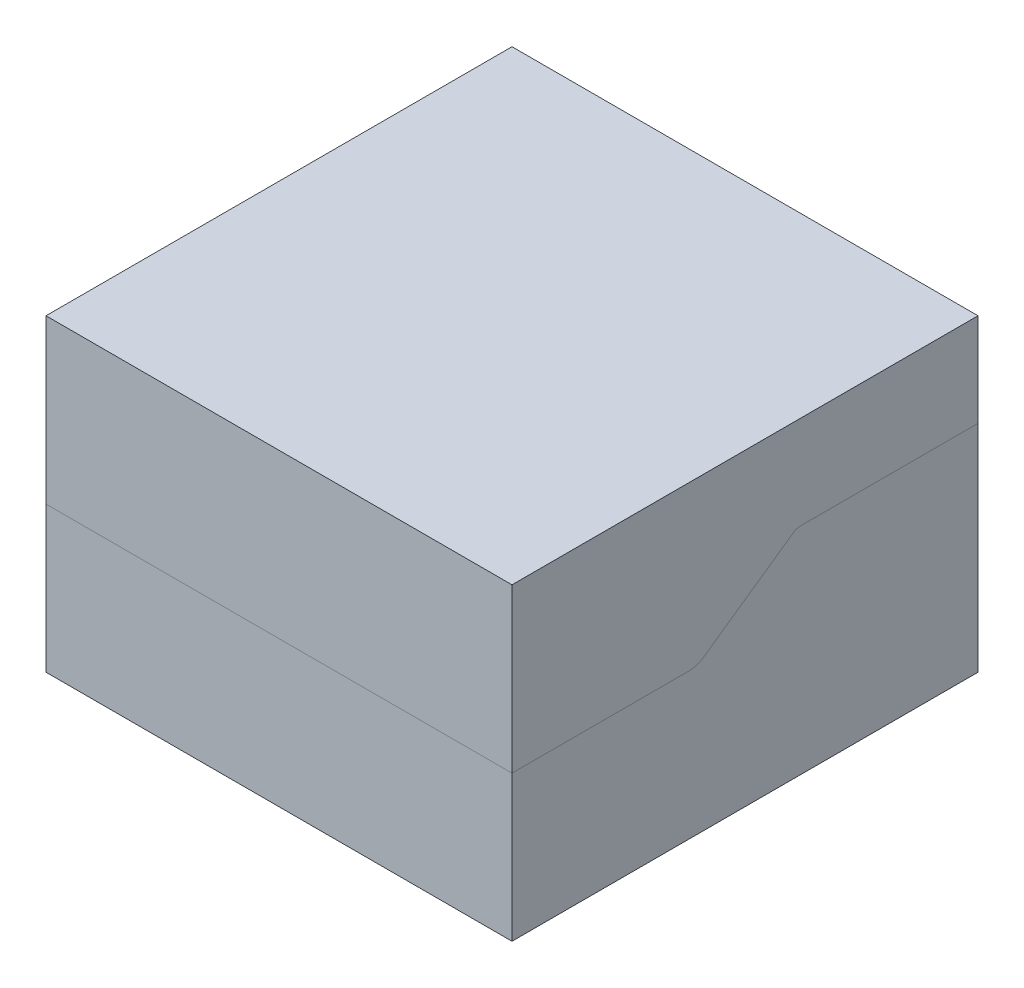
ISO-10303-21;
HEADER;
FILE_DESCRIPTION(('STEP AP214'),'2;1');
FILE_NAME('part.step','',(''),(''),'','','');
FILE_SCHEMA(('AUTOMOTIVE_DESIGN { 1 0 10303 214 1 1 1 1 }'));
ENDSEC;
DATA;
#1=APPLICATION_CONTEXT('core data for automotive mechanical design processes');
#2=APPLICATION_PROTOCOL_DEFINITION('international standard','automotive_design',2000,#1);
#3=PRODUCT_CONTEXT('',#1,'mechanical');
#4=PRODUCT('Part','Part','',(#3));
#5=PRODUCT_RELATED_PRODUCT_CATEGORY('part','',(#4));
#6=PRODUCT_DEFINITION_FORMATION('','',#4);
#7=PRODUCT_DEFINITION_CONTEXT('part definition',#1,'design');
#8=PRODUCT_DEFINITION('design','',#6,#7);
#9=PRODUCT_DEFINITION_SHAPE('','',#8);
#10=(LENGTH_UNIT() NAMED_UNIT(*) SI_UNIT(.MILLI.,.METRE.));
#11=(NAMED_UNIT(*) PLANE_ANGLE_UNIT() SI_UNIT($,.RADIAN.));
#12=(NAMED_UNIT(*) SI_UNIT($,.STERADIAN.) SOLID_ANGLE_UNIT());
#13=UNCERTAINTY_MEASURE_WITH_UNIT(LENGTH_MEASURE(1.E-05),#10,'distance_accuracy_value','');
#14=(GEOMETRIC_REPRESENTATION_CONTEXT(3) GLOBAL_UNCERTAINTY_ASSIGNED_CONTEXT((#13)) GLOBAL_UNIT_ASSIGNED_CONTEXT((#10,
#11,#12)) REPRESENTATION_CONTEXT('',''));
#15=CARTESIAN_POINT('',(0.,0.,0.));
#16=DIRECTION('',(0.,0.,1.));
#17=DIRECTION('',(1.,0.,0.));
#18=AXIS2_PLACEMENT_3D('',#15,#16,#17);
#19=CARTESIAN_POINT('',(-127.,92.075,-127.));
#20=DIRECTION('',(-1.,0.,0.));
#21=DIRECTION('',(0.,0.,1.));
#22=AXIS2_PLACEMENT_3D('',#19,#20,#21);
#23=PLANE('',#22);
#24=CARTESIAN_POINT('',(-127.,41.275,-79.375));
#25=CARTESIAN_POINT('',(-127.,41.2750000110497,-95.25));
#26=CARTESIAN_POINT('',(-127.,41.2750000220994,-111.125));
#27=CARTESIAN_POINT('',(-127.,41.275000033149,-127.));
#28=B_SPLINE_CURVE_WITH_KNOTS('',3,(#24,#25,#26,#27),.UNSPECIFIED.,.F.,.F.,(4,4),(0.,
47.6250000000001),.UNSPECIFIED.);
#29=CARTESIAN_POINT('',(-127.,41.275,-79.375));
#30=VERTEX_POINT('',#29);
#31=CARTESIAN_POINT('',(-127.,41.2750000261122,-127.));
#32=VERTEX_POINT('',#31);
#33=EDGE_CURVE('E1098',#30,#32,#28,.T.);
#34=ORIENTED_EDGE('',*,*,#33,.F.);
#35=DIRECTION('',(0.,0.,-1.));
#36=VECTOR('',#35,1.);
#37=CARTESIAN_POINT('',(-127.,41.275,-127.));
#38=LINE('',#37,#36);
#39=CARTESIAN_POINT('',(-127.,41.275,-30.2094404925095));
#40=VERTEX_POINT('',#39);
#41=EDGE_CURVE('E981',#40,#30,#38,.T.);
#42=ORIENTED_EDGE('',*,*,#41,.F.);
#43=CARTESIAN_POINT('',(-127.,40.1266142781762,-26.5672307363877));
#44=CARTESIAN_POINT('',(-127.,40.1504463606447,-26.6022380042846));
#45=CARTESIAN_POINT('',(-127.,40.1741602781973,-26.637328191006));
#46=CARTESIAN_POINT('',(-127.,40.2211988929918,-26.7077776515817));
#47=CARTESIAN_POINT('',(-127.,40.2445235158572,-26.7431369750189));
#48=CARTESIAN_POINT('',(-127.,40.2906262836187,-26.8142221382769));
#49=CARTESIAN_POINT('',(-127.,40.3134043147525,-26.8499480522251));
#50=CARTESIAN_POINT('',(-127.,40.35822106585,-26.9218580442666));
#51=CARTESIAN_POINT('',(-127.,40.3802598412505,-26.9580420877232));
#52=CARTESIAN_POINT('',(-127.,40.4234966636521,-27.0308510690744));
#53=CARTESIAN_POINT('',(-127.,40.4446956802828,-27.0674754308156));
#54=CARTESIAN_POINT('',(-127.,40.4862933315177,-27.1411768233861));
#55=CARTESIAN_POINT('',(-127.,40.5066919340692,-27.1782538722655));
#56=CARTESIAN_POINT('',(-127.,40.566671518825,-27.290125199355));
#57=CARTESIAN_POINT('',(-127.,40.6050436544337,-27.3655720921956));
#58=CARTESIAN_POINT('',(-127.,40.6786061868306,-27.5181449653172));
#59=CARTESIAN_POINT('',(-127.,40.7137914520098,-27.5952734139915));
#60=CARTESIAN_POINT('',(-127.,40.7809110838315,-27.7509322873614));
#61=CARTESIAN_POINT('',(-127.,40.8128453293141,-27.8294627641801));
#62=CARTESIAN_POINT('',(-127.,40.9038213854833,-28.0670269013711));
#63=CARTESIAN_POINT('',(-127.,40.9579924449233,-28.2279414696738));
#64=CARTESIAN_POINT('',(-127.,41.093221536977,-28.6892325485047));
#65=CARTESIAN_POINT('',(-127.,41.15909205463,-28.994132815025));
#66=CARTESIAN_POINT('',(-127.,41.2486430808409,-29.610364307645));
#67=CARTESIAN_POINT('',(-127.,41.2722895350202,-29.9217005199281));
#68=CARTESIAN_POINT('',(-127.,41.2753009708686,-30.2327753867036));
#69=B_SPLINE_CURVE_WITH_KNOTS('',3,(#43,#44,#45,#46,#47,#48,#49,#50,#51,#52,#53,#54,#55,#56,#57,
#58,#59,#60,#61,#62,#63,#64,#65,#66,#67,#68),.UNSPECIFIED.,.F.,.F.,(4,2,2,2,2,2,2,2,2,2,2,2,4),
(0.,0.127051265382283,0.254126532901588,0.381228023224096,0.508319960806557,0.635260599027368,
0.762206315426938,1.01605441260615,1.27030425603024,1.52456357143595,2.03338670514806,
2.96602466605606,3.89941447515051),.UNSPECIFIED.);
#70=CARTESIAN_POINT('',(-127.,40.1266142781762,-26.5672307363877));
#71=VERTEX_POINT('',#70);
#72=EDGE_CURVE('E1081',#71,#40,#69,.T.);
#73=ORIENTED_EDGE('',*,*,#72,.F.);
#74=DIRECTION('',(0.,0.573576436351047,-0.819152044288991));
#75=VECTOR('',#74,1.);
#76=CARTESIAN_POINT('',(-127.,104.405077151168,-118.366387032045));
#77=LINE('',#76,#75);
#78=CARTESIAN_POINT('',(-127.,5.47176903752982,22.9250197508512));
#79=VERTEX_POINT('',#78);
#80=EDGE_CURVE('E1071',#79,#71,#77,.T.);
#81=ORIENTED_EDGE('',*,*,#80,.F.);
#82=CARTESIAN_POINT('',(-127.,3.1750007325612,30.2094405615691));
#83=CARTESIAN_POINT('',(-127.,3.17579449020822,30.1264987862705));
#84=CARTESIAN_POINT('',(-127.,3.17684415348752,30.0435530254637));
#85=CARTESIAN_POINT('',(-127.,3.17995455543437,29.8776710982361));
#86=CARTESIAN_POINT('',(-127.,3.18201542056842,29.7947349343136));
#87=CARTESIAN_POINT('',(-127.,3.18764781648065,29.6289024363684));
#88=CARTESIAN_POINT('',(-127.,3.19121949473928,29.5460061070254));
#89=CARTESIAN_POINT('',(-127.,3.20011228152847,29.3803113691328));
#90=CARTESIAN_POINT('',(-127.,3.20543330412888,29.2975129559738));
#91=CARTESIAN_POINT('',(-127.,3.21776142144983,29.1320951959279));
#92=CARTESIAN_POINT('',(-127.,3.22476743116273,29.0494757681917));
#93=CARTESIAN_POINT('',(-127.,3.24046985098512,28.8843966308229));
#94=CARTESIAN_POINT('',(-127.,3.24916630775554,28.8019369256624));
#95=CARTESIAN_POINT('',(-127.,3.27776922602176,28.5548589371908));
#96=CARTESIAN_POINT('',(-127.,3.30019051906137,28.3905245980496));
#97=CARTESIAN_POINT('',(-127.,3.35167762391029,28.0627156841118));
#98=CARTESIAN_POINT('',(-127.,3.38075091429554,27.8992422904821));
#99=CARTESIAN_POINT('',(-127.,3.44543206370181,27.573592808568));
#100=CARTESIAN_POINT('',(-127.,3.48103994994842,27.4114167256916));
#101=CARTESIAN_POINT('',(-127.,3.55871117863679,27.088537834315));
#102=CARTESIAN_POINT('',(-127.,3.60077742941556,26.9278357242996));
#103=CARTESIAN_POINT('',(-127.,3.6912519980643,26.6082251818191));
#104=CARTESIAN_POINT('',(-127.,3.73966086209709,26.4493169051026));
#105=CARTESIAN_POINT('',(-127.,3.88868887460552,25.9927037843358));
#106=CARTESIAN_POINT('',(-127.,3.99737665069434,25.6975696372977));
#107=CARTESIAN_POINT('',(-127.,4.17664199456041,25.2615755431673));
#108=CARTESIAN_POINT('',(-127.,4.23912534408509,25.1173168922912));
#109=CARTESIAN_POINT('',(-127.,4.36941746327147,24.8312202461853));
#110=CARTESIAN_POINT('',(-127.,4.43722596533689,24.6893821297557));
#111=CARTESIAN_POINT('',(-127.,4.57826708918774,24.4080276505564));
#112=CARTESIAN_POINT('',(-127.,4.65151174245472,24.2685173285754));
#113=CARTESIAN_POINT('',(-127.,4.80303005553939,23.9922448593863));
#114=CARTESIAN_POINT('',(-127.,4.88130406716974,23.8554829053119));
#115=CARTESIAN_POINT('',(-127.,5.04246013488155,23.584810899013));
#116=CARTESIAN_POINT('',(-127.,5.12533958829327,23.450899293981));
#117=CARTESIAN_POINT('',(-127.,5.29540425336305,23.1858708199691));
#118=CARTESIAN_POINT('',(-127.,5.38258868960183,23.0547534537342));
#119=CARTESIAN_POINT('',(-127.,5.47176949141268,22.9250200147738));
#120=B_SPLINE_CURVE_WITH_KNOTS('',3,(#82,#83,#84,#85,#86,#87,#88,#89,#90,#91,#92,#93,#94,#95,
#96,#97,#98,#99,#100,#101,#102,#103,#104,#105,#106,#107,#108,#109,#110,#111,#112,#113,#114,#115,
#116,#117,#118,#119),.UNSPECIFIED.,.F.,.F.,(4,2,2,2,2,2,2,2,2,2,2,2,2,2,2,2,2,2,4),(0.,
0.248846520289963,0.497724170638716,0.746626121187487,0.995515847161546,1.24424573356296,
1.4929824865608,1.99040433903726,2.48838819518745,2.98637412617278,3.48458497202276,
3.98283874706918,4.9253269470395,5.39687328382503,5.86839593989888,6.34099523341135,
6.81362762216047,7.28599557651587,7.75827875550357),.UNSPECIFIED.);
#121=CARTESIAN_POINT('',(-127.,3.1750007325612,30.2094405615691));
#122=VERTEX_POINT('',#121);
#123=EDGE_CURVE('E1082',#122,#79,#120,.T.);
#124=ORIENTED_EDGE('',*,*,#123,.F.);
#125=DIRECTION('',(0.,0.,-1.));
#126=VECTOR('',#125,1.);
#127=CARTESIAN_POINT('',(-127.,3.175,-127.));
#128=LINE('',#127,#126);
#129=CARTESIAN_POINT('',(-127.,3.175,79.375));
#130=VERTEX_POINT('',#129);
#131=EDGE_CURVE('E1602',#130,#122,#128,.T.);
#132=ORIENTED_EDGE('',*,*,#131,.F.);
#133=CARTESIAN_POINT('',(-127.,3.17500000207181,127.));
#134=CARTESIAN_POINT('',(-127.,3.17500000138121,111.125));
#135=CARTESIAN_POINT('',(-127.,3.1750000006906,95.25));
#136=CARTESIAN_POINT('',(-127.,3.175,79.375));
#137=B_SPLINE_CURVE_WITH_KNOTS('',3,(#133,#134,#135,#136),.UNSPECIFIED.,.F.,.F.,(4,4),(0.,
47.625),.UNSPECIFIED.);
#138=CARTESIAN_POINT('',(-127.,3.17500000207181,127.));
#139=VERTEX_POINT('',#138);
#140=EDGE_CURVE('E1224',#139,#130,#137,.T.);
#141=ORIENTED_EDGE('',*,*,#140,.F.);
#142=DIRECTION('',(0.,-1.,0.));
#143=VECTOR('',#142,1.);
#144=CARTESIAN_POINT('',(-127.,92.075,127.));
#145=LINE('',#144,#143);
#146=CARTESIAN_POINT('',(-127.,92.075,127.));
#147=VERTEX_POINT('',#146);
#148=EDGE_CURVE('E1595',#147,#139,#145,.T.);
#149=ORIENTED_EDGE('',*,*,#148,.F.);
#150=DIRECTION('',(0.,0.,-1.));
#151=VECTOR('',#150,1.);
#152=CARTESIAN_POINT('',(-127.,92.075,-127.));
#153=LINE('',#152,#151);
#154=CARTESIAN_POINT('',(-127.,92.075,-127.));
#155=VERTEX_POINT('',#154);
#156=EDGE_CURVE('E1591',#147,#155,#153,.T.);
#157=ORIENTED_EDGE('',*,*,#156,.T.);
#158=DIRECTION('',(0.,-1.,0.));
#159=VECTOR('',#158,1.);
#160=CARTESIAN_POINT('',(-127.,92.075,-127.));
#161=LINE('',#160,#159);
#162=EDGE_CURVE('E1551',#155,#32,#161,.T.);
#163=ORIENTED_EDGE('',*,*,#162,.T.);
#164=EDGE_LOOP('',(#34,#42,#73,#81,#124,#132,#141,#149,#157,#163));
#165=FACE_BOUND('',#164,.T.);
#166=ADVANCED_FACE('F977',(#165),#23,.T.);
#167=CARTESIAN_POINT('',(-127.,92.075,127.));
#168=DIRECTION('',(0.,0.,1.));
#169=DIRECTION('',(1.,0.,0.));
#170=AXIS2_PLACEMENT_3D('',#167,#168,#169);
#171=PLANE('',#170);
#172=CARTESIAN_POINT('',(127.,3.17500000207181,127.));
#173=CARTESIAN_POINT('',(105.404972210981,3.17500000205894,127.));
#174=CARTESIAN_POINT('',(83.8099444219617,3.17500000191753,127.));
#175=CARTESIAN_POINT('',(51.417402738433,3.17500000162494,127.));
#176=CARTESIAN_POINT('',(40.6198888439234,3.175000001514,127.));
#177=CARTESIAN_POINT('',(24.423618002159,3.17500000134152,127.));
#178=CARTESIAN_POINT('',(19.0248610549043,3.17500000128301,127.));
#179=CARTESIAN_POINT('',(8.22734716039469,3.17500000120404,127.));
#180=CARTESIAN_POINT('',(2.8285902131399,3.17500000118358,127.));
#181=CARTESIAN_POINT('',(-7.96892368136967,3.17500000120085,127.));
#182=CARTESIAN_POINT('',(-13.3676806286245,3.17500000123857,127.));
#183=CARTESIAN_POINT('',(-29.5639514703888,3.1750000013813,127.));
#184=CARTESIAN_POINT('',(-40.3614653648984,3.17500000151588,127.));
#185=CARTESIAN_POINT('',(-63.79914938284,3.17500000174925,127.));
#186=CARTESIAN_POINT('',(-76.439319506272,3.17500000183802,127.));
#187=CARTESIAN_POINT('',(-101.719659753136,3.17500000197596,127.));
#188=CARTESIAN_POINT('',(-114.359829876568,3.17500000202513,127.));
#189=CARTESIAN_POINT('',(-127.,3.17500000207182,127.));
#190=B_SPLINE_CURVE_WITH_KNOTS('',3,(#172,#173,#174,#175,#176,#177,#178,#179,#180,#181,#182,
#183,#184,#185,#186,#187,#188,#189),.UNSPECIFIED.,.F.,.F.,(4,2,2,2,2,2,2,2,4),(0.,
64.7850833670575,97.1776250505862,113.373895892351,129.570166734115,145.766437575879,
178.158979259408,216.079489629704,254.),.UNSPECIFIED.);
#191=CARTESIAN_POINT('',(127.,3.17500000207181,127.));
#192=VERTEX_POINT('',#191);
#193=EDGE_CURVE('E1217',#192,#139,#190,.T.);
#194=ORIENTED_EDGE('',*,*,#193,.F.);
#195=DIRECTION('',(0.,-1.,0.));
#196=VECTOR('',#195,1.);
#197=CARTESIAN_POINT('',(127.,92.075,127.));
#198=LINE('',#197,#196);
#199=CARTESIAN_POINT('',(127.,92.075,127.));
#200=VERTEX_POINT('',#199);
#201=EDGE_CURVE('E1584',#200,#192,#198,.T.);
#202=ORIENTED_EDGE('',*,*,#201,.F.);
#203=DIRECTION('',(-1.,0.,0.));
#204=VECTOR('',#203,1.);
#205=CARTESIAN_POINT('',(-127.,92.075,127.));
#206=LINE('',#205,#204);
#207=EDGE_CURVE('E1589',#200,#147,#206,.T.);
#208=ORIENTED_EDGE('',*,*,#207,.T.);
#209=ORIENTED_EDGE('',*,*,#148,.T.);
#210=EDGE_LOOP('',(#194,#202,#208,#209));
#211=FACE_BOUND('',#210,.T.);
#212=ADVANCED_FACE('F1198',(#211),#171,.T.);
#213=CARTESIAN_POINT('',(127.,92.075,-127.));
#214=DIRECTION('',(1.,0.,0.));
#215=DIRECTION('',(0.,0.,-1.));
#216=AXIS2_PLACEMENT_3D('',#213,#214,#215);
#217=PLANE('',#216);
#218=CARTESIAN_POINT('',(127.,41.275000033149,-127.));
#219=CARTESIAN_POINT('',(127.,41.2750000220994,-111.125));
#220=CARTESIAN_POINT('',(127.,41.2750000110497,-95.25));
#221=CARTESIAN_POINT('',(127.,41.275,-79.3749999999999));
#222=B_SPLINE_CURVE_WITH_KNOTS('',3,(#218,#219,#220,#221),.UNSPECIFIED.,.F.,.F.,(4,4),(0.,
47.6250000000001),.UNSPECIFIED.);
#223=CARTESIAN_POINT('',(127.,41.275000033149,-127.));
#224=VERTEX_POINT('',#223);
#225=CARTESIAN_POINT('',(127.,41.275,-79.375));
#226=VERTEX_POINT('',#225);
#227=EDGE_CURVE('E1225',#224,#226,#222,.T.);
#228=ORIENTED_EDGE('',*,*,#227,.F.);
#229=DIRECTION('',(0.,-1.,0.));
#230=VECTOR('',#229,1.);
#231=CARTESIAN_POINT('',(127.,92.075,-127.));
#232=LINE('',#231,#230);
#233=CARTESIAN_POINT('',(127.,92.075,-127.));
#234=VERTEX_POINT('',#233);
#235=EDGE_CURVE('E1568',#234,#224,#232,.T.);
#236=ORIENTED_EDGE('',*,*,#235,.F.);
#237=DIRECTION('',(0.,0.,1.));
#238=VECTOR('',#237,1.);
#239=CARTESIAN_POINT('',(127.,92.075,-127.));
#240=LINE('',#239,#238);
#241=EDGE_CURVE('E1582',#234,#200,#240,.T.);
#242=ORIENTED_EDGE('',*,*,#241,.T.);
#243=ORIENTED_EDGE('',*,*,#201,.T.);
#244=CARTESIAN_POINT('',(127.,3.175,79.375));
#245=CARTESIAN_POINT('',(127.,3.17500000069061,95.25));
#246=CARTESIAN_POINT('',(127.,3.17500000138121,111.125));
#247=CARTESIAN_POINT('',(127.,3.17500000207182,127.));
#248=B_SPLINE_CURVE_WITH_KNOTS('',3,(#244,#245,#246,#247),.UNSPECIFIED.,.F.,.F.,(4,4),(0.,
47.6249999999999),.UNSPECIFIED.);
#249=CARTESIAN_POINT('',(127.,3.175,79.375));
#250=VERTEX_POINT('',#249);
#251=EDGE_CURVE('E1255',#250,#192,#248,.T.);
#252=ORIENTED_EDGE('',*,*,#251,.F.);
#253=DIRECTION('',(0.,0.,1.));
#254=VECTOR('',#253,1.);
#255=CARTESIAN_POINT('',(127.,3.175,-127.));
#256=LINE('',#255,#254);
#257=CARTESIAN_POINT('',(127.,3.17500052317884,30.2094405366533));
#258=VERTEX_POINT('',#257);
#259=EDGE_CURVE('E1262',#258,#250,#256,.T.);
#260=ORIENTED_EDGE('',*,*,#259,.F.);
#261=CARTESIAN_POINT('',(127.,5.47176967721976,22.9250201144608));
#262=CARTESIAN_POINT('',(127.,5.42484643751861,22.9934173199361));
#263=CARTESIAN_POINT('',(127.,5.37813053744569,23.0619645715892));
#264=CARTESIAN_POINT('',(127.,5.28553246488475,23.1996311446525));
#265=CARTESIAN_POINT('',(127.,5.23965039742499,23.2687505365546));
#266=CARTESIAN_POINT('',(127.,5.14914657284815,23.4078231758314));
#267=CARTESIAN_POINT('',(127.,5.10452493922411,23.4777765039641));
#268=CARTESIAN_POINT('',(127.,5.01677088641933,23.6186063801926));
#269=CARTESIAN_POINT('',(127.,4.97363839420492,23.6894828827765));
#270=CARTESIAN_POINT('',(127.,4.88885726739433,23.8320562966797));
#271=CARTESIAN_POINT('',(127.,4.84720769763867,23.9037526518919));
#272=CARTESIAN_POINT('',(127.,4.76538486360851,24.0479841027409));
#273=CARTESIAN_POINT('',(127.,4.7252116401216,24.1205192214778));
#274=CARTESIAN_POINT('',(127.,4.60692366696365,24.3393196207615));
#275=CARTESIAN_POINT('',(127.,4.53103181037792,24.486794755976));
#276=CARTESIAN_POINT('',(127.,4.38518410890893,24.7848518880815));
#277=CARTESIAN_POINT('',(127.,4.31523506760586,24.9354372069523));
#278=CARTESIAN_POINT('',(127.,4.1814338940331,25.2392932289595));
#279=CARTESIAN_POINT('',(127.,4.11758178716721,25.3925639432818));
#280=CARTESIAN_POINT('',(127.,3.99601060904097,25.7016012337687));
#281=CARTESIAN_POINT('',(127.,3.93829432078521,25.8573689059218));
#282=CARTESIAN_POINT('',(127.,3.82908567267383,26.1710726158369));
#283=CARTESIAN_POINT('',(127.,3.77759384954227,26.3290088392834));
#284=CARTESIAN_POINT('',(127.,3.63776792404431,26.7885233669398));
#285=CARTESIAN_POINT('',(127.,3.55751774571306,27.0926238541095));
#286=CARTESIAN_POINT('',(127.,3.45428737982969,27.5525916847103));
#287=CARTESIAN_POINT('',(127.,3.42272738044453,27.7066004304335));
#288=CARTESIAN_POINT('',(127.,3.36535814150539,28.0156895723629));
#289=CARTESIAN_POINT('',(127.,3.33954861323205,28.1707699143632));
#290=CARTESIAN_POINT('',(127.,3.29370443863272,28.4821398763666));
#291=CARTESIAN_POINT('',(127.,3.27368311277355,28.6384314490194));
#292=CARTESIAN_POINT('',(127.,3.23933627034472,28.9516479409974));
#293=CARTESIAN_POINT('',(127.,3.22501115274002,29.1085729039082));
#294=CARTESIAN_POINT('',(127.,3.20177139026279,29.4227297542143));
#295=CARTESIAN_POINT('',(127.,3.19285372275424,29.5799614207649));
#296=CARTESIAN_POINT('',(127.,3.18014845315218,29.8946051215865));
#297=CARTESIAN_POINT('',(127.,3.1763599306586,30.0520171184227));
#298=CARTESIAN_POINT('',(127.,3.17500052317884,30.2094405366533));
#299=B_SPLINE_CURVE_WITH_KNOTS('',3,(#261,#262,#263,#264,#265,#266,#267,#268,#269,#270,#271,
#272,#273,#274,#275,#276,#277,#278,#279,#280,#281,#282,#283,#284,#285,#286,#287,#288,#289,#290,
#291,#292,#293,#294,#295,#296,#297,#298),.UNSPECIFIED.,.F.,.F.,(4,2,2,2,2,2,2,2,2,2,2,2,2,2,2,2,
2,2,4),(0.,0.248846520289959,0.497724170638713,0.746626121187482,0.995515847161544,
1.24424573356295,1.49298248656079,1.99040433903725,2.48838819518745,2.98637412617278,
3.48458497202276,3.98283874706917,4.92532694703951,5.39687328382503,5.86839593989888,
6.34099523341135,6.81362762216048,7.28599557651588,7.75827875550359),.UNSPECIFIED.);
#300=CARTESIAN_POINT('',(127.,5.47176903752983,22.9250197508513));
#301=VERTEX_POINT('',#300);
#302=EDGE_CURVE('E1261',#301,#258,#299,.T.);
#303=ORIENTED_EDGE('',*,*,#302,.F.);
#304=DIRECTION('',(0.,-0.573576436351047,0.819152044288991));
#305=VECTOR('',#304,1.);
#306=CARTESIAN_POINT('',(127.,104.405077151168,-118.366387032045));
#307=LINE('',#306,#305);
#308=CARTESIAN_POINT('',(127.,40.1266143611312,-26.5672306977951));
#309=VERTEX_POINT('',#308);
#310=EDGE_CURVE('E1268',#309,#301,#307,.T.);
#311=ORIENTED_EDGE('',*,*,#310,.F.);
#312=CARTESIAN_POINT('',(127.,41.2753063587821,-30.2327755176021));
#313=CARTESIAN_POINT('',(127.,41.2747894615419,-30.1904423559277));
#314=CARTESIAN_POINT('',(127.,41.2741509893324,-30.1481088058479));
#315=CARTESIAN_POINT('',(127.,41.2724403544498,-30.0634425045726));
#316=CARTESIAN_POINT('',(127.,41.2713681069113,-30.0211097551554));
#317=CARTESIAN_POINT('',(127.,41.2685990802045,-29.9364523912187));
#318=CARTESIAN_POINT('',(127.,41.2669021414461,-29.8941277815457));
#319=CARTESIAN_POINT('',(127.,41.2626782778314,-29.8095229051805));
#320=CARTESIAN_POINT('',(127.,41.260151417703,-29.767242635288));
#321=CARTESIAN_POINT('',(127.,41.251162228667,-29.6405971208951));
#322=CARTESIAN_POINT('',(127.,41.2432886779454,-29.5563276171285));
#323=CARTESIAN_POINT('',(127.,41.2239125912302,-29.3882214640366));
#324=CARTESIAN_POINT('',(127.,41.212410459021,-29.3043847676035));
#325=CARTESIAN_POINT('',(127.,41.185822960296,-29.1371229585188));
#326=CARTESIAN_POINT('',(127.,41.1707310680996,-29.0536988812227));
#327=CARTESIAN_POINT('',(127.,41.1370721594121,-28.8875548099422));
#328=CARTESIAN_POINT('',(127.,41.1185049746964,-28.804834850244));
#329=CARTESIAN_POINT('',(127.,41.0577056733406,-28.557816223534));
#330=CARTESIAN_POINT('',(127.,41.0103909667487,-28.3947531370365));
#331=CARTESIAN_POINT('',(127.,40.858243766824,-27.9387404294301));
#332=CARTESIAN_POINT('',(127.,40.7383311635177,-27.650750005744));
#333=CARTESIAN_POINT('',(127.,40.4601146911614,-27.0935655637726));
#334=CARTESIAN_POINT('',(127.,40.3017754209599,-26.8243891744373));
#335=CARTESIAN_POINT('',(127.,40.1266143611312,-26.5672306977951));
#336=B_SPLINE_CURVE_WITH_KNOTS('',3,(#312,#313,#314,#315,#316,#317,#318,#319,#320,#321,#322,
#323,#324,#325,#326,#327,#328,#329,#330,#331,#332,#333,#334,#335),.UNSPECIFIED.,.F.,.F.,(4,2,2,
2,2,2,2,2,2,2,2,4),(0.,0.127011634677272,0.254048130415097,0.381117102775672,0.508176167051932,
0.761995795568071,1.01578718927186,1.27004351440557,1.52431215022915,2.0331351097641,
2.96583271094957,3.89939285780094),.UNSPECIFIED.);
#337=CARTESIAN_POINT('',(127.,41.275,-30.2094404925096));
#338=VERTEX_POINT('',#337);
#339=EDGE_CURVE('E1270',#338,#309,#336,.T.);
#340=ORIENTED_EDGE('',*,*,#339,.F.);
#341=DIRECTION('',(0.,0.,1.));
#342=VECTOR('',#341,1.);
#343=CARTESIAN_POINT('',(127.,41.275,-127.));
#344=LINE('',#343,#342);
#345=EDGE_CURVE('E1276',#226,#338,#344,.T.);
#346=ORIENTED_EDGE('',*,*,#345,.F.);
#347=EDGE_LOOP('',(#228,#236,#242,#243,#252,#260,#303,#311,#340,#346));
#348=FACE_BOUND('',#347,.T.);
#349=ADVANCED_FACE('F1202',(#348),#217,.T.);
#350=CARTESIAN_POINT('',(-127.,92.075,-127.));
#351=DIRECTION('',(0.,0.,-1.));
#352=DIRECTION('',(-1.,0.,0.));
#353=AXIS2_PLACEMENT_3D('',#350,#351,#352);
#354=PLANE('',#353);
#355=CARTESIAN_POINT('',(-127.,41.275000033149,-127.));
#356=CARTESIAN_POINT('',(-105.404972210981,41.2750000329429,-127.));
#357=CARTESIAN_POINT('',(-83.8099444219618,41.2750000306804,-127.));
#358=CARTESIAN_POINT('',(-51.417402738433,41.2750000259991,-127.));
#359=CARTESIAN_POINT('',(-40.6198888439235,41.2750000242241,-127.));
#360=CARTESIAN_POINT('',(-24.4236180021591,41.2750000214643,-127.));
#361=CARTESIAN_POINT('',(-19.0248610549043,41.2750000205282,-127.));
#362=CARTESIAN_POINT('',(-8.22734716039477,41.2750000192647,-127.));
#363=CARTESIAN_POINT('',(-2.82859021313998,41.2750000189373,-127.));
#364=CARTESIAN_POINT('',(7.96892368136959,41.2750000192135,-127.));
#365=CARTESIAN_POINT('',(13.3676806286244,41.2750000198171,-127.));
#366=CARTESIAN_POINT('',(29.5639514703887,41.2750000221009,-127.));
#367=CARTESIAN_POINT('',(40.3614653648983,41.2750000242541,-127.));
#368=CARTESIAN_POINT('',(63.7991493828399,41.275000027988,-127.));
#369=CARTESIAN_POINT('',(76.4393195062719,41.2750000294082,-127.));
#370=CARTESIAN_POINT('',(101.719659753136,41.2750000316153,-127.));
#371=CARTESIAN_POINT('',(114.359829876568,41.2750000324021,-127.));
#372=CARTESIAN_POINT('',(127.,41.2750000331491,-127.));
#373=B_SPLINE_CURVE_WITH_KNOTS('',3,(#355,#356,#357,#358,#359,#360,#361,#362,#363,#364,#365,
#366,#367,#368,#369,#370,#371,#372),.UNSPECIFIED.,.F.,.F.,(4,2,2,2,2,2,2,2,4),(0.,
64.7850833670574,97.1776250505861,113.37389589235,129.570166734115,145.766437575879,
178.158979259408,216.079489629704,254.),.UNSPECIFIED.);
#374=EDGE_CURVE('E1545',#32,#224,#373,.T.);
#375=ORIENTED_EDGE('',*,*,#374,.F.);
#376=ORIENTED_EDGE('',*,*,#162,.F.);
#377=DIRECTION('',(1.,0.,0.));
#378=VECTOR('',#377,1.);
#379=CARTESIAN_POINT('',(-127.,92.075,-127.));
#380=LINE('',#379,#378);
#381=EDGE_CURVE('E1586',#155,#234,#380,.T.);
#382=ORIENTED_EDGE('',*,*,#381,.T.);
#383=ORIENTED_EDGE('',*,*,#235,.T.);
#384=EDGE_LOOP('',(#375,#376,#382,#383));
#385=FACE_BOUND('',#384,.T.);
#386=ADVANCED_FACE('F1208',(#385),#354,.T.);
#387=CARTESIAN_POINT('',(-127.,92.075,127.));
#388=DIRECTION('',(0.,1.,0.));
#389=DIRECTION('',(0.,0.,1.));
#390=AXIS2_PLACEMENT_3D('',#387,#388,#389);
#391=PLANE('',#390);
#392=ORIENTED_EDGE('',*,*,#156,.F.);
#393=ORIENTED_EDGE('',*,*,#207,.F.);
#394=ORIENTED_EDGE('',*,*,#241,.F.);
#395=ORIENTED_EDGE('',*,*,#381,.F.);
#396=EDGE_LOOP('',(#392,#393,#394,#395));
#397=FACE_BOUND('',#396,.T.);
#398=ADVANCED_FACE('F1183',(#397),#391,.T.);
#399=CARTESIAN_POINT('',(0.,44.45,-30.2094404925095));
#400=DIRECTION('',(0.,-1.,0.));
#401=DIRECTION('',(0.,0.,-1.));
#402=AXIS2_PLACEMENT_3D('',#399,#400,#401);
#403=PLANE('',#402);
#404=DIRECTION('',(0.,0.,-1.));
#405=VECTOR('',#404,1.);
#406=CARTESIAN_POINT('',(22.225,44.45,-30.2094404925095));
#407=LINE('',#406,#405);
#408=CARTESIAN_POINT('',(22.225,44.45,-30.2094404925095));
#409=VERTEX_POINT('',#408);
#410=CARTESIAN_POINT('',(22.225,44.45,-79.375));
#411=VERTEX_POINT('',#410);
#412=EDGE_CURVE('E1356',#409,#411,#407,.T.);
#413=ORIENTED_EDGE('',*,*,#412,.F.);
#414=DIRECTION('',(1.,0.,0.));
#415=VECTOR('',#414,1.);
#416=CARTESIAN_POINT('',(0.,44.45,-30.2094404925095));
#417=LINE('',#416,#415);
#418=CARTESIAN_POINT('',(-22.225,44.45,-30.2094404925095));
#419=VERTEX_POINT('',#418);
#420=EDGE_CURVE('E1475',#419,#409,#417,.T.);
#421=ORIENTED_EDGE('',*,*,#420,.F.);
#422=DIRECTION('',(0.,0.,-1.));
#423=VECTOR('',#422,1.);
#424=CARTESIAN_POINT('',(-22.225,44.45,-30.2094404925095));
#425=LINE('',#424,#423);
#426=CARTESIAN_POINT('',(-22.225,44.45,-79.375));
#427=VERTEX_POINT('',#426);
#428=EDGE_CURVE('E1440',#419,#427,#425,.T.);
#429=ORIENTED_EDGE('',*,*,#428,.T.);
#430=CARTESIAN_POINT('',(0.,44.45,-79.375));
#431=DIRECTION('',(0.,-1.,0.));
#432=DIRECTION('',(0.,0.,-1.));
#433=AXIS2_PLACEMENT_3D('',#430,#431,#432);
#434=CIRCLE('',#433,22.225);
#435=EDGE_CURVE('E1359',#427,#411,#434,.T.);
#436=ORIENTED_EDGE('',*,*,#435,.T.);
#437=EDGE_LOOP('',(#413,#421,#429,#436));
#438=FACE_BOUND('',#437,.T.);
#439=ADVANCED_FACE('F1180',(#438),#403,.T.);
#440=CARTESIAN_POINT('',(0.,34.925,-30.2094404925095));
#441=DIRECTION('',(1.,0.,0.));
#442=DIRECTION('',(0.,0.,-1.));
#443=AXIS2_PLACEMENT_3D('',#440,#441,#442);
#444=CYLINDRICAL_SURFACE('',#443,9.525);
#445=CARTESIAN_POINT('',(22.225,34.925,-30.2094404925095));
#446=DIRECTION('',(-1.,0.,0.));
#447=DIRECTION('',(0.,0.,-1.));
#448=AXIS2_PLACEMENT_3D('',#445,#446,#447);
#449=CIRCLE('',#448,9.525);
#450=CARTESIAN_POINT('',(22.225,42.7274232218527,-24.7461249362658));
#451=VERTEX_POINT('',#450);
#452=EDGE_CURVE('E1474',#451,#409,#449,.T.);
#453=ORIENTED_EDGE('',*,*,#452,.F.);
#454=DIRECTION('',(1.,0.,0.));
#455=VECTOR('',#454,1.);
#456=CARTESIAN_POINT('',(0.,42.7274232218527,-24.7461249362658));
#457=LINE('',#456,#455);
#458=CARTESIAN_POINT('',(-22.225,42.7274232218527,-24.7461249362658));
#459=VERTEX_POINT('',#458);
#460=EDGE_CURVE('E1471',#459,#451,#457,.T.);
#461=ORIENTED_EDGE('',*,*,#460,.F.);
#462=CARTESIAN_POINT('',(-22.225,34.925,-30.2094404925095));
#463=DIRECTION('',(-1.,0.,0.));
#464=DIRECTION('',(0.,0.,-1.));
#465=AXIS2_PLACEMENT_3D('',#462,#463,#464);
#466=CIRCLE('',#465,9.525);
#467=EDGE_CURVE('E1432',#459,#419,#466,.T.);
#468=ORIENTED_EDGE('',*,*,#467,.T.);
#469=ORIENTED_EDGE('',*,*,#420,.T.);
#470=EDGE_LOOP('',(#453,#461,#468,#469));
#471=FACE_BOUND('',#470,.T.);
#472=ADVANCED_FACE('F1176',(#471),#444,.F.);
#473=CARTESIAN_POINT('',(0.,8.07257677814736,24.7461249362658));
#474=DIRECTION('',(0.,-0.819152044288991,-0.573576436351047));
#475=DIRECTION('',(0.,0.573576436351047,-0.819152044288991));
#476=AXIS2_PLACEMENT_3D('',#473,#474,#475);
#477=PLANE('',#476);
#478=DIRECTION('',(0.,0.573576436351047,-0.819152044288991));
#479=VECTOR('',#478,1.);
#480=CARTESIAN_POINT('',(22.225,8.07257677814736,24.7461249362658));
#481=LINE('',#480,#479);
#482=CARTESIAN_POINT('',(22.225,8.07257677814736,24.7461249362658));
#483=VERTEX_POINT('',#482);
#484=EDGE_CURVE('E1470',#483,#451,#481,.T.);
#485=ORIENTED_EDGE('',*,*,#484,.F.);
#486=DIRECTION('',(1.,0.,0.));
#487=VECTOR('',#486,1.);
#488=CARTESIAN_POINT('',(0.,8.07257677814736,24.7461249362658));
#489=LINE('',#488,#487);
#490=CARTESIAN_POINT('',(-22.225,8.07257677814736,24.7461249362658));
#491=VERTEX_POINT('',#490);
#492=EDGE_CURVE('E1467',#491,#483,#489,.T.);
#493=ORIENTED_EDGE('',*,*,#492,.F.);
#494=DIRECTION('',(0.,0.573576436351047,-0.819152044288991));
#495=VECTOR('',#494,1.);
#496=CARTESIAN_POINT('',(-22.225,8.07257677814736,24.7461249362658));
#497=LINE('',#496,#495);
#498=EDGE_CURVE('E1427',#491,#459,#497,.T.);
#499=ORIENTED_EDGE('',*,*,#498,.T.);
#500=ORIENTED_EDGE('',*,*,#460,.T.);
#501=EDGE_LOOP('',(#485,#493,#499,#500));
#502=FACE_BOUND('',#501,.T.);
#503=ADVANCED_FACE('F1172',(#502),#477,.T.);
#504=CARTESIAN_POINT('',(0.,15.875,30.2094404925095));
#505=DIRECTION('',(1.,0.,0.));
#506=DIRECTION('',(0.,0.,-1.));
#507=AXIS2_PLACEMENT_3D('',#504,#505,#506);
#508=CYLINDRICAL_SURFACE('',#507,9.525);
#509=CARTESIAN_POINT('',(22.225,15.875,30.2094404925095));
#510=DIRECTION('',(1.,0.,0.));
#511=DIRECTION('',(0.,0.,-1.));
#512=AXIS2_PLACEMENT_3D('',#509,#510,#511);
#513=CIRCLE('',#512,9.525);
#514=CARTESIAN_POINT('',(22.225,6.35,30.2094404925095));
#515=VERTEX_POINT('',#514);
#516=EDGE_CURVE('E1466',#515,#483,#513,.T.);
#517=ORIENTED_EDGE('',*,*,#516,.F.);
#518=DIRECTION('',(1.,0.,0.));
#519=VECTOR('',#518,1.);
#520=CARTESIAN_POINT('',(0.,6.35,30.2094404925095));
#521=LINE('',#520,#519);
#522=CARTESIAN_POINT('',(-22.225,6.35,30.2094404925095));
#523=VERTEX_POINT('',#522);
#524=EDGE_CURVE('E1463',#523,#515,#521,.T.);
#525=ORIENTED_EDGE('',*,*,#524,.F.);
#526=CARTESIAN_POINT('',(-22.225,15.875,30.2094404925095));
#527=DIRECTION('',(1.,0.,0.));
#528=DIRECTION('',(0.,0.,-1.));
#529=AXIS2_PLACEMENT_3D('',#526,#527,#528);
#530=CIRCLE('',#529,9.525);
#531=EDGE_CURVE('E1420',#523,#491,#530,.T.);
#532=ORIENTED_EDGE('',*,*,#531,.T.);
#533=ORIENTED_EDGE('',*,*,#492,.T.);
#534=EDGE_LOOP('',(#517,#525,#532,#533));
#535=FACE_BOUND('',#534,.T.);
#536=ADVANCED_FACE('F1168',(#535),#508,.T.);
#537=CARTESIAN_POINT('',(-22.225,6.35,79.375));
#538=DIRECTION('',(0.,-1.,0.));
#539=DIRECTION('',(1.,0.,0.));
#540=AXIS2_PLACEMENT_3D('',#537,#538,#539);
#541=PLANE('',#540);
#542=CARTESIAN_POINT('',(0.,6.35,79.375));
#543=DIRECTION('',(0.,1.,0.));
#544=DIRECTION('',(0.,0.,1.));
#545=AXIS2_PLACEMENT_3D('',#542,#543,#544);
#546=CIRCLE('',#545,22.225);
#547=CARTESIAN_POINT('',(22.225,6.35,79.375));
#548=VERTEX_POINT('',#547);
#549=CARTESIAN_POINT('',(-22.225,6.35,79.375));
#550=VERTEX_POINT('',#549);
#551=EDGE_CURVE('E1459',#548,#550,#546,.F.);
#552=ORIENTED_EDGE('',*,*,#551,.T.);
#553=DIRECTION('',(0.,0.,-1.));
#554=VECTOR('',#553,1.);
#555=CARTESIAN_POINT('',(-22.225,6.35,79.375));
#556=LINE('',#555,#554);
#557=EDGE_CURVE('E1421',#550,#523,#556,.T.);
#558=ORIENTED_EDGE('',*,*,#557,.T.);
#559=ORIENTED_EDGE('',*,*,#524,.T.);
#560=DIRECTION('',(0.,0.,-1.));
#561=VECTOR('',#560,1.);
#562=CARTESIAN_POINT('',(22.225,6.35,79.375));
#563=LINE('',#562,#561);
#564=EDGE_CURVE('E1462',#548,#515,#563,.T.);
#565=ORIENTED_EDGE('',*,*,#564,.F.);
#566=EDGE_LOOP('',(#552,#558,#559,#565));
#567=FACE_BOUND('',#566,.T.);
#568=ADVANCED_FACE('F1164',(#567),#541,.T.);
#569=CARTESIAN_POINT('',(0.,3.175,79.375));
#570=DIRECTION('',(0.,1.,0.));
#571=DIRECTION('',(0.,0.,1.));
#572=AXIS2_PLACEMENT_3D('',#569,#570,#571);
#573=TOROIDAL_SURFACE('',#572,22.225,3.175);
#574=CARTESIAN_POINT('',(0.,3.175,79.375));
#575=DIRECTION('',(0.,1.,0.));
#576=DIRECTION('',(0.,0.,1.));
#577=AXIS2_PLACEMENT_3D('',#574,#575,#576);
#578=CIRCLE('',#577,25.4);
#579=CARTESIAN_POINT('',(25.4,3.175,79.375));
#580=VERTEX_POINT('',#579);
#581=CARTESIAN_POINT('',(-25.4,3.175,79.375));
#582=VERTEX_POINT('',#581);
#583=EDGE_CURVE('E988',#580,#582,#578,.F.);
#584=ORIENTED_EDGE('',*,*,#583,.T.);
#585=CARTESIAN_POINT('',(-22.225,3.175,79.375));
#586=DIRECTION('',(0.,0.,1.));
#587=DIRECTION('',(1.,0.,0.));
#588=AXIS2_PLACEMENT_3D('',#585,#586,#587);
#589=CIRCLE('',#588,3.175);
#590=EDGE_CURVE('E1409',#550,#582,#589,.T.);
#591=ORIENTED_EDGE('',*,*,#590,.F.);
#592=ORIENTED_EDGE('',*,*,#551,.F.);
#593=CARTESIAN_POINT('',(22.225,3.175,79.375));
#594=DIRECTION('',(0.,0.,-1.));
#595=DIRECTION('',(-1.,0.,0.));
#596=AXIS2_PLACEMENT_3D('',#593,#594,#595);
#597=CIRCLE('',#596,3.175);
#598=EDGE_CURVE('E1389',#548,#580,#597,.T.);
#599=ORIENTED_EDGE('',*,*,#598,.T.);
#600=EDGE_LOOP('',(#584,#591,#592,#599));
#601=FACE_BOUND('',#600,.T.);
#602=ADVANCED_FACE('F1160',(#601),#573,.F.);
#603=CARTESIAN_POINT('',(-22.225,3.175,79.375));
#604=DIRECTION('',(0.,0.,-1.));
#605=DIRECTION('',(0.,1.,0.));
#606=AXIS2_PLACEMENT_3D('',#603,#604,#605);
#607=CYLINDRICAL_SURFACE('',#606,3.175);
#608=DIRECTION('',(0.,0.,-1.));
#609=VECTOR('',#608,1.);
#610=CARTESIAN_POINT('',(-25.4,3.175,79.375));
#611=LINE('',#610,#609);
#612=CARTESIAN_POINT('',(-25.4,3.175,30.2094404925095));
#613=VERTEX_POINT('',#612);
#614=EDGE_CURVE('E1414',#582,#613,#611,.T.);
#615=ORIENTED_EDGE('',*,*,#614,.T.);
#616=CARTESIAN_POINT('',(-22.225,3.175,30.2094404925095));
#617=DIRECTION('',(0.,0.,1.));
#618=DIRECTION('',(1.,0.,0.));
#619=AXIS2_PLACEMENT_3D('',#616,#617,#618);
#620=CIRCLE('',#619,3.175);
#621=EDGE_CURVE('E1417',#523,#613,#620,.T.);
#622=ORIENTED_EDGE('',*,*,#621,.F.);
#623=ORIENTED_EDGE('',*,*,#557,.F.);
#624=ORIENTED_EDGE('',*,*,#590,.T.);
#625=EDGE_LOOP('',(#615,#622,#623,#624));
#626=FACE_BOUND('',#625,.T.);
#627=ADVANCED_FACE('F1156',(#626),#607,.F.);
#628=CARTESIAN_POINT('',(-22.225,15.875,30.2094404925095));
#629=DIRECTION('',(1.,0.,0.));
#630=DIRECTION('',(0.,0.,-1.));
#631=AXIS2_PLACEMENT_3D('',#628,#629,#630);
#632=TOROIDAL_SURFACE('',#631,12.7,3.175);
#633=CARTESIAN_POINT('',(-25.4,3.175,30.2094404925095));
#634=CARTESIAN_POINT('',(-25.3999999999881,3.17495950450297,29.8574440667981));
#635=CARTESIAN_POINT('',(-25.3999999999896,3.18962633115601,29.5054509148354));
#636=CARTESIAN_POINT('',(-25.3999999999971,3.24810121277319,28.8040403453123));
#637=CARTESIAN_POINT('',(-25.400000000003,3.29189713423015,28.4546219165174));
#638=CARTESIAN_POINT('',(-25.399999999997,3.40836019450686,27.7606150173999));
#639=CARTESIAN_POINT('',(-25.3999999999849,3.4810288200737,27.4160267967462));
#640=CARTESIAN_POINT('',(-25.3999999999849,3.65475050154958,26.7339510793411));
#641=CARTESIAN_POINT('',(-25.3999999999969,3.75581241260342,26.3964658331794));
#642=CARTESIAN_POINT('',(-25.4000000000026,3.96674063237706,25.7856777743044));
#643=CARTESIAN_POINT('',(-25.399999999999,4.07244318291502,25.5109279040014));
#644=CARTESIAN_POINT('',(-25.3999999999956,4.30270357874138,24.9693506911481));
#645=CARTESIAN_POINT('',(-25.3999999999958,4.42726627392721,24.7025254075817));
#646=CARTESIAN_POINT('',(-25.3999999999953,4.6949264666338,24.1776000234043));
#647=CARTESIAN_POINT('',(-25.3999999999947,4.83806423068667,23.9195204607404));
#648=CARTESIAN_POINT('',(-25.3999999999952,5.1419127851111,23.4139994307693));
#649=CARTESIAN_POINT('',(-25.3999999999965,5.30261972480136,23.166555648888));
#650=CARTESIAN_POINT('',(-25.4,5.47176903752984,22.9250197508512));
#651=B_SPLINE_CURVE_WITH_KNOTS('',3,(#633,#634,#635,#636,#637,#638,#639,#640,#641,#642,#643,
#644,#645,#646,#647,#648,#649,#650),.UNSPECIFIED.,.F.,.F.,(4,2,2,2,2,2,2,2,4),(0.,
1.05567979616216,2.11092013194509,3.16621481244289,4.22183897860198,5.10429861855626,
5.98698557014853,6.87161898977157,7.75605890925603),.UNSPECIFIED.);
#652=CARTESIAN_POINT('',(-25.4,5.47176903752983,22.9250197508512));
#653=VERTEX_POINT('',#652);
#654=EDGE_CURVE('E1132',#613,#653,#651,.T.);
#655=ORIENTED_EDGE('',*,*,#654,.T.);
#656=CARTESIAN_POINT('',(-22.225,5.47176903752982,22.9250197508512));
#657=DIRECTION('',(0.,-0.573576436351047,0.819152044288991));
#658=DIRECTION('',(1.,0.,0.));
#659=AXIS2_PLACEMENT_3D('',#656,#657,#658);
#660=CIRCLE('',#659,3.175);
#661=EDGE_CURVE('E1424',#491,#653,#660,.T.);
#662=ORIENTED_EDGE('',*,*,#661,.F.);
#663=ORIENTED_EDGE('',*,*,#531,.F.);
#664=ORIENTED_EDGE('',*,*,#621,.T.);
#665=EDGE_LOOP('',(#655,#662,#663,#664));
#666=FACE_BOUND('',#665,.T.);
#667=ADVANCED_FACE('F1151',(#666),#632,.F.);
#668=CARTESIAN_POINT('',(-22.225,5.47176903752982,22.9250197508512));
#669=DIRECTION('',(0.,0.573576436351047,-0.819152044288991));
#670=DIRECTION('',(0.,0.819152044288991,0.573576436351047));
#671=AXIS2_PLACEMENT_3D('',#668,#669,#670);
#672=CYLINDRICAL_SURFACE('',#671,3.175);
#673=DIRECTION('',(0.,0.573576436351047,-0.819152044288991));
#674=VECTOR('',#673,1.);
#675=CARTESIAN_POINT('',(-25.4,5.47176903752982,22.9250197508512));
#676=LINE('',#675,#674);
#677=CARTESIAN_POINT('',(-25.4,40.1266154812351,-26.5672301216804));
#678=VERTEX_POINT('',#677);
#679=EDGE_CURVE('E1303',#653,#678,#676,.T.);
#680=ORIENTED_EDGE('',*,*,#679,.T.);
#681=CARTESIAN_POINT('',(-22.225,40.1266154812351,-26.5672301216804));
#682=DIRECTION('',(0.,-0.573576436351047,0.819152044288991));
#683=DIRECTION('',(1.,0.,0.));
#684=AXIS2_PLACEMENT_3D('',#681,#682,#683);
#685=CIRCLE('',#684,3.175);
#686=EDGE_CURVE('E1430',#459,#678,#685,.T.);
#687=ORIENTED_EDGE('',*,*,#686,.F.);
#688=ORIENTED_EDGE('',*,*,#498,.F.);
#689=ORIENTED_EDGE('',*,*,#661,.T.);
#690=EDGE_LOOP('',(#680,#687,#688,#689));
#691=FACE_BOUND('',#690,.T.);
#692=ADVANCED_FACE('F1147',(#691),#672,.F.);
#693=CARTESIAN_POINT('',(-22.225,34.925,-30.2094404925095));
#694=DIRECTION('',(-1.,0.,0.));
#695=DIRECTION('',(0.,0.,1.));
#696=AXIS2_PLACEMENT_3D('',#693,#694,#695);
#697=TOROIDAL_SURFACE('',#696,6.35,3.175);
#698=CARTESIAN_POINT('',(-25.4,40.1266154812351,-26.5672301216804));
#699=CARTESIAN_POINT('',(-25.4000000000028,40.2275804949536,-26.7113878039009));
#700=CARTESIAN_POINT('',(-25.4000000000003,40.3225208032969,-26.859762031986));
#701=CARTESIAN_POINT('',(-25.3999999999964,40.4997271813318,-27.1638128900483));
#702=CARTESIAN_POINT('',(-25.3999999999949,40.5819985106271,-27.3194864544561));
#703=CARTESIAN_POINT('',(-25.4000000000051,40.7333310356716,-27.6371352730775));
#704=CARTESIAN_POINT('',(-25.4000000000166,40.8023915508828,-27.7991108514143));
#705=CARTESIAN_POINT('',(-25.3999999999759,40.926850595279,-28.1282940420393));
#706=CARTESIAN_POINT('',(-25.3999999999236,40.9822448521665,-28.2955032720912));
#707=CARTESIAN_POINT('',(-25.4000000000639,41.0710205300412,-28.6061591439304));
#708=CARTESIAN_POINT('',(-25.4000000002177,41.1065223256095,-28.7490043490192));
#709=CARTESIAN_POINT('',(-25.4000000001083,41.1675311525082,-29.0368573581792));
#710=CARTESIAN_POINT('',(-25.3999999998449,41.1930356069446,-29.1818657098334));
#711=CARTESIAN_POINT('',(-25.4000000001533,41.2339508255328,-29.4736243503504));
#712=CARTESIAN_POINT('',(-25.4000000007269,41.2493392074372,-29.6203777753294));
#713=CARTESIAN_POINT('',(-25.4000000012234,41.2698676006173,-29.9145672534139));
#714=CARTESIAN_POINT('',(-25.4000000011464,41.2750098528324,-30.0620031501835));
#715=CARTESIAN_POINT('',(-25.4,41.275,-30.2094404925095));
#716=B_SPLINE_CURVE_WITH_KNOTS('',3,(#698,#699,#700,#701,#702,#703,#704,#705,#706,#707,#708,
#709,#710,#711,#712,#713,#714,#715),.UNSPECIFIED.,.F.,.F.,(4,2,2,2,2,2,2,2,4),(0.,
0.52783989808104,1.05546006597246,1.58310740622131,2.11091948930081,2.55214930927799,
2.99349278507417,3.43580949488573,3.87802945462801),.UNSPECIFIED.);
#717=CARTESIAN_POINT('',(-25.4,41.275,-30.2094404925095));
#718=VERTEX_POINT('',#717);
#719=EDGE_CURVE('E1090',#678,#718,#716,.T.);
#720=ORIENTED_EDGE('',*,*,#719,.T.);
#721=CARTESIAN_POINT('',(-22.225,41.275,-30.2094404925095));
#722=DIRECTION('',(0.,0.,1.));
#723=DIRECTION('',(1.,0.,0.));
#724=AXIS2_PLACEMENT_3D('',#721,#722,#723);
#725=CIRCLE('',#724,3.175);
#726=EDGE_CURVE('E1437',#419,#718,#725,.T.);
#727=ORIENTED_EDGE('',*,*,#726,.F.);
#728=ORIENTED_EDGE('',*,*,#467,.F.);
#729=ORIENTED_EDGE('',*,*,#686,.T.);
#730=EDGE_LOOP('',(#720,#727,#728,#729));
#731=FACE_BOUND('',#730,.T.);
#732=ADVANCED_FACE('F1141',(#731),#697,.F.);
#733=CARTESIAN_POINT('',(-22.225,41.275,-30.2094404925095));
#734=DIRECTION('',(0.,0.,-1.));
#735=DIRECTION('',(-1.,0.,0.));
#736=AXIS2_PLACEMENT_3D('',#733,#734,#735);
#737=CYLINDRICAL_SURFACE('',#736,3.175);
#738=DIRECTION('',(0.,0.,-1.));
#739=VECTOR('',#738,1.);
#740=CARTESIAN_POINT('',(-25.4,41.275,-30.2094404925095));
#741=LINE('',#740,#739);
#742=CARTESIAN_POINT('',(-25.4,41.275,-79.375));
#743=VERTEX_POINT('',#742);
#744=EDGE_CURVE('E1433',#718,#743,#741,.T.);
#745=ORIENTED_EDGE('',*,*,#744,.T.);
#746=CARTESIAN_POINT('',(-22.225,41.275,-79.375));
#747=DIRECTION('',(0.,0.,1.));
#748=DIRECTION('',(1.,0.,0.));
#749=AXIS2_PLACEMENT_3D('',#746,#747,#748);
#750=CIRCLE('',#749,3.175);
#751=EDGE_CURVE('E1336',#427,#743,#750,.T.);
#752=ORIENTED_EDGE('',*,*,#751,.F.);
#753=ORIENTED_EDGE('',*,*,#428,.F.);
#754=ORIENTED_EDGE('',*,*,#726,.T.);
#755=EDGE_LOOP('',(#745,#752,#753,#754));
#756=FACE_BOUND('',#755,.T.);
#757=ADVANCED_FACE('F1146',(#756),#737,.F.);
#758=CARTESIAN_POINT('',(0.,41.275,-79.375));
#759=DIRECTION('',(0.,-1.,0.));
#760=DIRECTION('',(0.,0.,-1.));
#761=AXIS2_PLACEMENT_3D('',#758,#759,#760);
#762=TOROIDAL_SURFACE('',#761,22.225,3.175);
#763=CARTESIAN_POINT('',(0.,41.275,-79.375));
#764=DIRECTION('',(0.,-1.,0.));
#765=DIRECTION('',(0.,0.,-1.));
#766=AXIS2_PLACEMENT_3D('',#763,#764,#765);
#767=CIRCLE('',#766,25.4);
#768=CARTESIAN_POINT('',(25.4,41.275,-79.375));
#769=VERTEX_POINT('',#768);
#770=EDGE_CURVE('E1139',#743,#769,#767,.T.);
#771=ORIENTED_EDGE('',*,*,#770,.T.);
#772=CARTESIAN_POINT('',(22.225,41.275,-79.375));
#773=DIRECTION('',(0.,0.,-1.));
#774=DIRECTION('',(-1.,0.,0.));
#775=AXIS2_PLACEMENT_3D('',#772,#773,#774);
#776=CIRCLE('',#775,3.175);
#777=EDGE_CURVE('E1333',#411,#769,#776,.T.);
#778=ORIENTED_EDGE('',*,*,#777,.F.);
#779=ORIENTED_EDGE('',*,*,#435,.F.);
#780=ORIENTED_EDGE('',*,*,#751,.T.);
#781=EDGE_LOOP('',(#771,#778,#779,#780));
#782=FACE_BOUND('',#781,.T.);
#783=ADVANCED_FACE('F1318',(#782),#762,.F.);
#784=CARTESIAN_POINT('',(22.225,41.275,-79.375));
#785=DIRECTION('',(0.,0.,1.));
#786=DIRECTION('',(1.,0.,0.));
#787=AXIS2_PLACEMENT_3D('',#784,#785,#786);
#788=CYLINDRICAL_SURFACE('',#787,3.175);
#789=DIRECTION('',(0.,0.,1.));
#790=VECTOR('',#789,1.);
#791=CARTESIAN_POINT('',(25.4,41.275,-79.375));
#792=LINE('',#791,#790);
#793=CARTESIAN_POINT('',(25.4,41.275,-30.2094404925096));
#794=VERTEX_POINT('',#793);
#795=EDGE_CURVE('E1131',#769,#794,#792,.T.);
#796=ORIENTED_EDGE('',*,*,#795,.T.);
#797=CARTESIAN_POINT('',(22.225,41.275,-30.2094404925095));
#798=DIRECTION('',(0.,0.,-1.));
#799=DIRECTION('',(-1.,0.,0.));
#800=AXIS2_PLACEMENT_3D('',#797,#798,#799);
#801=CIRCLE('',#800,3.175);
#802=EDGE_CURVE('E1358',#409,#794,#801,.T.);
#803=ORIENTED_EDGE('',*,*,#802,.F.);
#804=ORIENTED_EDGE('',*,*,#412,.T.);
#805=ORIENTED_EDGE('',*,*,#777,.T.);
#806=EDGE_LOOP('',(#796,#803,#804,#805));
#807=FACE_BOUND('',#806,.T.);
#808=ADVANCED_FACE('F1315',(#807),#788,.F.);
#809=CARTESIAN_POINT('',(22.225,34.925,-30.2094404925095));
#810=DIRECTION('',(1.,0.,0.));
#811=DIRECTION('',(0.,0.,-1.));
#812=AXIS2_PLACEMENT_3D('',#809,#810,#811);
#813=TOROIDAL_SURFACE('',#812,6.35,3.175);
#814=CARTESIAN_POINT('',(25.4,41.275,-30.2094404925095));
#815=CARTESIAN_POINT('',(25.4000000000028,41.2750202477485,-30.0334422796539));
#816=CARTESIAN_POINT('',(25.4000000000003,41.267686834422,-29.8574457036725));
#817=CARTESIAN_POINT('',(25.3999999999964,41.2384493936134,-29.506740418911));
#818=CARTESIAN_POINT('',(25.3999999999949,41.2165514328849,-29.3320312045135));
#819=CARTESIAN_POINT('',(25.4000000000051,41.1583199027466,-28.9850277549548));
#820=CARTESIAN_POINT('',(25.4000000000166,41.1219855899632,-28.8127336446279));
#821=CARTESIAN_POINT('',(25.3999999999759,41.0351247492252,-28.4716957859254));
#822=CARTESIAN_POINT('',(25.3999999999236,40.9845937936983,-28.3029531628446));
#823=CARTESIAN_POINT('',(25.4000000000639,40.8791296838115,-27.9975591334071));
#824=CARTESIAN_POINT('',(25.4000000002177,40.8262784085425,-27.8601841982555));
#825=CARTESIAN_POINT('',(25.4000000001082,40.7111482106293,-27.5893955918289));
#826=CARTESIAN_POINT('',(25.3999999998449,40.6488668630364,-27.4559829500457));
#827=CARTESIAN_POINT('',(25.4000000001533,40.5150367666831,-27.1935202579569));
#828=CARTESIAN_POINT('',(25.4000000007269,40.4434678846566,-27.064480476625));
#829=CARTESIAN_POINT('',(25.4000000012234,40.2915436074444,-26.8117199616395));
#830=CARTESIAN_POINT('',(25.4000000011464,40.2111901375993,-26.6879980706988));
#831=CARTESIAN_POINT('',(25.4,40.1266154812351,-26.5672301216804));
#832=B_SPLINE_CURVE_WITH_KNOTS('',3,(#814,#815,#816,#817,#818,#819,#820,#821,#822,#823,#824,
#825,#826,#827,#828,#829,#830,#831),.UNSPECIFIED.,.F.,.F.,(4,2,2,2,2,2,2,2,4),(0.,
0.527839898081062,1.05546006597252,1.5831074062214,2.11091948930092,2.55214930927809,
2.99349278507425,3.4358094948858,3.87802945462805),.UNSPECIFIED.);
#833=CARTESIAN_POINT('',(25.4,40.1266154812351,-26.5672301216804));
#834=VERTEX_POINT('',#833);
#835=EDGE_CURVE('E1295',#794,#834,#832,.T.);
#836=ORIENTED_EDGE('',*,*,#835,.T.);
#837=CARTESIAN_POINT('',(22.225,40.1266154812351,-26.5672301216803));
#838=DIRECTION('',(0.,0.573576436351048,-0.819152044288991));
#839=DIRECTION('',(-1.,0.,0.));
#840=AXIS2_PLACEMENT_3D('',#837,#838,#839);
#841=CIRCLE('',#840,3.175);
#842=EDGE_CURVE('E1362',#451,#834,#841,.T.);
#843=ORIENTED_EDGE('',*,*,#842,.F.);
#844=ORIENTED_EDGE('',*,*,#452,.T.);
#845=ORIENTED_EDGE('',*,*,#802,.T.);
#846=EDGE_LOOP('',(#836,#843,#844,#845));
#847=FACE_BOUND('',#846,.T.);
#848=ADVANCED_FACE('F1309',(#847),#813,.F.);
#849=CARTESIAN_POINT('',(22.225,40.1266154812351,-26.5672301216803));
#850=DIRECTION('',(0.,-0.573576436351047,0.819152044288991));
#851=DIRECTION('',(0.,-0.819152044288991,-0.573576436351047));
#852=AXIS2_PLACEMENT_3D('',#849,#850,#851);
#853=CYLINDRICAL_SURFACE('',#852,3.175);
#854=DIRECTION('',(0.,-0.573576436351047,0.819152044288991));
#855=VECTOR('',#854,1.);
#856=CARTESIAN_POINT('',(25.4,40.1266154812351,-26.5672301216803));
#857=LINE('',#856,#855);
#858=CARTESIAN_POINT('',(25.4,5.47176903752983,22.9250197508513));
#859=VERTEX_POINT('',#858);
#860=EDGE_CURVE('E1369',#834,#859,#857,.T.);
#861=ORIENTED_EDGE('',*,*,#860,.T.);
#862=CARTESIAN_POINT('',(22.225,5.47176903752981,22.9250197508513));
#863=DIRECTION('',(0.,0.573576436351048,-0.819152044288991));
#864=DIRECTION('',(-1.,0.,0.));
#865=AXIS2_PLACEMENT_3D('',#862,#863,#864);
#866=CIRCLE('',#865,3.175);
#867=EDGE_CURVE('E1375',#483,#859,#866,.T.);
#868=ORIENTED_EDGE('',*,*,#867,.F.);
#869=ORIENTED_EDGE('',*,*,#484,.T.);
#870=ORIENTED_EDGE('',*,*,#842,.T.);
#871=EDGE_LOOP('',(#861,#868,#869,#870));
#872=FACE_BOUND('',#871,.T.);
#873=ADVANCED_FACE('F1314',(#872),#853,.F.);
#874=CARTESIAN_POINT('',(22.225,15.875,30.2094404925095));
#875=DIRECTION('',(-1.,0.,0.));
#876=DIRECTION('',(0.,0.,1.));
#877=AXIS2_PLACEMENT_3D('',#874,#875,#876);
#878=TOROIDAL_SURFACE('',#877,12.7,3.175);
#879=CARTESIAN_POINT('',(25.4,5.47176903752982,22.9250197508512));
#880=CARTESIAN_POINT('',(25.3999999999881,5.26983901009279,23.2133351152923));
#881=CARTESIAN_POINT('',(25.3999999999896,5.07995839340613,23.5100835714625));
#882=CARTESIAN_POINT('',(25.3999999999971,4.72554563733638,24.1181852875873));
#883=CARTESIAN_POINT('',(25.400000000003,4.5610029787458,24.4295324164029));
#884=CARTESIAN_POINT('',(25.399999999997,4.25833792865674,25.0648300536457));
#885=CARTESIAN_POINT('',(25.399999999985,4.12021689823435,25.3887812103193));
#886=CARTESIAN_POINT('',(25.3999999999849,3.87129880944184,26.0471475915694));
#887=CARTESIAN_POINT('',(25.3999999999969,3.76051029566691,26.3815660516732));
#888=CARTESIAN_POINT('',(25.4000000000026,3.58295893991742,27.0028777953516));
#889=CARTESIAN_POINT('',(25.399999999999,3.51195534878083,27.2885682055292));
#890=CARTESIAN_POINT('',(25.3999999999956,3.38993769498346,27.8642742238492));
#891=CARTESIAN_POINT('',(25.3999999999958,3.3389287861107,28.1542909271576));
#892=CARTESIAN_POINT('',(25.3999999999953,3.25709834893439,28.7378082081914));
#893=CARTESIAN_POINT('',(25.3999999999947,3.22632158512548,29.0313150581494));
#894=CARTESIAN_POINT('',(25.3999999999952,3.18526479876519,29.6196940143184));
#895=CARTESIAN_POINT('',(25.3999999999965,3.17498029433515,29.9145658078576));
#896=CARTESIAN_POINT('',(25.4,3.175,30.2094404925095));
#897=B_SPLINE_CURVE_WITH_KNOTS('',3,(#879,#880,#881,#882,#883,#884,#885,#886,#887,#888,#889,
#890,#891,#892,#893,#894,#895,#896),.UNSPECIFIED.,.F.,.F.,(4,2,2,2,2,2,2,2,4),(0.,
1.05567979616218,2.11092013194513,3.16621481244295,4.22183897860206,5.10429861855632,
5.98698557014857,6.87161898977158,7.75605890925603),.UNSPECIFIED.);
#898=CARTESIAN_POINT('',(25.4,3.175,30.2094404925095));
#899=VERTEX_POINT('',#898);
#900=EDGE_CURVE('E1304',#859,#899,#897,.T.);
#901=ORIENTED_EDGE('',*,*,#900,.T.);
#902=CARTESIAN_POINT('',(22.225,3.175,30.2094404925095));
#903=DIRECTION('',(0.,0.,-1.));
#904=DIRECTION('',(-1.,0.,0.));
#905=AXIS2_PLACEMENT_3D('',#902,#903,#904);
#906=CIRCLE('',#905,3.175);
#907=EDGE_CURVE('E1386',#515,#899,#906,.T.);
#908=ORIENTED_EDGE('',*,*,#907,.F.);
#909=ORIENTED_EDGE('',*,*,#516,.T.);
#910=ORIENTED_EDGE('',*,*,#867,.T.);
#911=EDGE_LOOP('',(#901,#908,#909,#910));
#912=FACE_BOUND('',#911,.T.);
#913=ADVANCED_FACE('F1194',(#912),#878,.F.);
#914=CARTESIAN_POINT('',(22.225,3.175,30.2094404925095));
#915=DIRECTION('',(0.,0.,1.));
#916=DIRECTION('',(0.,-1.,0.));
#917=AXIS2_PLACEMENT_3D('',#914,#915,#916);
#918=CYLINDRICAL_SURFACE('',#917,3.175);
#919=DIRECTION('',(0.,0.,1.));
#920=VECTOR('',#919,1.);
#921=CARTESIAN_POINT('',(25.4,3.175,30.2094404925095));
#922=LINE('',#921,#920);
#923=EDGE_CURVE('E14',#899,#580,#922,.T.);
#924=ORIENTED_EDGE('',*,*,#923,.T.);
#925=ORIENTED_EDGE('',*,*,#598,.F.);
#926=ORIENTED_EDGE('',*,*,#564,.T.);
#927=ORIENTED_EDGE('',*,*,#907,.T.);
#928=EDGE_LOOP('',(#924,#925,#926,#927));
#929=FACE_BOUND('',#928,.T.);
#930=ADVANCED_FACE('F1187',(#929),#918,.F.);
#931=CARTESIAN_POINT('',(-25.4,41.275,-30.2094404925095));
#932=DIRECTION('',(0.,1.,0.));
#933=DIRECTION('',(0.,0.,-1.));
#934=AXIS2_PLACEMENT_3D('',#931,#932,#933);
#935=PLANE('',#934);
#936=ORIENTED_EDGE('',*,*,#41,.T.);
#937=DIRECTION('',(-1.,0.,0.));
#938=VECTOR('',#937,1.);
#939=CARTESIAN_POINT('',(-88.9,41.275,-79.375));
#940=LINE('',#939,#938);
#941=EDGE_CURVE('E1339',#743,#30,#940,.T.);
#942=ORIENTED_EDGE('',*,*,#941,.F.);
#943=ORIENTED_EDGE('',*,*,#744,.F.);
#944=DIRECTION('',(1.,0.,0.));
#945=VECTOR('',#944,1.);
#946=CARTESIAN_POINT('',(-88.9,41.275,-30.2094404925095));
#947=LINE('',#946,#945);
#948=EDGE_CURVE('E1436',#40,#718,#947,.T.);
#949=ORIENTED_EDGE('',*,*,#948,.F.);
#950=EDGE_LOOP('',(#936,#942,#943,#949));
#951=FACE_BOUND('',#950,.T.);
#952=ADVANCED_FACE('F1185',(#951),#935,.F.);
#953=CARTESIAN_POINT('',(-24.13,41.275,-79.375));
#954=CARTESIAN_POINT('',(-25.4,41.275,-79.375));
#955=CARTESIAN_POINT('',(-152.4,41.275,-79.375));
#956=CARTESIAN_POINT('',(-24.1300395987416,41.2749999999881,-79.6548721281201));
#957=CARTESIAN_POINT('',(-25.4,41.275,-79.668649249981));
#958=CARTESIAN_POINT('',(-152.39604012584,41.2750000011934,-81.0463614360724));
#959=CARTESIAN_POINT('',(-24.0873363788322,41.2749999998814,-82.1467206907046));
#960=CARTESIAN_POINT('',(-25.3553502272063,41.275,-82.2837792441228));
#961=CARTESIAN_POINT('',(-152.156735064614,41.275000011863,-95.9896345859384));
#962=CARTESIAN_POINT('',(-23.4604945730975,41.2749999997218,-85.7410198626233));
#963=CARTESIAN_POINT('',(-24.6982278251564,41.275,-86.0636817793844));
#964=CARTESIAN_POINT('',(-148.471553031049,41.2750000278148,-118.329873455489));
#965=CARTESIAN_POINT('',(-21.5305582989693,41.2749999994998,-90.6135820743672));
#966=CARTESIAN_POINT('',(-22.6686422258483,41.275,-91.1958608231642));
#967=CARTESIAN_POINT('',(-136.477034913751,41.2750000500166,-149.423735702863));
#968=CARTESIAN_POINT('',(-19.001337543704,41.274999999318,-94.5423806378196));
#969=CARTESIAN_POINT('',(-20.0047202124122,41.275,-95.3378780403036));
#970=CARTESIAN_POINT('',(-120.342987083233,41.2750000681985,-174.887618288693));
#971=CARTESIAN_POINT('',(-15.173335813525,41.2749999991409,-98.372185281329));
#972=CARTESIAN_POINT('',(-15.9691737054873,41.275,-99.3753318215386));
#973=CARTESIAN_POINT('',(-95.552962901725,41.2750000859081,-199.689985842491));
#974=CARTESIAN_POINT('',(-10.5905171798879,41.2749999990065,-101.323810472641));
#975=CARTESIAN_POINT('',(-11.1376379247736,41.275,-102.484164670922));
#976=CARTESIAN_POINT('',(-65.8497124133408,41.2750000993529,-218.519584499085));
#977=CARTESIAN_POINT('',(-5.33647350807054,41.2749999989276,-103.122479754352));
#978=CARTESIAN_POINT('',(-5.60474438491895,41.275,-104.374397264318));
#979=CARTESIAN_POINT('',(-32.4318320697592,41.2750001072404,-229.566148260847));
#980=CARTESIAN_POINT('',(-1.67178325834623,41.2749999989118,-103.504999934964));
#981=CARTESIAN_POINT('',(-1.75408944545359,41.275,-104.775));
#982=CARTESIAN_POINT('',(-9.98470815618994,41.2750001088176,-231.775006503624));
#983=CARTESIAN_POINT('',(1.66853284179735,41.2749999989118,-103.505000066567));
#984=CARTESIAN_POINT('',(1.75067870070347,41.275,-104.775));
#985=CARTESIAN_POINT('',(9.96526459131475,41.2750001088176,-231.774993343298));
#986=CARTESIAN_POINT('',(5.32709914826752,41.2749999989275,-103.123880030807));
#987=CARTESIAN_POINT('',(5.59488874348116,41.275,-104.375864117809));
#988=CARTESIAN_POINT('',(32.3738482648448,41.2750001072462,-229.574272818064));
#989=CARTESIAN_POINT('',(10.5723808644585,41.2749999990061,-101.331613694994));
#990=CARTESIAN_POINT('',(11.1185285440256,41.275,-102.492371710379));
#991=CARTESIAN_POINT('',(65.7332965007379,41.2750000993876,-218.568173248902));
#992=CARTESIAN_POINT('',(15.1576011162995,41.2749999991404,-98.3850273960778));
#993=CARTESIAN_POINT('',(15.9525808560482,41.275,-99.3888683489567));
#994=CARTESIAN_POINT('',(95.4505548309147,41.2750000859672,-199.772963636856));
#995=CARTESIAN_POINT('',(18.9898083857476,41.2749999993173,-94.5576676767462));
#996=CARTESIAN_POINT('',(19.9925709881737,41.275,-95.3539960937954));
#997=CARTESIAN_POINT('',(120.268831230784,41.2750000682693,-174.986837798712));
#998=CARTESIAN_POINT('',(21.5221607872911,41.2749999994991,-90.6286443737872));
#999=CARTESIAN_POINT('',(22.6598017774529,41.275,-91.2117375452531));
#1000=CARTESIAN_POINT('',(136.423900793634,41.2750000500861,-149.521054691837));
#1001=CARTESIAN_POINT('',(23.4449515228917,41.2749999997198,-85.7859540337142));
#1002=CARTESIAN_POINT('',(24.6818902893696,41.275,-86.1109978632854));
#1003=CARTESIAN_POINT('',(148.375766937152,41.2750000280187,-118.615380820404));
#1004=CARTESIAN_POINT('',(24.0638924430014,41.274999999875,-82.2907963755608));
#1005=CARTESIAN_POINT('',(25.3307757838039,41.275,-82.4352754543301));
#1006=CARTESIAN_POINT('',(152.019109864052,41.2750000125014,-96.8831833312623));
#1007=CARTESIAN_POINT('',(24.1279494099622,41.2749999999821,-79.7955307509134));
#1008=CARTESIAN_POINT('',(25.3978809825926,41.275,-79.8162614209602));
#1009=CARTESIAN_POINT('',(152.39103824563,41.2750000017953,-81.8893284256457));
#1010=CARTESIAN_POINT('',(24.1300224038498,41.2749999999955,-79.4802541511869));
#1011=CARTESIAN_POINT('',(25.4,41.275,-79.4854354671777));
#1012=CARTESIAN_POINT('',(152.397759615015,41.2750000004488,-80.0035670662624));
#1013=CARTESIAN_POINT('',(24.13,41.275,-79.375));
#1014=CARTESIAN_POINT('',(25.4,41.275,-79.375));
#1015=CARTESIAN_POINT('',(152.4,41.275,-79.3749999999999));
#1016=B_SPLINE_SURFACE_WITH_KNOTS('',3,1,((#953,#954,#955),(#956,#957,#958),(#959,#960,#961),
(#962,#963,#964),(#965,#966,#967),(#968,#969,#970),(#971,#972,#973),(#974,#975,#976),(#977,#978,
#979),(#980,#981,#982),(#983,#984,#985),(#986,#987,#988),(#989,#990,#991),(#992,#993,#994),
(#995,#996,#997),(#998,#999,#1000),(#1001,#1002,#1003),(#1004,#1005,#1006),(#1007,#1008,#1009),
(#1010,#1011,#1012),(#1013,#1014,#1015)),.UNSPECIFIED.,.F.,.F.,.F.,(4,1,1,1,1,1,1,1,2,1,1,1,1,1,
1,1,1,4),(2,1,2),(0.,0.0104735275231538,0.0936423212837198,0.140671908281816,0.218726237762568,
0.281118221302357,0.359348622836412,0.437437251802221,0.5,0.562441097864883,0.640409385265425,
0.718463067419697,0.781119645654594,0.859129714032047,0.906020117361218,0.988182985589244,
0.996061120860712,1.),(-0.01,0.,1.),.UNSPECIFIED.);
#1017=DIRECTION('',(1.,0.,0.));
#1018=VECTOR('',#1017,1.);
#1019=CARTESIAN_POINT('',(88.9,41.275,-79.375));
#1020=LINE('',#1019,#1018);
#1021=EDGE_CURVE('E1093',#769,#226,#1020,.T.);
#1022=ORIENTED_EDGE('',*,*,#33,.T.);
#1023=ORIENTED_EDGE('',*,*,#374,.T.);
#1024=ORIENTED_EDGE('',*,*,#227,.T.);
#1025=ORIENTED_EDGE('',*,*,#1021,.F.);
#1026=ORIENTED_EDGE('',*,*,#770,.F.);
#1027=ORIENTED_EDGE('',*,*,#941,.T.);
#1028=EDGE_LOOP('',(#1022,#1023,#1024,#1025,#1026,#1027));
#1029=FACE_BOUND('',#1028,.T.);
#1030=ADVANCED_FACE('F1111',(#1029),#1016,.F.);
#1031=CARTESIAN_POINT('',(-25.4,40.1266154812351,-26.5672301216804));
#1032=CARTESIAN_POINT('',(-152.4,40.1266139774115,-26.5672308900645));
#1033=CARTESIAN_POINT('',(-25.4,40.2107743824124,-26.6874214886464));
#1034=CARTESIAN_POINT('',(-152.4,40.2082579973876,-26.6880252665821));
#1035=CARTESIAN_POINT('',(-25.4,40.9191972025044,-27.7778628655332));
#1036=CARTESIAN_POINT('',(-152.399999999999,40.926856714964,-27.7646622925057));
#1037=CARTESIAN_POINT('',(-25.4,41.275,-29.053051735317));
#1038=CARTESIAN_POINT('',(-152.4,41.2563741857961,-29.0605341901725));
#1039=CARTESIAN_POINT('',(-25.4,41.275,-30.2094404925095));
#1040=CARTESIAN_POINT('',(-152.4,41.2749984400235,-30.209440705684));
#1041=CARTESIAN_POINT('',(-25.4,41.275,-30.2224716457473));
#1042=CARTESIAN_POINT('',(-152.4,41.2752083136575,-30.2223875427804));
#1043=CARTESIAN_POINT('',(-25.4,41.275,-30.235502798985));
#1044=CARTESIAN_POINT('',(-152.4,41.2754181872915,-30.2353343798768));
#1045=CARTESIAN_POINT('',(-25.4,41.275,-30.2485339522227));
#1046=CARTESIAN_POINT('',(-152.4,41.2756280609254,-30.2482812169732));
#1047=B_SPLINE_SURFACE_WITH_KNOTS('',3,1,((#1031,#1032),(#1033,#1034),(#1035,#1036),(#1037,
#1038),(#1039,#1040),(#1041,#1042),(#1043,#1044),(#1045,#1046)),.UNSPECIFIED.,.F.,.F.,.F.,(4,1,
3,4),(2,2),(0.,0.112596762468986,1.,1.01),(0.,1.),.UNSPECIFIED.);
#1048=DIRECTION('',(1.,1.18411309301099E-08,6.05026871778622E-09));
#1049=VECTOR('',#1048,1.);
#1050=CARTESIAN_POINT('',(-88.9,40.1266147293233,-26.5672305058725));
#1051=LINE('',#1050,#1049);
#1052=EDGE_CURVE('E1075',#71,#678,#1051,.T.);
#1053=ORIENTED_EDGE('',*,*,#72,.T.);
#1054=ORIENTED_EDGE('',*,*,#948,.T.);
#1055=ORIENTED_EDGE('',*,*,#719,.F.);
#1056=ORIENTED_EDGE('',*,*,#1052,.F.);
#1057=EDGE_LOOP('',(#1053,#1054,#1055,#1056));
#1058=FACE_BOUND('',#1057,.T.);
#1059=ADVANCED_FACE('F1087',(#1058),#1047,.F.);
#1060=CARTESIAN_POINT('',(25.4,41.275,-79.375));
#1061=DIRECTION('',(0.,1.,0.));
#1062=DIRECTION('',(0.,0.,1.));
#1063=AXIS2_PLACEMENT_3D('',#1060,#1061,#1062);
#1064=PLANE('',#1063);
#1065=ORIENTED_EDGE('',*,*,#345,.T.);
#1066=DIRECTION('',(1.,0.,0.));
#1067=VECTOR('',#1066,1.);
#1068=CARTESIAN_POINT('',(88.9,41.275,-30.2094404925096));
#1069=LINE('',#1068,#1067);
#1070=EDGE_CURVE('E1350',#794,#338,#1069,.T.);
#1071=ORIENTED_EDGE('',*,*,#1070,.F.);
#1072=ORIENTED_EDGE('',*,*,#795,.F.);
#1073=ORIENTED_EDGE('',*,*,#1021,.T.);
#1074=EDGE_LOOP('',(#1065,#1071,#1072,#1073));
#1075=FACE_BOUND('',#1074,.T.);
#1076=ADVANCED_FACE('F1110',(#1075),#1064,.F.);
#1077=CARTESIAN_POINT('',(-25.4,5.47176903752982,22.9250197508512));
#1078=DIRECTION('',(0.,0.819152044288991,0.573576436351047));
#1079=DIRECTION('',(0.,0.573576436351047,-0.819152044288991));
#1080=AXIS2_PLACEMENT_3D('',#1077,#1078,#1079);
#1081=PLANE('',#1080);
#1082=ORIENTED_EDGE('',*,*,#80,.T.);
#1083=ORIENTED_EDGE('',*,*,#1052,.T.);
#1084=ORIENTED_EDGE('',*,*,#679,.F.);
#1085=DIRECTION('',(1.,0.,0.));
#1086=VECTOR('',#1085,1.);
#1087=CARTESIAN_POINT('',(-88.9,5.47176903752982,22.9250197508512));
#1088=LINE('',#1087,#1086);
#1089=EDGE_CURVE('E1077',#79,#653,#1088,.T.);
#1090=ORIENTED_EDGE('',*,*,#1089,.F.);
#1091=EDGE_LOOP('',(#1082,#1083,#1084,#1090));
#1092=FACE_BOUND('',#1091,.T.);
#1093=ADVANCED_FACE('F1073',(#1092),#1081,.F.);
#1094=CARTESIAN_POINT('',(25.4,41.275,-30.2485339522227));
#1095=CARTESIAN_POINT('',(152.4,41.2756393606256,-30.2482814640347));
#1096=CARTESIAN_POINT('',(25.4,41.275,-30.235502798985));
#1097=CARTESIAN_POINT('',(152.4,41.275425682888,-30.2353345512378));
#1098=CARTESIAN_POINT('',(25.4,41.275,-30.2224716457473));
#1099=CARTESIAN_POINT('',(152.4,41.2752120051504,-30.2223876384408));
#1100=CARTESIAN_POINT('',(25.4,41.275,-30.2094404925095));
#1101=CARTESIAN_POINT('',(152.4,41.2749983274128,-30.2094407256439));
#1102=CARTESIAN_POINT('',(25.4,41.275,-30.062713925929));
#1103=CARTESIAN_POINT('',(152.4,41.2725923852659,-30.0636626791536));
#1104=CARTESIAN_POINT('',(25.4,41.2298545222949,-28.7631420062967));
#1105=CARTESIAN_POINT('',(152.4,41.2437003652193,-28.7695619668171));
#1106=CARTESIAN_POINT('',(25.4,40.789892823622,-27.5144883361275));
#1107=CARTESIAN_POINT('',(152.4,40.7703436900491,-27.5190423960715));
#1108=CARTESIAN_POINT('',(25.4,40.1266154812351,-26.5672301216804));
#1109=CARTESIAN_POINT('',(152.4,40.1266140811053,-26.5672308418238));
#1110=B_SPLINE_SURFACE_WITH_KNOTS('',3,1,((#1094,#1095),(#1096,#1097),(#1098,#1099),(#1100,
#1101),(#1102,#1103),(#1104,#1105),(#1106,#1107),(#1108,#1109)),.UNSPECIFIED.,.F.,.F.,.F.,(4,3,
1,4),(2,2),(-0.01,0.,0.112596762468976,1.),(0.,1.),.UNSPECIFIED.);
#1111=DIRECTION('',(1.,-1.10246440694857E-08,-5.67042096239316E-09));
#1112=VECTOR('',#1111,1.);
#1113=CARTESIAN_POINT('',(88.9,40.1266147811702,-26.5672304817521));
#1114=LINE('',#1113,#1112);
#1115=EDGE_CURVE('E1302',#834,#309,#1114,.T.);
#1116=ORIENTED_EDGE('',*,*,#339,.T.);
#1117=ORIENTED_EDGE('',*,*,#1115,.F.);
#1118=ORIENTED_EDGE('',*,*,#835,.F.);
#1119=ORIENTED_EDGE('',*,*,#1070,.T.);
#1120=EDGE_LOOP('',(#1116,#1117,#1118,#1119));
#1121=FACE_BOUND('',#1120,.T.);
#1122=ADVANCED_FACE('F1278',(#1121),#1110,.F.);
#1123=CARTESIAN_POINT('',(-25.4,3.175,30.2094404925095));
#1124=CARTESIAN_POINT('',(-152.4,3.1750009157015,30.2094405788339));
#1125=CARTESIAN_POINT('',(-25.4,3.175,29.9996932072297));
#1126=CARTESIAN_POINT('',(-152.4,3.17745989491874,30.0010488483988));
#1127=CARTESIAN_POINT('',(-25.4,3.22529033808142,27.972707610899));
#1128=CARTESIAN_POINT('',(-152.4,3.20965132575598,27.9838994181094));
#1129=CARTESIAN_POINT('',(-25.4,3.90788180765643,25.4422535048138));
#1130=CARTESIAN_POINT('',(-152.4,3.909122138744,25.4326311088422));
#1131=CARTESIAN_POINT('',(-25.4,5.14179175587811,23.3962761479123));
#1132=CARTESIAN_POINT('',(-152.4,5.1489946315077,23.3967713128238));
#1133=CARTESIAN_POINT('',(-25.4,5.47176903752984,22.9250197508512));
#1134=CARTESIAN_POINT('',(-152.4,5.47176960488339,22.9250200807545));
#1135=B_SPLINE_SURFACE_WITH_KNOTS('',3,1,((#1123,#1124),(#1125,#1126),(#1127,#1128),(#1129,
#1130),(#1131,#1132),(#1133,#1134)),.UNSPECIFIED.,.F.,.F.,.F.,(4,1,1,4),(2,2),(0.,
0.0804791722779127,0.779260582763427,1.),(0.,1.),.UNSPECIFIED.);
#1136=DIRECTION('',(1.,-7.21024805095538E-09,-6.79720005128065E-10));
#1137=VECTOR('',#1136,1.);
#1138=CARTESIAN_POINT('',(-88.9,3.17500045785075,30.2094405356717));
#1139=LINE('',#1138,#1137);
#1140=EDGE_CURVE('E1379',#122,#613,#1139,.T.);
#1141=ORIENTED_EDGE('',*,*,#123,.T.);
#1142=ORIENTED_EDGE('',*,*,#1089,.T.);
#1143=ORIENTED_EDGE('',*,*,#654,.F.);
#1144=ORIENTED_EDGE('',*,*,#1140,.F.);
#1145=EDGE_LOOP('',(#1141,#1142,#1143,#1144));
#1146=FACE_BOUND('',#1145,.T.);
#1147=ADVANCED_FACE('F1283',(#1146),#1135,.F.);
#1148=CARTESIAN_POINT('',(25.4,40.1266154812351,-26.5672301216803));
#1149=DIRECTION('',(0.,0.819152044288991,0.573576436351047));
#1150=DIRECTION('',(0.,-0.573576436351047,0.819152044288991));
#1151=AXIS2_PLACEMENT_3D('',#1148,#1149,#1150);
#1152=PLANE('',#1151);
#1153=ORIENTED_EDGE('',*,*,#310,.T.);
#1154=DIRECTION('',(1.,0.,0.));
#1155=VECTOR('',#1154,1.);
#1156=CARTESIAN_POINT('',(88.9,5.47176903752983,22.9250197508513));
#1157=LINE('',#1156,#1155);
#1158=EDGE_CURVE('E1372',#859,#301,#1157,.T.);
#1159=ORIENTED_EDGE('',*,*,#1158,.F.);
#1160=ORIENTED_EDGE('',*,*,#860,.F.);
#1161=ORIENTED_EDGE('',*,*,#1115,.T.);
#1162=EDGE_LOOP('',(#1153,#1159,#1160,#1161));
#1163=FACE_BOUND('',#1162,.T.);
#1164=ADVANCED_FACE('F1611',(#1163),#1152,.F.);
#1165=CARTESIAN_POINT('',(-25.4,3.175,79.375));
#1166=DIRECTION('',(0.,1.,0.));
#1167=DIRECTION('',(0.,0.,-1.));
#1168=AXIS2_PLACEMENT_3D('',#1165,#1166,#1167);
#1169=PLANE('',#1168);
#1170=ORIENTED_EDGE('',*,*,#131,.T.);
#1171=ORIENTED_EDGE('',*,*,#1140,.T.);
#1172=ORIENTED_EDGE('',*,*,#614,.F.);
#1173=DIRECTION('',(1.,0.,0.));
#1174=VECTOR('',#1173,1.);
#1175=CARTESIAN_POINT('',(-88.9,3.175,79.375));
#1176=LINE('',#1175,#1174);
#1177=EDGE_CURVE('E1383',#130,#582,#1176,.T.);
#1178=ORIENTED_EDGE('',*,*,#1177,.F.);
#1179=EDGE_LOOP('',(#1170,#1171,#1172,#1178));
#1180=FACE_BOUND('',#1179,.T.);
#1181=ADVANCED_FACE('F1609',(#1180),#1169,.F.);
#1182=CARTESIAN_POINT('',(25.4,5.47176903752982,22.9250197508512));
#1183=CARTESIAN_POINT('',(152.4,5.47176983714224,22.9250202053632));
#1184=CARTESIAN_POINT('',(25.4,5.35146293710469,23.0968346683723));
#1185=CARTESIAN_POINT('',(152.4,5.35425552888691,23.0971351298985));
#1186=CARTESIAN_POINT('',(25.4,4.23002719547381,24.7860894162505));
#1187=CARTESIAN_POINT('',(152.4,4.22363582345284,24.7679514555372));
#1188=CARTESIAN_POINT('',(25.4,3.33776454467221,27.2504344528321));
#1189=CARTESIAN_POINT('',(152.4,3.33326138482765,27.2590280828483));
#1190=CARTESIAN_POINT('',(25.4,3.175,29.6341426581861));
#1191=CARTESIAN_POINT('',(152.4,3.18118426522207,29.6378684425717));
#1192=CARTESIAN_POINT('',(25.4,3.175,30.2094404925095));
#1193=CARTESIAN_POINT('',(152.4,3.17500065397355,30.2094405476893));
#1194=B_SPLINE_SURFACE_WITH_KNOTS('',3,1,((#1182,#1183),(#1184,#1185),(#1186,#1187),(#1188,
#1189),(#1190,#1191),(#1192,#1193)),.UNSPECIFIED.,.F.,.F.,.F.,(4,1,1,4),(2,2),(0.,
0.0804791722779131,0.779260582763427,1.),(0.,1.),.UNSPECIFIED.);
#1195=DIRECTION('',(1.,5.14939801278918E-09,4.34485999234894E-10));
#1196=VECTOR('',#1195,1.);
#1197=CARTESIAN_POINT('',(88.9,3.17500032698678,30.2094405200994));
#1198=LINE('',#1197,#1196);
#1199=EDGE_CURVE('E1390',#899,#258,#1198,.T.);
#1200=ORIENTED_EDGE('',*,*,#302,.T.);
#1201=ORIENTED_EDGE('',*,*,#1199,.F.);
#1202=ORIENTED_EDGE('',*,*,#900,.F.);
#1203=ORIENTED_EDGE('',*,*,#1158,.T.);
#1204=EDGE_LOOP('',(#1200,#1201,#1202,#1203));
#1205=FACE_BOUND('',#1204,.T.);
#1206=ADVANCED_FACE('F1241',(#1205),#1194,.F.);
#1207=CARTESIAN_POINT('',(24.13,3.175,79.375));
#1208=CARTESIAN_POINT('',(25.4,3.175,79.375));
#1209=CARTESIAN_POINT('',(152.4,3.175,79.375));
#1210=CARTESIAN_POINT('',(24.1300395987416,3.17499999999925,79.6548721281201));
#1211=CARTESIAN_POINT('',(25.4,3.175,79.668649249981));
#1212=CARTESIAN_POINT('',(152.39604012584,3.17500000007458,81.0463614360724));
#1213=CARTESIAN_POINT('',(24.0873363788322,3.17499999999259,82.1467206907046));
#1214=CARTESIAN_POINT('',(25.3553502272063,3.175,82.2837792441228));
#1215=CARTESIAN_POINT('',(152.156735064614,3.17500000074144,95.9896345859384));
#1216=CARTESIAN_POINT('',(23.4604945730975,3.17499999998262,85.7410198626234));
#1217=CARTESIAN_POINT('',(24.6982278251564,3.175,86.0636817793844));
#1218=CARTESIAN_POINT('',(148.471553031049,3.17500000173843,118.329873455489));
#1219=CARTESIAN_POINT('',(21.5305582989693,3.17499999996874,90.6135820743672));
#1220=CARTESIAN_POINT('',(22.6686422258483,3.175,91.1958608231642));
#1221=CARTESIAN_POINT('',(136.477034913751,3.17500000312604,149.423735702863));
#1222=CARTESIAN_POINT('',(19.001337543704,3.17499999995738,94.5423806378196));
#1223=CARTESIAN_POINT('',(20.0047202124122,3.175,95.3378780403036));
#1224=CARTESIAN_POINT('',(120.342987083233,3.17500000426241,174.887618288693));
#1225=CARTESIAN_POINT('',(15.173335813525,3.17499999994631,98.3721852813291));
#1226=CARTESIAN_POINT('',(15.9691737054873,3.175,99.3753318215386));
#1227=CARTESIAN_POINT('',(95.5529629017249,3.17500000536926,199.689985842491));
#1228=CARTESIAN_POINT('',(10.5905171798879,3.17499999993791,101.323810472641));
#1229=CARTESIAN_POINT('',(11.1376379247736,3.175,102.484164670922));
#1230=CARTESIAN_POINT('',(65.8497124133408,3.17500000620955,218.519584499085));
#1231=CARTESIAN_POINT('',(5.33647350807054,3.17499999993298,103.122479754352));
#1232=CARTESIAN_POINT('',(5.60474438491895,3.175,104.374397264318));
#1233=CARTESIAN_POINT('',(32.4318320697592,3.17500000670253,229.566148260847));
#1234=CARTESIAN_POINT('',(1.67178325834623,3.17499999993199,103.504999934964));
#1235=CARTESIAN_POINT('',(1.75408944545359,3.175,104.775));
#1236=CARTESIAN_POINT('',(9.98470815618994,3.1750000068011,231.775006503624));
#1237=CARTESIAN_POINT('',(-1.66853284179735,3.17499999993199,103.505000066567));
#1238=CARTESIAN_POINT('',(-1.75067870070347,3.175,104.775));
#1239=CARTESIAN_POINT('',(-9.96526459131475,3.1750000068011,231.774993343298));
#1240=CARTESIAN_POINT('',(-5.32709914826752,3.17499999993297,103.123880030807));
#1241=CARTESIAN_POINT('',(-5.59488874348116,3.175,104.375864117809));
#1242=CARTESIAN_POINT('',(-32.3738482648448,3.17500000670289,229.574272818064));
#1243=CARTESIAN_POINT('',(-10.5723808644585,3.17499999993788,101.331613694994));
#1244=CARTESIAN_POINT('',(-11.1185285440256,3.175,102.492371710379));
#1245=CARTESIAN_POINT('',(-65.7332965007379,3.17500000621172,218.568173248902));
#1246=CARTESIAN_POINT('',(-15.1576011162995,3.17499999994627,98.3850273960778));
#1247=CARTESIAN_POINT('',(-15.9525808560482,3.175,99.3888683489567));
#1248=CARTESIAN_POINT('',(-95.4505548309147,3.17500000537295,199.772963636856));
#1249=CARTESIAN_POINT('',(-18.9898083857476,3.17499999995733,94.5576676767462));
#1250=CARTESIAN_POINT('',(-19.9925709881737,3.175,95.3539960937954));
#1251=CARTESIAN_POINT('',(-120.268831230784,3.17500000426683,174.986837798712));
#1252=CARTESIAN_POINT('',(-21.5221607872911,3.1749999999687,90.6286443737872));
#1253=CARTESIAN_POINT('',(-22.6598017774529,3.175,91.2117375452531));
#1254=CARTESIAN_POINT('',(-136.423900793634,3.17500000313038,149.521054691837));
#1255=CARTESIAN_POINT('',(-23.4449515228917,3.17499999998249,85.7859540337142));
#1256=CARTESIAN_POINT('',(-24.6818902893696,3.175,86.1109978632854));
#1257=CARTESIAN_POINT('',(-148.375766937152,3.17500000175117,118.615380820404));
#1258=CARTESIAN_POINT('',(-24.0638924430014,3.17499999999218,82.2907963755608));
#1259=CARTESIAN_POINT('',(-25.3307757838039,3.175,82.4352754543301));
#1260=CARTESIAN_POINT('',(-152.019109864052,3.17500000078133,96.8831833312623));
#1261=CARTESIAN_POINT('',(-24.1279494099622,3.17499999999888,79.7955307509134));
#1262=CARTESIAN_POINT('',(-25.3978809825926,3.175,79.8162614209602));
#1263=CARTESIAN_POINT('',(-152.39103824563,3.17500000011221,81.8893284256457));
#1264=CARTESIAN_POINT('',(-24.1300224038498,3.17499999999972,79.4802541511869));
#1265=CARTESIAN_POINT('',(-25.4,3.175,79.4854354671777));
#1266=CARTESIAN_POINT('',(-152.397759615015,3.17500000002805,80.0035670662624));
#1267=CARTESIAN_POINT('',(-24.13,3.175,79.375));
#1268=CARTESIAN_POINT('',(-25.4,3.175,79.375));
#1269=CARTESIAN_POINT('',(-152.4,3.175,79.3749999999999));
#1270=B_SPLINE_SURFACE_WITH_KNOTS('',3,1,((#1207,#1208,#1209),(#1210,#1211,#1212),(#1213,#1214,
#1215),(#1216,#1217,#1218),(#1219,#1220,#1221),(#1222,#1223,#1224),(#1225,#1226,#1227),(#1228,
#1229,#1230),(#1231,#1232,#1233),(#1234,#1235,#1236),(#1237,#1238,#1239),(#1240,#1241,#1242),
(#1243,#1244,#1245),(#1246,#1247,#1248),(#1249,#1250,#1251),(#1252,#1253,#1254),(#1255,#1256,
#1257),(#1258,#1259,#1260),(#1261,#1262,#1263),(#1264,#1265,#1266),(#1267,#1268,#1269)),
.UNSPECIFIED.,.F.,.F.,.F.,(4,1,1,1,1,1,1,1,2,1,1,1,1,1,1,1,1,4),(2,1,2),(0.,0.0104735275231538,
0.0936423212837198,0.140671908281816,0.218726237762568,0.281118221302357,0.359348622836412,
0.437437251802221,0.5,0.562441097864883,0.640409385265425,0.718463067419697,0.781119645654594,
0.859129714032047,0.906020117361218,0.988182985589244,0.996061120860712,1.),(-0.01,0.,1.),.UNSPECIFIED.);
#1271=DIRECTION('',(-1.,0.,0.));
#1272=VECTOR('',#1271,1.);
#1273=CARTESIAN_POINT('',(88.9,3.175,79.375));
#1274=LINE('',#1273,#1272);
#1275=EDGE_CURVE('E997',#250,#580,#1274,.T.);
#1276=ORIENTED_EDGE('',*,*,#140,.T.);
#1277=ORIENTED_EDGE('',*,*,#1177,.T.);
#1278=ORIENTED_EDGE('',*,*,#583,.F.);
#1279=ORIENTED_EDGE('',*,*,#1275,.F.);
#1280=ORIENTED_EDGE('',*,*,#251,.T.);
#1281=ORIENTED_EDGE('',*,*,#193,.T.);
#1282=EDGE_LOOP('',(#1276,#1277,#1278,#1279,#1280,#1281));
#1283=FACE_BOUND('',#1282,.T.);
#1284=ADVANCED_FACE('F1234',(#1283),#1270,.F.);
#1285=CARTESIAN_POINT('',(25.4,3.175,30.2094404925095));
#1286=DIRECTION('',(0.,1.,0.));
#1287=DIRECTION('',(0.,0.,1.));
#1288=AXIS2_PLACEMENT_3D('',#1285,#1286,#1287);
#1289=PLANE('',#1288);
#1290=ORIENTED_EDGE('',*,*,#259,.T.);
#1291=ORIENTED_EDGE('',*,*,#1275,.T.);
#1292=ORIENTED_EDGE('',*,*,#923,.F.);
#1293=ORIENTED_EDGE('',*,*,#1199,.T.);
#1294=EDGE_LOOP('',(#1290,#1291,#1292,#1293));
#1295=FACE_BOUND('',#1294,.T.);
#1296=ADVANCED_FACE('F1240',(#1295),#1289,.F.);
#1297=CLOSED_SHELL('',(#166,#212,#349,#386,#398,#439,#472,#503,#536,#568,#602,#627,#667,#692,
#732,#757,#783,#808,#848,#873,#913,#930,#952,#1030,#1059,#1076,#1093,#1122,#1147,#1164,#1181,
#1206,#1284,#1296));
#1298=MANIFOLD_SOLID_BREP('B2_NOT_SHOWN',#1297);
#1299=CARTESIAN_POINT('',(-127.,-76.2,127.));
#1300=DIRECTION('',(0.,1.,0.));
#1301=DIRECTION('',(0.,0.,1.));
#1302=AXIS2_PLACEMENT_3D('',#1299,#1300,#1301);
#1303=PLANE('',#1302);
#1304=DIRECTION('',(0.,0.,-1.));
#1305=VECTOR('',#1304,1.);
#1306=CARTESIAN_POINT('',(-127.,-76.2,-127.));
#1307=LINE('',#1306,#1305);
#1308=CARTESIAN_POINT('',(-127.,-76.2,127.));
#1309=VERTEX_POINT('',#1308);
#1310=CARTESIAN_POINT('',(-127.,-76.2,-127.));
#1311=VERTEX_POINT('',#1310);
#1312=EDGE_CURVE('E2632',#1309,#1311,#1307,.T.);
#1313=ORIENTED_EDGE('',*,*,#1312,.T.);
#1314=DIRECTION('',(1.,0.,0.));
#1315=VECTOR('',#1314,1.);
#1316=CARTESIAN_POINT('',(-127.,-76.2,-127.));
#1317=LINE('',#1316,#1315);
#1318=CARTESIAN_POINT('',(127.,-76.2,-127.));
#1319=VERTEX_POINT('',#1318);
#1320=EDGE_CURVE('E2635',#1311,#1319,#1317,.T.);
#1321=ORIENTED_EDGE('',*,*,#1320,.T.);
#1322=DIRECTION('',(0.,0.,1.));
#1323=VECTOR('',#1322,1.);
#1324=CARTESIAN_POINT('',(127.,-76.2,-127.));
#1325=LINE('',#1324,#1323);
#1326=CARTESIAN_POINT('',(127.,-76.2,127.));
#1327=VERTEX_POINT('',#1326);
#1328=EDGE_CURVE('E2638',#1319,#1327,#1325,.T.);
#1329=ORIENTED_EDGE('',*,*,#1328,.T.);
#1330=DIRECTION('',(-1.,0.,0.));
#1331=VECTOR('',#1330,1.);
#1332=CARTESIAN_POINT('',(-127.,-76.2,127.));
#1333=LINE('',#1332,#1331);
#1334=EDGE_CURVE('E2641',#1327,#1309,#1333,.T.);
#1335=ORIENTED_EDGE('',*,*,#1334,.T.);
#1336=EDGE_LOOP('',(#1313,#1321,#1329,#1335));
#1337=FACE_BOUND('',#1336,.T.);
#1338=ADVANCED_FACE('F2170',(#1337),#1303,.F.);
#1339=CARTESIAN_POINT('',(-127.,92.075,-127.));
#1340=DIRECTION('',(0.,0.,-1.));
#1341=DIRECTION('',(-1.,0.,0.));
#1342=AXIS2_PLACEMENT_3D('',#1339,#1340,#1341);
#1343=PLANE('',#1342);
#1344=DIRECTION('',(0.,-1.,0.));
#1345=VECTOR('',#1344,1.);
#1346=CARTESIAN_POINT('',(-127.,92.075,-127.));
#1347=LINE('',#1346,#1345);
#1348=CARTESIAN_POINT('',(-127.,41.275000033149,-127.));
#1349=VERTEX_POINT('',#1348);
#1350=EDGE_CURVE('E2644',#1349,#1311,#1347,.T.);
#1351=ORIENTED_EDGE('',*,*,#1350,.F.);
#1352=CARTESIAN_POINT('',(-127.,41.275000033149,-127.));
#1353=CARTESIAN_POINT('',(-105.404972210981,41.2750000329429,-127.));
#1354=CARTESIAN_POINT('',(-83.8099444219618,41.2750000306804,-127.));
#1355=CARTESIAN_POINT('',(-51.417402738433,41.2750000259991,-127.));
#1356=CARTESIAN_POINT('',(-40.6198888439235,41.2750000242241,-127.));
#1357=CARTESIAN_POINT('',(-24.4236180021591,41.2750000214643,-127.));
#1358=CARTESIAN_POINT('',(-19.0248610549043,41.2750000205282,-127.));
#1359=CARTESIAN_POINT('',(-8.22734716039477,41.2750000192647,-127.));
#1360=CARTESIAN_POINT('',(-2.82859021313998,41.2750000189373,-127.));
#1361=CARTESIAN_POINT('',(7.96892368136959,41.2750000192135,-127.));
#1362=CARTESIAN_POINT('',(13.3676806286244,41.2750000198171,-127.));
#1363=CARTESIAN_POINT('',(29.5639514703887,41.2750000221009,-127.));
#1364=CARTESIAN_POINT('',(40.3614653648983,41.2750000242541,-127.));
#1365=CARTESIAN_POINT('',(63.7991493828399,41.275000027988,-127.));
#1366=CARTESIAN_POINT('',(76.4393195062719,41.2750000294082,-127.));
#1367=CARTESIAN_POINT('',(101.719659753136,41.2750000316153,-127.));
#1368=CARTESIAN_POINT('',(114.359829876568,41.2750000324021,-127.));
#1369=CARTESIAN_POINT('',(127.,41.2750000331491,-127.));
#1370=B_SPLINE_CURVE_WITH_KNOTS('',3,(#1352,#1353,#1354,#1355,#1356,#1357,#1358,#1359,#1360,
#1361,#1362,#1363,#1364,#1365,#1366,#1367,#1368,#1369),.UNSPECIFIED.,.F.,.F.,(4,2,2,2,2,2,2,2,
4),(0.,64.7850833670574,97.1776250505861,113.37389589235,129.570166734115,145.766437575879,
178.158979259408,216.079489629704,254.),.UNSPECIFIED.);
#1371=CARTESIAN_POINT('',(127.,41.2750000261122,-127.));
#1372=VERTEX_POINT('',#1371);
#1373=EDGE_CURVE('E2535',#1349,#1372,#1370,.T.);
#1374=ORIENTED_EDGE('',*,*,#1373,.T.);
#1375=DIRECTION('',(0.,-1.,0.));
#1376=VECTOR('',#1375,1.);
#1377=CARTESIAN_POINT('',(127.,92.075,-127.));
#1378=LINE('',#1377,#1376);
#1379=EDGE_CURVE('E2651',#1372,#1319,#1378,.T.);
#1380=ORIENTED_EDGE('',*,*,#1379,.T.);
#1381=ORIENTED_EDGE('',*,*,#1320,.F.);
#1382=EDGE_LOOP('',(#1351,#1374,#1380,#1381));
#1383=FACE_BOUND('',#1382,.T.);
#1384=ADVANCED_FACE('F2566',(#1383),#1343,.T.);
#1385=CARTESIAN_POINT('',(127.,92.075,-127.));
#1386=DIRECTION('',(1.,0.,0.));
#1387=DIRECTION('',(0.,0.,-1.));
#1388=AXIS2_PLACEMENT_3D('',#1385,#1386,#1387);
#1389=PLANE('',#1388);
#1390=ORIENTED_EDGE('',*,*,#1379,.F.);
#1391=CARTESIAN_POINT('',(127.,41.275000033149,-127.));
#1392=CARTESIAN_POINT('',(127.,41.2750000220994,-111.125));
#1393=CARTESIAN_POINT('',(127.,41.2750000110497,-95.25));
#1394=CARTESIAN_POINT('',(127.,41.275,-79.3749999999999));
#1395=B_SPLINE_CURVE_WITH_KNOTS('',3,(#1391,#1392,#1393,#1394),.UNSPECIFIED.,.F.,.F.,(4,4),(0.,
47.6250000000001),.UNSPECIFIED.);
#1396=CARTESIAN_POINT('',(127.,41.275,-79.375));
#1397=VERTEX_POINT('',#1396);
#1398=EDGE_CURVE('E2543',#1372,#1397,#1395,.T.);
#1399=ORIENTED_EDGE('',*,*,#1398,.T.);
#1400=DIRECTION('',(0.,0.,1.));
#1401=VECTOR('',#1400,1.);
#1402=CARTESIAN_POINT('',(127.,41.275,-127.));
#1403=LINE('',#1402,#1401);
#1404=CARTESIAN_POINT('',(127.,41.275,-30.2094404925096));
#1405=VERTEX_POINT('',#1404);
#1406=EDGE_CURVE('E2550',#1397,#1405,#1403,.T.);
#1407=ORIENTED_EDGE('',*,*,#1406,.T.);
#1408=CARTESIAN_POINT('',(127.,41.2753063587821,-30.2327755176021));
#1409=CARTESIAN_POINT('',(127.,41.2747894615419,-30.1904423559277));
#1410=CARTESIAN_POINT('',(127.,41.2741509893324,-30.1481088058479));
#1411=CARTESIAN_POINT('',(127.,41.2724403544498,-30.0634425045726));
#1412=CARTESIAN_POINT('',(127.,41.2713681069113,-30.0211097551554));
#1413=CARTESIAN_POINT('',(127.,41.2685990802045,-29.9364523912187));
#1414=CARTESIAN_POINT('',(127.,41.2669021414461,-29.8941277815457));
#1415=CARTESIAN_POINT('',(127.,41.2626782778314,-29.8095229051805));
#1416=CARTESIAN_POINT('',(127.,41.260151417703,-29.767242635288));
#1417=CARTESIAN_POINT('',(127.,41.251162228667,-29.6405971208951));
#1418=CARTESIAN_POINT('',(127.,41.2432886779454,-29.5563276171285));
#1419=CARTESIAN_POINT('',(127.,41.2239125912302,-29.3882214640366));
#1420=CARTESIAN_POINT('',(127.,41.212410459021,-29.3043847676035));
#1421=CARTESIAN_POINT('',(127.,41.185822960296,-29.1371229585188));
#1422=CARTESIAN_POINT('',(127.,41.1707310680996,-29.0536988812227));
#1423=CARTESIAN_POINT('',(127.,41.1370721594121,-28.8875548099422));
#1424=CARTESIAN_POINT('',(127.,41.1185049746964,-28.804834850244));
#1425=CARTESIAN_POINT('',(127.,41.0577056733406,-28.557816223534));
#1426=CARTESIAN_POINT('',(127.,41.0103909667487,-28.3947531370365));
#1427=CARTESIAN_POINT('',(127.,40.858243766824,-27.9387404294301));
#1428=CARTESIAN_POINT('',(127.,40.7383311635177,-27.650750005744));
#1429=CARTESIAN_POINT('',(127.,40.4601146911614,-27.0935655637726));
#1430=CARTESIAN_POINT('',(127.,40.3017754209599,-26.8243891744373));
#1431=CARTESIAN_POINT('',(127.,40.1266143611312,-26.5672306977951));
#1432=B_SPLINE_CURVE_WITH_KNOTS('',3,(#1408,#1409,#1410,#1411,#1412,#1413,#1414,#1415,#1416,
#1417,#1418,#1419,#1420,#1421,#1422,#1423,#1424,#1425,#1426,#1427,#1428,#1429,#1430,#1431),
.UNSPECIFIED.,.F.,.F.,(4,2,2,2,2,2,2,2,2,2,2,4),(0.,0.127011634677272,0.254048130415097,
0.381117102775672,0.508176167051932,0.761995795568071,1.01578718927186,1.27004351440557,
1.52431215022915,2.0331351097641,2.96583271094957,3.89939285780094),.UNSPECIFIED.);
#1433=CARTESIAN_POINT('',(127.,40.1266143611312,-26.5672306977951));
#1434=VERTEX_POINT('',#1433);
#1435=EDGE_CURVE('E3267',#1405,#1434,#1432,.T.);
#1436=ORIENTED_EDGE('',*,*,#1435,.T.);
#1437=DIRECTION('',(0.,-0.573576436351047,0.819152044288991));
#1438=VECTOR('',#1437,1.);
#1439=CARTESIAN_POINT('',(127.,104.405077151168,-118.366387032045));
#1440=LINE('',#1439,#1438);
#1441=CARTESIAN_POINT('',(127.,5.47176903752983,22.9250197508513));
#1442=VERTEX_POINT('',#1441);
#1443=EDGE_CURVE('E2589',#1434,#1442,#1440,.T.);
#1444=ORIENTED_EDGE('',*,*,#1443,.T.);
#1445=CARTESIAN_POINT('',(127.,5.47176967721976,22.9250201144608));
#1446=CARTESIAN_POINT('',(127.,5.42484643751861,22.9934173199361));
#1447=CARTESIAN_POINT('',(127.,5.37813053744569,23.0619645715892));
#1448=CARTESIAN_POINT('',(127.,5.28553246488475,23.1996311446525));
#1449=CARTESIAN_POINT('',(127.,5.23965039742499,23.2687505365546));
#1450=CARTESIAN_POINT('',(127.,5.14914657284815,23.4078231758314));
#1451=CARTESIAN_POINT('',(127.,5.10452493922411,23.4777765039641));
#1452=CARTESIAN_POINT('',(127.,5.01677088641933,23.6186063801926));
#1453=CARTESIAN_POINT('',(127.,4.97363839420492,23.6894828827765));
#1454=CARTESIAN_POINT('',(127.,4.88885726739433,23.8320562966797));
#1455=CARTESIAN_POINT('',(127.,4.84720769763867,23.9037526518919));
#1456=CARTESIAN_POINT('',(127.,4.76538486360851,24.0479841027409));
#1457=CARTESIAN_POINT('',(127.,4.7252116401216,24.1205192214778));
#1458=CARTESIAN_POINT('',(127.,4.60692366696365,24.3393196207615));
#1459=CARTESIAN_POINT('',(127.,4.53103181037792,24.486794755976));
#1460=CARTESIAN_POINT('',(127.,4.38518410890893,24.7848518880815));
#1461=CARTESIAN_POINT('',(127.,4.31523506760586,24.9354372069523));
#1462=CARTESIAN_POINT('',(127.,4.1814338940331,25.2392932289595));
#1463=CARTESIAN_POINT('',(127.,4.11758178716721,25.3925639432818));
#1464=CARTESIAN_POINT('',(127.,3.99601060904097,25.7016012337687));
#1465=CARTESIAN_POINT('',(127.,3.93829432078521,25.8573689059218));
#1466=CARTESIAN_POINT('',(127.,3.82908567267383,26.1710726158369));
#1467=CARTESIAN_POINT('',(127.,3.77759384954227,26.3290088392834));
#1468=CARTESIAN_POINT('',(127.,3.63776792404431,26.7885233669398));
#1469=CARTESIAN_POINT('',(127.,3.55751774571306,27.0926238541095));
#1470=CARTESIAN_POINT('',(127.,3.45428737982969,27.5525916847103));
#1471=CARTESIAN_POINT('',(127.,3.42272738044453,27.7066004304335));
#1472=CARTESIAN_POINT('',(127.,3.36535814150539,28.0156895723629));
#1473=CARTESIAN_POINT('',(127.,3.33954861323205,28.1707699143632));
#1474=CARTESIAN_POINT('',(127.,3.29370443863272,28.4821398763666));
#1475=CARTESIAN_POINT('',(127.,3.27368311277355,28.6384314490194));
#1476=CARTESIAN_POINT('',(127.,3.23933627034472,28.9516479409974));
#1477=CARTESIAN_POINT('',(127.,3.22501115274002,29.1085729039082));
#1478=CARTESIAN_POINT('',(127.,3.20177139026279,29.4227297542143));
#1479=CARTESIAN_POINT('',(127.,3.19285372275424,29.5799614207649));
#1480=CARTESIAN_POINT('',(127.,3.18014845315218,29.8946051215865));
#1481=CARTESIAN_POINT('',(127.,3.1763599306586,30.0520171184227));
#1482=CARTESIAN_POINT('',(127.,3.17500052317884,30.2094405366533));
#1483=B_SPLINE_CURVE_WITH_KNOTS('',3,(#1445,#1446,#1447,#1448,#1449,#1450,#1451,#1452,#1453,
#1454,#1455,#1456,#1457,#1458,#1459,#1460,#1461,#1462,#1463,#1464,#1465,#1466,#1467,#1468,#1469,
#1470,#1471,#1472,#1473,#1474,#1475,#1476,#1477,#1478,#1479,#1480,#1481,#1482),.UNSPECIFIED.,
.F.,.F.,(4,2,2,2,2,2,2,2,2,2,2,2,2,2,2,2,2,2,4),(0.,0.248846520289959,0.497724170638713,
0.746626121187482,0.995515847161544,1.24424573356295,1.49298248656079,1.99040433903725,
2.48838819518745,2.98637412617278,3.48458497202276,3.98283874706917,4.92532694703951,
5.39687328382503,5.86839593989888,6.34099523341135,6.81362762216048,7.28599557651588,
7.75827875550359),.UNSPECIFIED.);
#1484=CARTESIAN_POINT('',(127.,3.17500052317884,30.2094405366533));
#1485=VERTEX_POINT('',#1484);
#1486=EDGE_CURVE('E2582',#1442,#1485,#1483,.T.);
#1487=ORIENTED_EDGE('',*,*,#1486,.T.);
#1488=DIRECTION('',(0.,0.,1.));
#1489=VECTOR('',#1488,1.);
#1490=CARTESIAN_POINT('',(127.,3.175,-127.));
#1491=LINE('',#1490,#1489);
#1492=CARTESIAN_POINT('',(127.,3.175,79.375));
#1493=VERTEX_POINT('',#1492);
#1494=EDGE_CURVE('E2588',#1485,#1493,#1491,.T.);
#1495=ORIENTED_EDGE('',*,*,#1494,.T.);
#1496=CARTESIAN_POINT('',(127.,3.175,79.375));
#1497=CARTESIAN_POINT('',(127.,3.17500000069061,95.25));
#1498=CARTESIAN_POINT('',(127.,3.17500000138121,111.125));
#1499=CARTESIAN_POINT('',(127.,3.17500000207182,127.));
#1500=B_SPLINE_CURVE_WITH_KNOTS('',3,(#1496,#1497,#1498,#1499),.UNSPECIFIED.,.F.,.F.,(4,4),(0.,
47.6249999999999),.UNSPECIFIED.);
#1501=CARTESIAN_POINT('',(127.,3.17500000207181,127.));
#1502=VERTEX_POINT('',#1501);
#1503=EDGE_CURVE('E2576',#1493,#1502,#1500,.T.);
#1504=ORIENTED_EDGE('',*,*,#1503,.T.);
#1505=DIRECTION('',(0.,-1.,0.));
#1506=VECTOR('',#1505,1.);
#1507=CARTESIAN_POINT('',(127.,92.075,127.));
#1508=LINE('',#1507,#1506);
#1509=EDGE_CURVE('E2648',#1502,#1327,#1508,.T.);
#1510=ORIENTED_EDGE('',*,*,#1509,.T.);
#1511=ORIENTED_EDGE('',*,*,#1328,.F.);
#1512=EDGE_LOOP('',(#1390,#1399,#1407,#1436,#1444,#1487,#1495,#1504,#1510,#1511));
#1513=FACE_BOUND('',#1512,.T.);
#1514=ADVANCED_FACE('F2561',(#1513),#1389,.T.);
#1515=CARTESIAN_POINT('',(-127.,92.075,127.));
#1516=DIRECTION('',(0.,0.,1.));
#1517=DIRECTION('',(1.,0.,0.));
#1518=AXIS2_PLACEMENT_3D('',#1515,#1516,#1517);
#1519=PLANE('',#1518);
#1520=ORIENTED_EDGE('',*,*,#1509,.F.);
#1521=CARTESIAN_POINT('',(127.,3.17500000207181,127.));
#1522=CARTESIAN_POINT('',(105.404972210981,3.17500000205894,127.));
#1523=CARTESIAN_POINT('',(83.8099444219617,3.17500000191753,127.));
#1524=CARTESIAN_POINT('',(51.417402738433,3.17500000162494,127.));
#1525=CARTESIAN_POINT('',(40.6198888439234,3.175000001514,127.));
#1526=CARTESIAN_POINT('',(24.423618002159,3.17500000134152,127.));
#1527=CARTESIAN_POINT('',(19.0248610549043,3.17500000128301,127.));
#1528=CARTESIAN_POINT('',(8.22734716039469,3.17500000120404,127.));
#1529=CARTESIAN_POINT('',(2.8285902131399,3.17500000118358,127.));
#1530=CARTESIAN_POINT('',(-7.96892368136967,3.17500000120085,127.));
#1531=CARTESIAN_POINT('',(-13.3676806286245,3.17500000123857,127.));
#1532=CARTESIAN_POINT('',(-29.5639514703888,3.1750000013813,127.));
#1533=CARTESIAN_POINT('',(-40.3614653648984,3.17500000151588,127.));
#1534=CARTESIAN_POINT('',(-63.79914938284,3.17500000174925,127.));
#1535=CARTESIAN_POINT('',(-76.439319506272,3.17500000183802,127.));
#1536=CARTESIAN_POINT('',(-101.719659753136,3.17500000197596,127.));
#1537=CARTESIAN_POINT('',(-114.359829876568,3.17500000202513,127.));
#1538=CARTESIAN_POINT('',(-127.,3.17500000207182,127.));
#1539=B_SPLINE_CURVE_WITH_KNOTS('',3,(#1521,#1522,#1523,#1524,#1525,#1526,#1527,#1528,#1529,
#1530,#1531,#1532,#1533,#1534,#1535,#1536,#1537,#1538),.UNSPECIFIED.,.F.,.F.,(4,2,2,2,2,2,2,2,
4),(0.,64.7850833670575,97.1776250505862,113.373895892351,129.570166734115,145.766437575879,
178.158979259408,216.079489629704,254.),.UNSPECIFIED.);
#1540=CARTESIAN_POINT('',(-127.,3.17500000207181,127.));
#1541=VERTEX_POINT('',#1540);
#1542=EDGE_CURVE('E2620',#1502,#1541,#1539,.T.);
#1543=ORIENTED_EDGE('',*,*,#1542,.T.);
#1544=DIRECTION('',(0.,-1.,0.));
#1545=VECTOR('',#1544,1.);
#1546=CARTESIAN_POINT('',(-127.,92.075,127.));
#1547=LINE('',#1546,#1545);
#1548=EDGE_CURVE('E2645',#1541,#1309,#1547,.T.);
#1549=ORIENTED_EDGE('',*,*,#1548,.T.);
#1550=ORIENTED_EDGE('',*,*,#1334,.F.);
#1551=EDGE_LOOP('',(#1520,#1543,#1549,#1550));
#1552=FACE_BOUND('',#1551,.T.);
#1553=ADVANCED_FACE('F2565',(#1552),#1519,.T.);
#1554=CARTESIAN_POINT('',(-127.,92.075,-127.));
#1555=DIRECTION('',(-1.,0.,0.));
#1556=DIRECTION('',(0.,0.,1.));
#1557=AXIS2_PLACEMENT_3D('',#1554,#1555,#1556);
#1558=PLANE('',#1557);
#1559=DIRECTION('',(0.,0.,-1.));
#1560=VECTOR('',#1559,1.);
#1561=CARTESIAN_POINT('',(-127.,41.275,-127.));
#1562=LINE('',#1561,#1560);
#1563=CARTESIAN_POINT('',(-127.,41.275,-30.2094404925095));
#1564=VERTEX_POINT('',#1563);
#1565=CARTESIAN_POINT('',(-127.,41.275,-79.375));
#1566=VERTEX_POINT('',#1565);
#1567=EDGE_CURVE('E2175',#1564,#1566,#1562,.T.);
#1568=ORIENTED_EDGE('',*,*,#1567,.T.);
#1569=CARTESIAN_POINT('',(-127.,41.275,-79.375));
#1570=CARTESIAN_POINT('',(-127.,41.2750000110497,-95.25));
#1571=CARTESIAN_POINT('',(-127.,41.2750000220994,-111.125));
#1572=CARTESIAN_POINT('',(-127.,41.275000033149,-127.));
#1573=B_SPLINE_CURVE_WITH_KNOTS('',3,(#1569,#1570,#1571,#1572),.UNSPECIFIED.,.F.,.F.,(4,4),(0.,
47.6250000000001),.UNSPECIFIED.);
#1574=EDGE_CURVE('E2334',#1566,#1349,#1573,.T.);
#1575=ORIENTED_EDGE('',*,*,#1574,.T.);
#1576=ORIENTED_EDGE('',*,*,#1350,.T.);
#1577=ORIENTED_EDGE('',*,*,#1312,.F.);
#1578=ORIENTED_EDGE('',*,*,#1548,.F.);
#1579=CARTESIAN_POINT('',(-127.,3.17500000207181,127.));
#1580=CARTESIAN_POINT('',(-127.,3.17500000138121,111.125));
#1581=CARTESIAN_POINT('',(-127.,3.1750000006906,95.25));
#1582=CARTESIAN_POINT('',(-127.,3.175,79.375));
#1583=B_SPLINE_CURVE_WITH_KNOTS('',3,(#1579,#1580,#1581,#1582),.UNSPECIFIED.,.F.,.F.,(4,4),(0.,
47.625),.UNSPECIFIED.);
#1584=CARTESIAN_POINT('',(-127.,3.175,79.375));
#1585=VERTEX_POINT('',#1584);
#1586=EDGE_CURVE('E2625',#1541,#1585,#1583,.T.);
#1587=ORIENTED_EDGE('',*,*,#1586,.T.);
#1588=DIRECTION('',(0.,0.,-1.));
#1589=VECTOR('',#1588,1.);
#1590=CARTESIAN_POINT('',(-127.,3.175,-127.));
#1591=LINE('',#1590,#1589);
#1592=CARTESIAN_POINT('',(-127.,3.1750007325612,30.2094405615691));
#1593=VERTEX_POINT('',#1592);
#1594=EDGE_CURVE('E2631',#1585,#1593,#1591,.T.);
#1595=ORIENTED_EDGE('',*,*,#1594,.T.);
#1596=CARTESIAN_POINT('',(-127.,3.1750007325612,30.2094405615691));
#1597=CARTESIAN_POINT('',(-127.,3.17579449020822,30.1264987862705));
#1598=CARTESIAN_POINT('',(-127.,3.17684415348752,30.0435530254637));
#1599=CARTESIAN_POINT('',(-127.,3.17995455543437,29.8776710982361));
#1600=CARTESIAN_POINT('',(-127.,3.18201542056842,29.7947349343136));
#1601=CARTESIAN_POINT('',(-127.,3.18764781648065,29.6289024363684));
#1602=CARTESIAN_POINT('',(-127.,3.19121949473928,29.5460061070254));
#1603=CARTESIAN_POINT('',(-127.,3.20011228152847,29.3803113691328));
#1604=CARTESIAN_POINT('',(-127.,3.20543330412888,29.2975129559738));
#1605=CARTESIAN_POINT('',(-127.,3.21776142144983,29.1320951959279));
#1606=CARTESIAN_POINT('',(-127.,3.22476743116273,29.0494757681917));
#1607=CARTESIAN_POINT('',(-127.,3.24046985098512,28.8843966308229));
#1608=CARTESIAN_POINT('',(-127.,3.24916630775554,28.8019369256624));
#1609=CARTESIAN_POINT('',(-127.,3.27776922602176,28.5548589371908));
#1610=CARTESIAN_POINT('',(-127.,3.30019051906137,28.3905245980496));
#1611=CARTESIAN_POINT('',(-127.,3.35167762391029,28.0627156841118));
#1612=CARTESIAN_POINT('',(-127.,3.38075091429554,27.8992422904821));
#1613=CARTESIAN_POINT('',(-127.,3.44543206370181,27.573592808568));
#1614=CARTESIAN_POINT('',(-127.,3.48103994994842,27.4114167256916));
#1615=CARTESIAN_POINT('',(-127.,3.55871117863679,27.088537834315));
#1616=CARTESIAN_POINT('',(-127.,3.60077742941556,26.9278357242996));
#1617=CARTESIAN_POINT('',(-127.,3.6912519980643,26.6082251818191));
#1618=CARTESIAN_POINT('',(-127.,3.73966086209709,26.4493169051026));
#1619=CARTESIAN_POINT('',(-127.,3.88868887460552,25.9927037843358));
#1620=CARTESIAN_POINT('',(-127.,3.99737665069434,25.6975696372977));
#1621=CARTESIAN_POINT('',(-127.,4.17664199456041,25.2615755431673));
#1622=CARTESIAN_POINT('',(-127.,4.23912534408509,25.1173168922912));
#1623=CARTESIAN_POINT('',(-127.,4.36941746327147,24.8312202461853));
#1624=CARTESIAN_POINT('',(-127.,4.43722596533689,24.6893821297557));
#1625=CARTESIAN_POINT('',(-127.,4.57826708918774,24.4080276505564));
#1626=CARTESIAN_POINT('',(-127.,4.65151174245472,24.2685173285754));
#1627=CARTESIAN_POINT('',(-127.,4.80303005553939,23.9922448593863));
#1628=CARTESIAN_POINT('',(-127.,4.88130406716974,23.8554829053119));
#1629=CARTESIAN_POINT('',(-127.,5.04246013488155,23.584810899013));
#1630=CARTESIAN_POINT('',(-127.,5.12533958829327,23.450899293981));
#1631=CARTESIAN_POINT('',(-127.,5.29540425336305,23.1858708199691));
#1632=CARTESIAN_POINT('',(-127.,5.38258868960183,23.0547534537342));
#1633=CARTESIAN_POINT('',(-127.,5.47176949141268,22.9250200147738));
#1634=B_SPLINE_CURVE_WITH_KNOTS('',3,(#1596,#1597,#1598,#1599,#1600,#1601,#1602,#1603,#1604,
#1605,#1606,#1607,#1608,#1609,#1610,#1611,#1612,#1613,#1614,#1615,#1616,#1617,#1618,#1619,#1620,
#1621,#1622,#1623,#1624,#1625,#1626,#1627,#1628,#1629,#1630,#1631,#1632,#1633),.UNSPECIFIED.,
.F.,.F.,(4,2,2,2,2,2,2,2,2,2,2,2,2,2,2,2,2,2,4),(0.,0.248846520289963,0.497724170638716,
0.746626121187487,0.995515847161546,1.24424573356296,1.4929824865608,1.99040433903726,
2.48838819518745,2.98637412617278,3.48458497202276,3.98283874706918,4.9253269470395,
5.39687328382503,5.86839593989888,6.34099523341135,6.81362762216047,7.28599557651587,
7.75827875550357),.UNSPECIFIED.);
#1635=CARTESIAN_POINT('',(-127.,5.47176903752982,22.9250197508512));
#1636=VERTEX_POINT('',#1635);
#1637=EDGE_CURVE('E2692',#1593,#1636,#1634,.T.);
#1638=ORIENTED_EDGE('',*,*,#1637,.T.);
#1639=DIRECTION('',(0.,0.573576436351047,-0.819152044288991));
#1640=VECTOR('',#1639,1.);
#1641=CARTESIAN_POINT('',(-127.,104.405077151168,-118.366387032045));
#1642=LINE('',#1641,#1640);
#1643=CARTESIAN_POINT('',(-127.,40.1266142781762,-26.5672307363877));
#1644=VERTEX_POINT('',#1643);
#1645=EDGE_CURVE('E2695',#1636,#1644,#1642,.T.);
#1646=ORIENTED_EDGE('',*,*,#1645,.T.);
#1647=CARTESIAN_POINT('',(-127.,40.1266142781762,-26.5672307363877));
#1648=CARTESIAN_POINT('',(-127.,40.1504463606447,-26.6022380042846));
#1649=CARTESIAN_POINT('',(-127.,40.1741602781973,-26.637328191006));
#1650=CARTESIAN_POINT('',(-127.,40.2211988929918,-26.7077776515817));
#1651=CARTESIAN_POINT('',(-127.,40.2445235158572,-26.7431369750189));
#1652=CARTESIAN_POINT('',(-127.,40.2906262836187,-26.8142221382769));
#1653=CARTESIAN_POINT('',(-127.,40.3134043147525,-26.8499480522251));
#1654=CARTESIAN_POINT('',(-127.,40.35822106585,-26.9218580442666));
#1655=CARTESIAN_POINT('',(-127.,40.3802598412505,-26.9580420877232));
#1656=CARTESIAN_POINT('',(-127.,40.4234966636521,-27.0308510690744));
#1657=CARTESIAN_POINT('',(-127.,40.4446956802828,-27.0674754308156));
#1658=CARTESIAN_POINT('',(-127.,40.4862933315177,-27.1411768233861));
#1659=CARTESIAN_POINT('',(-127.,40.5066919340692,-27.1782538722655));
#1660=CARTESIAN_POINT('',(-127.,40.566671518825,-27.290125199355));
#1661=CARTESIAN_POINT('',(-127.,40.6050436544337,-27.3655720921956));
#1662=CARTESIAN_POINT('',(-127.,40.6786061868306,-27.5181449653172));
#1663=CARTESIAN_POINT('',(-127.,40.7137914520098,-27.5952734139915));
#1664=CARTESIAN_POINT('',(-127.,40.7809110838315,-27.7509322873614));
#1665=CARTESIAN_POINT('',(-127.,40.8128453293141,-27.8294627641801));
#1666=CARTESIAN_POINT('',(-127.,40.9038213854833,-28.0670269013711));
#1667=CARTESIAN_POINT('',(-127.,40.9579924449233,-28.2279414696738));
#1668=CARTESIAN_POINT('',(-127.,41.093221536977,-28.6892325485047));
#1669=CARTESIAN_POINT('',(-127.,41.15909205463,-28.994132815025));
#1670=CARTESIAN_POINT('',(-127.,41.2486430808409,-29.610364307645));
#1671=CARTESIAN_POINT('',(-127.,41.2722895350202,-29.9217005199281));
#1672=CARTESIAN_POINT('',(-127.,41.2753009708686,-30.2327753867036));
#1673=B_SPLINE_CURVE_WITH_KNOTS('',3,(#1647,#1648,#1649,#1650,#1651,#1652,#1653,#1654,#1655,
#1656,#1657,#1658,#1659,#1660,#1661,#1662,#1663,#1664,#1665,#1666,#1667,#1668,#1669,#1670,#1671,
#1672),.UNSPECIFIED.,.F.,.F.,(4,2,2,2,2,2,2,2,2,2,2,2,4),(0.,0.127051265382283,
0.254126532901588,0.381228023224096,0.508319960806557,0.635260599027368,0.762206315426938,
1.01605441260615,1.27030425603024,1.52456357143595,2.03338670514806,2.96602466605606,
3.89941447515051),.UNSPECIFIED.);
#1674=EDGE_CURVE('E2702',#1644,#1564,#1673,.T.);
#1675=ORIENTED_EDGE('',*,*,#1674,.T.);
#1676=EDGE_LOOP('',(#1568,#1575,#1576,#1577,#1578,#1587,#1595,#1638,#1646,#1675));
#1677=FACE_BOUND('',#1676,.T.);
#1678=ADVANCED_FACE('F2172',(#1677),#1558,.T.);
#1679=CARTESIAN_POINT('',(0.,38.1,-79.375));
#1680=DIRECTION('',(0.,1.,0.));
#1681=DIRECTION('',(0.,0.,1.));
#1682=AXIS2_PLACEMENT_3D('',#1679,#1680,#1681);
#1683=PLANE('',#1682);
#1684=DIRECTION('',(0.,0.,1.));
#1685=VECTOR('',#1684,1.);
#1686=CARTESIAN_POINT('',(22.225,38.1,-79.375));
#1687=LINE('',#1686,#1685);
#1688=CARTESIAN_POINT('',(22.225,38.1,-79.375));
#1689=VERTEX_POINT('',#1688);
#1690=CARTESIAN_POINT('',(22.225,38.1,-30.2094404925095));
#1691=VERTEX_POINT('',#1690);
#1692=EDGE_CURVE('E2315',#1689,#1691,#1687,.T.);
#1693=ORIENTED_EDGE('',*,*,#1692,.F.);
#1694=CARTESIAN_POINT('',(0.,38.1,-79.375));
#1695=DIRECTION('',(0.,-1.,0.));
#1696=DIRECTION('',(0.,0.,-1.));
#1697=AXIS2_PLACEMENT_3D('',#1694,#1695,#1696);
#1698=CIRCLE('',#1697,22.225);
#1699=CARTESIAN_POINT('',(-22.225,38.1,-79.375));
#1700=VERTEX_POINT('',#1699);
#1701=EDGE_CURVE('E2329',#1700,#1689,#1698,.T.);
#1702=ORIENTED_EDGE('',*,*,#1701,.F.);
#1703=DIRECTION('',(0.,0.,-1.));
#1704=VECTOR('',#1703,1.);
#1705=CARTESIAN_POINT('',(-22.225,38.1,-30.2094404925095));
#1706=LINE('',#1705,#1704);
#1707=CARTESIAN_POINT('',(-22.225,38.1,-30.2094404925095));
#1708=VERTEX_POINT('',#1707);
#1709=EDGE_CURVE('E2333',#1708,#1700,#1706,.T.);
#1710=ORIENTED_EDGE('',*,*,#1709,.F.);
#1711=DIRECTION('',(1.,0.,0.));
#1712=VECTOR('',#1711,1.);
#1713=CARTESIAN_POINT('',(0.,38.1,-30.2094404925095));
#1714=LINE('',#1713,#1712);
#1715=EDGE_CURVE('E2332',#1708,#1691,#1714,.T.);
#1716=ORIENTED_EDGE('',*,*,#1715,.T.);
#1717=EDGE_LOOP('',(#1693,#1702,#1710,#1716));
#1718=FACE_BOUND('',#1717,.T.);
#1719=ADVANCED_FACE('F2327',(#1718),#1683,.T.);
#1720=CARTESIAN_POINT('',(0.,34.925,-30.2094404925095));
#1721=DIRECTION('',(1.,0.,0.));
#1722=DIRECTION('',(0.,0.,-1.));
#1723=AXIS2_PLACEMENT_3D('',#1720,#1721,#1722);
#1724=CYLINDRICAL_SURFACE('',#1723,3.175);
#1725=CARTESIAN_POINT('',(22.225,34.925,-30.2094404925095));
#1726=DIRECTION('',(1.,0.,0.));
#1727=DIRECTION('',(0.,0.,-1.));
#1728=AXIS2_PLACEMENT_3D('',#1725,#1726,#1727);
#1729=CIRCLE('',#1728,3.175);
#1730=CARTESIAN_POINT('',(22.225,37.5258077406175,-28.388335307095));
#1731=VERTEX_POINT('',#1730);
#1732=EDGE_CURVE('E2339',#1691,#1731,#1729,.T.);
#1733=ORIENTED_EDGE('',*,*,#1732,.F.);
#1734=ORIENTED_EDGE('',*,*,#1715,.F.);
#1735=CARTESIAN_POINT('',(-22.225,34.925,-30.2094404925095));
#1736=DIRECTION('',(-1.,0.,0.));
#1737=DIRECTION('',(0.,0.,1.));
#1738=AXIS2_PLACEMENT_3D('',#1735,#1736,#1737);
#1739=CIRCLE('',#1738,3.175);
#1740=CARTESIAN_POINT('',(-22.225,37.5258077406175,-28.388335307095));
#1741=VERTEX_POINT('',#1740);
#1742=EDGE_CURVE('E2341',#1741,#1708,#1739,.T.);
#1743=ORIENTED_EDGE('',*,*,#1742,.F.);
#1744=DIRECTION('',(1.,0.,0.));
#1745=VECTOR('',#1744,1.);
#1746=CARTESIAN_POINT('',(0.,37.5258077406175,-28.388335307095));
#1747=LINE('',#1746,#1745);
#1748=EDGE_CURVE('E2350',#1741,#1731,#1747,.T.);
#1749=ORIENTED_EDGE('',*,*,#1748,.T.);
#1750=EDGE_LOOP('',(#1733,#1734,#1743,#1749));
#1751=FACE_BOUND('',#1750,.T.);
#1752=ADVANCED_FACE('F2504',(#1751),#1724,.T.);
#1753=CARTESIAN_POINT('',(0.,37.5258077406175,-28.388335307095));
#1754=DIRECTION('',(0.,0.819152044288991,0.573576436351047));
#1755=DIRECTION('',(0.,-0.573576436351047,0.819152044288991));
#1756=AXIS2_PLACEMENT_3D('',#1753,#1754,#1755);
#1757=PLANE('',#1756);
#1758=DIRECTION('',(0.,-0.573576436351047,0.819152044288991));
#1759=VECTOR('',#1758,1.);
#1760=CARTESIAN_POINT('',(22.225,37.5258077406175,-28.388335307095));
#1761=LINE('',#1760,#1759);
#1762=CARTESIAN_POINT('',(22.225,2.87096129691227,21.1039145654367));
#1763=VERTEX_POINT('',#1762);
#1764=EDGE_CURVE('E2351',#1731,#1763,#1761,.T.);
#1765=ORIENTED_EDGE('',*,*,#1764,.F.);
#1766=ORIENTED_EDGE('',*,*,#1748,.F.);
#1767=DIRECTION('',(0.,0.573576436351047,-0.819152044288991));
#1768=VECTOR('',#1767,1.);
#1769=CARTESIAN_POINT('',(-22.225,2.87096129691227,21.1039145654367));
#1770=LINE('',#1769,#1768);
#1771=CARTESIAN_POINT('',(-22.225,2.87096129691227,21.1039145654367));
#1772=VERTEX_POINT('',#1771);
#1773=EDGE_CURVE('E2347',#1772,#1741,#1770,.T.);
#1774=ORIENTED_EDGE('',*,*,#1773,.F.);
#1775=DIRECTION('',(1.,0.,0.));
#1776=VECTOR('',#1775,1.);
#1777=CARTESIAN_POINT('',(0.,2.87096129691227,21.1039145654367));
#1778=LINE('',#1777,#1776);
#1779=EDGE_CURVE('E2355',#1772,#1763,#1778,.T.);
#1780=ORIENTED_EDGE('',*,*,#1779,.T.);
#1781=EDGE_LOOP('',(#1765,#1766,#1774,#1780));
#1782=FACE_BOUND('',#1781,.T.);
#1783=ADVANCED_FACE('F2500',(#1782),#1757,.T.);
#1784=CARTESIAN_POINT('',(0.,15.875,30.2094404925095));
#1785=DIRECTION('',(1.,0.,0.));
#1786=DIRECTION('',(0.,0.,-1.));
#1787=AXIS2_PLACEMENT_3D('',#1784,#1785,#1786);
#1788=CYLINDRICAL_SURFACE('',#1787,15.875);
#1789=CARTESIAN_POINT('',(22.225,15.875,30.2094404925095));
#1790=DIRECTION('',(-1.,0.,0.));
#1791=DIRECTION('',(0.,0.,1.));
#1792=AXIS2_PLACEMENT_3D('',#1789,#1790,#1791);
#1793=CIRCLE('',#1792,15.875);
#1794=CARTESIAN_POINT('',(22.225,0.,30.2094404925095));
#1795=VERTEX_POINT('',#1794);
#1796=EDGE_CURVE('E2356',#1763,#1795,#1793,.T.);
#1797=ORIENTED_EDGE('',*,*,#1796,.F.);
#1798=ORIENTED_EDGE('',*,*,#1779,.F.);
#1799=CARTESIAN_POINT('',(-22.225,15.875,30.2094404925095));
#1800=DIRECTION('',(1.,0.,0.));
#1801=DIRECTION('',(0.,0.,-1.));
#1802=AXIS2_PLACEMENT_3D('',#1799,#1800,#1801);
#1803=CIRCLE('',#1802,15.875);
#1804=CARTESIAN_POINT('',(-22.225,0.,30.2094404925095));
#1805=VERTEX_POINT('',#1804);
#1806=EDGE_CURVE('E2352',#1805,#1772,#1803,.T.);
#1807=ORIENTED_EDGE('',*,*,#1806,.F.);
#1808=DIRECTION('',(1.,0.,0.));
#1809=VECTOR('',#1808,1.);
#1810=CARTESIAN_POINT('',(0.,0.,30.2094404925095));
#1811=LINE('',#1810,#1809);
#1812=EDGE_CURVE('E2360',#1805,#1795,#1811,.T.);
#1813=ORIENTED_EDGE('',*,*,#1812,.T.);
#1814=EDGE_LOOP('',(#1797,#1798,#1807,#1813));
#1815=FACE_BOUND('',#1814,.T.);
#1816=ADVANCED_FACE('F2496',(#1815),#1788,.F.);
#1817=CARTESIAN_POINT('',(0.,0.,30.2094404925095));
#1818=DIRECTION('',(0.,1.,0.));
#1819=DIRECTION('',(0.,0.,1.));
#1820=AXIS2_PLACEMENT_3D('',#1817,#1818,#1819);
#1821=PLANE('',#1820);
#1822=DIRECTION('',(0.,0.,1.));
#1823=VECTOR('',#1822,1.);
#1824=CARTESIAN_POINT('',(22.225,0.,30.2094404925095));
#1825=LINE('',#1824,#1823);
#1826=CARTESIAN_POINT('',(22.225,0.,79.375));
#1827=VERTEX_POINT('',#1826);
#1828=EDGE_CURVE('E2361',#1795,#1827,#1825,.T.);
#1829=ORIENTED_EDGE('',*,*,#1828,.F.);
#1830=ORIENTED_EDGE('',*,*,#1812,.F.);
#1831=DIRECTION('',(0.,0.,-1.));
#1832=VECTOR('',#1831,1.);
#1833=CARTESIAN_POINT('',(-22.225,0.,79.375));
#1834=LINE('',#1833,#1832);
#1835=CARTESIAN_POINT('',(-22.225,0.,79.375));
#1836=VERTEX_POINT('',#1835);
#1837=EDGE_CURVE('E2357',#1836,#1805,#1834,.T.);
#1838=ORIENTED_EDGE('',*,*,#1837,.F.);
#1839=CARTESIAN_POINT('',(0.,0.,79.375));
#1840=DIRECTION('',(0.,1.,0.));
#1841=DIRECTION('',(0.,0.,1.));
#1842=AXIS2_PLACEMENT_3D('',#1839,#1840,#1841);
#1843=CIRCLE('',#1842,22.225);
#1844=EDGE_CURVE('E2362',#1836,#1827,#1843,.T.);
#1845=ORIENTED_EDGE('',*,*,#1844,.T.);
#1846=EDGE_LOOP('',(#1829,#1830,#1838,#1845));
#1847=FACE_BOUND('',#1846,.T.);
#1848=ADVANCED_FACE('F2492',(#1847),#1821,.T.);
#1849=CARTESIAN_POINT('',(0.,3.175,79.375));
#1850=DIRECTION('',(0.,1.,0.));
#1851=DIRECTION('',(0.,0.,1.));
#1852=AXIS2_PLACEMENT_3D('',#1849,#1850,#1851);
#1853=TOROIDAL_SURFACE('',#1852,22.225,3.175);
#1854=CARTESIAN_POINT('',(22.225,3.175,79.375));
#1855=DIRECTION('',(0.,0.,-1.));
#1856=DIRECTION('',(-1.,0.,0.));
#1857=AXIS2_PLACEMENT_3D('',#1854,#1855,#1856);
#1858=CIRCLE('',#1857,3.175);
#1859=CARTESIAN_POINT('',(25.4,3.175,79.375));
#1860=VERTEX_POINT('',#1859);
#1861=EDGE_CURVE('E2377',#1860,#1827,#1858,.T.);
#1862=ORIENTED_EDGE('',*,*,#1861,.T.);
#1863=ORIENTED_EDGE('',*,*,#1844,.F.);
#1864=CARTESIAN_POINT('',(-22.225,3.175,79.375));
#1865=DIRECTION('',(0.,0.,1.));
#1866=DIRECTION('',(1.,0.,0.));
#1867=AXIS2_PLACEMENT_3D('',#1864,#1865,#1866);
#1868=CIRCLE('',#1867,3.175);
#1869=CARTESIAN_POINT('',(-25.4,3.175,79.375));
#1870=VERTEX_POINT('',#1869);
#1871=EDGE_CURVE('E2366',#1870,#1836,#1868,.T.);
#1872=ORIENTED_EDGE('',*,*,#1871,.F.);
#1873=CARTESIAN_POINT('',(0.,3.175,79.375));
#1874=DIRECTION('',(0.,1.,0.));
#1875=DIRECTION('',(0.,0.,1.));
#1876=AXIS2_PLACEMENT_3D('',#1873,#1874,#1875);
#1877=CIRCLE('',#1876,25.4);
#1878=EDGE_CURVE('E2369',#1860,#1870,#1877,.F.);
#1879=ORIENTED_EDGE('',*,*,#1878,.F.);
#1880=EDGE_LOOP('',(#1862,#1863,#1872,#1879));
#1881=FACE_BOUND('',#1880,.T.);
#1882=ADVANCED_FACE('F2488',(#1881),#1853,.F.);
#1883=CARTESIAN_POINT('',(-22.225,3.175,79.375));
#1884=DIRECTION('',(0.,0.,-1.));
#1885=DIRECTION('',(0.,1.,0.));
#1886=AXIS2_PLACEMENT_3D('',#1883,#1884,#1885);
#1887=CYLINDRICAL_SURFACE('',#1886,3.175);
#1888=ORIENTED_EDGE('',*,*,#1871,.T.);
#1889=ORIENTED_EDGE('',*,*,#1837,.T.);
#1890=CARTESIAN_POINT('',(-22.225,3.175,30.2094404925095));
#1891=DIRECTION('',(0.,0.,1.));
#1892=DIRECTION('',(1.,0.,0.));
#1893=AXIS2_PLACEMENT_3D('',#1890,#1891,#1892);
#1894=CIRCLE('',#1893,3.175);
#1895=CARTESIAN_POINT('',(-25.4,3.175,30.2094404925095));
#1896=VERTEX_POINT('',#1895);
#1897=EDGE_CURVE('E2384',#1896,#1805,#1894,.T.);
#1898=ORIENTED_EDGE('',*,*,#1897,.F.);
#1899=DIRECTION('',(0.,0.,-1.));
#1900=VECTOR('',#1899,1.);
#1901=CARTESIAN_POINT('',(-25.4,3.175,79.375));
#1902=LINE('',#1901,#1900);
#1903=EDGE_CURVE('E2365',#1870,#1896,#1902,.T.);
#1904=ORIENTED_EDGE('',*,*,#1903,.F.);
#1905=EDGE_LOOP('',(#1888,#1889,#1898,#1904));
#1906=FACE_BOUND('',#1905,.T.);
#1907=ADVANCED_FACE('F2484',(#1906),#1887,.F.);
#1908=CARTESIAN_POINT('',(-22.225,15.875,30.2094404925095));
#1909=DIRECTION('',(1.,0.,0.));
#1910=DIRECTION('',(0.,0.,-1.));
#1911=AXIS2_PLACEMENT_3D('',#1908,#1909,#1910);
#1912=TOROIDAL_SURFACE('',#1911,12.7,3.175);
#1913=ORIENTED_EDGE('',*,*,#1897,.T.);
#1914=ORIENTED_EDGE('',*,*,#1806,.T.);
#1915=CARTESIAN_POINT('',(-22.225,5.47176903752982,22.9250197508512));
#1916=DIRECTION('',(0.,-0.573576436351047,0.819152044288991));
#1917=DIRECTION('',(1.,0.,0.));
#1918=AXIS2_PLACEMENT_3D('',#1915,#1916,#1917);
#1919=CIRCLE('',#1918,3.175);
#1920=CARTESIAN_POINT('',(-25.4,5.47176903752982,22.9250197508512));
#1921=VERTEX_POINT('',#1920);
#1922=EDGE_CURVE('E2396',#1921,#1772,#1919,.T.);
#1923=ORIENTED_EDGE('',*,*,#1922,.F.);
#1924=CARTESIAN_POINT('',(-25.4,3.175,30.2094404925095));
#1925=CARTESIAN_POINT('',(-25.3999999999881,3.17495950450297,29.8574440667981));
#1926=CARTESIAN_POINT('',(-25.3999999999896,3.18962633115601,29.5054509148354));
#1927=CARTESIAN_POINT('',(-25.3999999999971,3.24810121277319,28.8040403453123));
#1928=CARTESIAN_POINT('',(-25.400000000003,3.29189713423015,28.4546219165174));
#1929=CARTESIAN_POINT('',(-25.399999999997,3.40836019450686,27.7606150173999));
#1930=CARTESIAN_POINT('',(-25.3999999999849,3.4810288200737,27.4160267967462));
#1931=CARTESIAN_POINT('',(-25.3999999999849,3.65475050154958,26.7339510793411));
#1932=CARTESIAN_POINT('',(-25.3999999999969,3.75581241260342,26.3964658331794));
#1933=CARTESIAN_POINT('',(-25.4000000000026,3.96674063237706,25.7856777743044));
#1934=CARTESIAN_POINT('',(-25.399999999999,4.07244318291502,25.5109279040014));
#1935=CARTESIAN_POINT('',(-25.3999999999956,4.30270357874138,24.9693506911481));
#1936=CARTESIAN_POINT('',(-25.3999999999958,4.4272662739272,24.7025254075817));
#1937=CARTESIAN_POINT('',(-25.3999999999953,4.69492646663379,24.1776000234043));
#1938=CARTESIAN_POINT('',(-25.3999999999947,4.83806423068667,23.9195204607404));
#1939=CARTESIAN_POINT('',(-25.3999999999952,5.1419127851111,23.4139994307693));
#1940=CARTESIAN_POINT('',(-25.3999999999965,5.30261972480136,23.166555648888));
#1941=CARTESIAN_POINT('',(-25.4,5.47176903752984,22.9250197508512));
#1942=B_SPLINE_CURVE_WITH_KNOTS('',3,(#1924,#1925,#1926,#1927,#1928,#1929,#1930,#1931,#1932,
#1933,#1934,#1935,#1936,#1937,#1938,#1939,#1940,#1941),.UNSPECIFIED.,.F.,.F.,(4,2,2,2,2,2,2,2,
4),(0.,1.05567979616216,2.11092013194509,3.16621481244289,4.22183897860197,5.10429861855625,
5.98698557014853,6.87161898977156,7.75605890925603),.UNSPECIFIED.);
#1943=EDGE_CURVE('E2395',#1896,#1921,#1942,.T.);
#1944=ORIENTED_EDGE('',*,*,#1943,.F.);
#1945=EDGE_LOOP('',(#1913,#1914,#1923,#1944));
#1946=FACE_BOUND('',#1945,.T.);
#1947=ADVANCED_FACE('F2478',(#1946),#1912,.F.);
#1948=CARTESIAN_POINT('',(-22.225,5.47176903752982,22.9250197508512));
#1949=DIRECTION('',(0.,0.573576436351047,-0.819152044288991));
#1950=DIRECTION('',(0.,0.819152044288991,0.573576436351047));
#1951=AXIS2_PLACEMENT_3D('',#1948,#1949,#1950);
#1952=CYLINDRICAL_SURFACE('',#1951,3.175);
#1953=ORIENTED_EDGE('',*,*,#1922,.T.);
#1954=ORIENTED_EDGE('',*,*,#1773,.T.);
#1955=CARTESIAN_POINT('',(-22.225,40.1266154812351,-26.5672301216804));
#1956=DIRECTION('',(0.,-0.573576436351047,0.819152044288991));
#1957=DIRECTION('',(1.,0.,0.));
#1958=AXIS2_PLACEMENT_3D('',#1955,#1956,#1957);
#1959=CIRCLE('',#1958,3.175);
#1960=CARTESIAN_POINT('',(-25.4,40.1266154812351,-26.5672301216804));
#1961=VERTEX_POINT('',#1960);
#1962=EDGE_CURVE('E2402',#1961,#1741,#1959,.T.);
#1963=ORIENTED_EDGE('',*,*,#1962,.F.);
#1964=DIRECTION('',(0.,0.573576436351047,-0.819152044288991));
#1965=VECTOR('',#1964,1.);
#1966=CARTESIAN_POINT('',(-25.4,5.47176903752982,22.9250197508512));
#1967=LINE('',#1966,#1965);
#1968=EDGE_CURVE('E2398',#1921,#1961,#1967,.T.);
#1969=ORIENTED_EDGE('',*,*,#1968,.F.);
#1970=EDGE_LOOP('',(#1953,#1954,#1963,#1969));
#1971=FACE_BOUND('',#1970,.T.);
#1972=ADVANCED_FACE('F2483',(#1971),#1952,.F.);
#1973=CARTESIAN_POINT('',(-22.225,34.925,-30.2094404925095));
#1974=DIRECTION('',(-1.,0.,0.));
#1975=DIRECTION('',(0.,0.,1.));
#1976=AXIS2_PLACEMENT_3D('',#1973,#1974,#1975);
#1977=TOROIDAL_SURFACE('',#1976,6.35,3.175);
#1978=ORIENTED_EDGE('',*,*,#1962,.T.);
#1979=ORIENTED_EDGE('',*,*,#1742,.T.);
#1980=CARTESIAN_POINT('',(-22.225,41.275,-30.2094404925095));
#1981=DIRECTION('',(0.,0.,1.));
#1982=DIRECTION('',(1.,0.,0.));
#1983=AXIS2_PLACEMENT_3D('',#1980,#1981,#1982);
#1984=CIRCLE('',#1983,3.175);
#1985=CARTESIAN_POINT('',(-25.4,41.275,-30.2094404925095));
#1986=VERTEX_POINT('',#1985);
#1987=EDGE_CURVE('E2413',#1986,#1708,#1984,.T.);
#1988=ORIENTED_EDGE('',*,*,#1987,.F.);
#1989=CARTESIAN_POINT('',(-25.4,40.1266154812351,-26.5672301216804));
#1990=CARTESIAN_POINT('',(-25.4000000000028,40.2275804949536,-26.7113878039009));
#1991=CARTESIAN_POINT('',(-25.4000000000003,40.3225208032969,-26.859762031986));
#1992=CARTESIAN_POINT('',(-25.3999999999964,40.4997271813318,-27.1638128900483));
#1993=CARTESIAN_POINT('',(-25.3999999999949,40.5819985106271,-27.3194864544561));
#1994=CARTESIAN_POINT('',(-25.4000000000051,40.7333310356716,-27.6371352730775));
#1995=CARTESIAN_POINT('',(-25.4000000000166,40.8023915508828,-27.7991108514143));
#1996=CARTESIAN_POINT('',(-25.3999999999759,40.926850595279,-28.1282940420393));
#1997=CARTESIAN_POINT('',(-25.3999999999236,40.9822448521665,-28.2955032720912));
#1998=CARTESIAN_POINT('',(-25.4000000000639,41.0710205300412,-28.6061591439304));
#1999=CARTESIAN_POINT('',(-25.4000000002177,41.1065223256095,-28.7490043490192));
#2000=CARTESIAN_POINT('',(-25.4000000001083,41.1675311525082,-29.0368573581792));
#2001=CARTESIAN_POINT('',(-25.3999999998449,41.1930356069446,-29.1818657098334));
#2002=CARTESIAN_POINT('',(-25.4000000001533,41.2339508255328,-29.4736243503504));
#2003=CARTESIAN_POINT('',(-25.4000000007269,41.2493392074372,-29.6203777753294));
#2004=CARTESIAN_POINT('',(-25.4000000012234,41.2698676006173,-29.9145672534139));
#2005=CARTESIAN_POINT('',(-25.4000000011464,41.2750098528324,-30.0620031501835));
#2006=CARTESIAN_POINT('',(-25.4,41.275,-30.2094404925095));
#2007=B_SPLINE_CURVE_WITH_KNOTS('',3,(#1989,#1990,#1991,#1992,#1993,#1994,#1995,#1996,#1997,
#1998,#1999,#2000,#2001,#2002,#2003,#2004,#2005,#2006),.UNSPECIFIED.,.F.,.F.,(4,2,2,2,2,2,2,2,
4),(0.,0.52783989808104,1.05546006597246,1.58310740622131,2.11091948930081,2.55214930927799,
2.99349278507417,3.43580949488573,3.87802945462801),.UNSPECIFIED.);
#2008=EDGE_CURVE('E2412',#1961,#1986,#2007,.T.);
#2009=ORIENTED_EDGE('',*,*,#2008,.F.);
#2010=EDGE_LOOP('',(#1978,#1979,#1988,#2009));
#2011=FACE_BOUND('',#2010,.T.);
#2012=ADVANCED_FACE('F2785',(#2011),#1977,.F.);
#2013=CARTESIAN_POINT('',(-22.225,41.275,-30.2094404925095));
#2014=DIRECTION('',(0.,0.,-1.));
#2015=DIRECTION('',(-1.,0.,0.));
#2016=AXIS2_PLACEMENT_3D('',#2013,#2014,#2015);
#2017=CYLINDRICAL_SURFACE('',#2016,3.175);
#2018=ORIENTED_EDGE('',*,*,#1987,.T.);
#2019=ORIENTED_EDGE('',*,*,#1709,.T.);
#2020=CARTESIAN_POINT('',(-22.225,41.275,-79.375));
#2021=DIRECTION('',(0.,0.,1.));
#2022=DIRECTION('',(1.,0.,0.));
#2023=AXIS2_PLACEMENT_3D('',#2020,#2021,#2022);
#2024=CIRCLE('',#2023,3.175);
#2025=CARTESIAN_POINT('',(-25.4,41.275,-79.375));
#2026=VERTEX_POINT('',#2025);
#2027=EDGE_CURVE('E2338',#2026,#1700,#2024,.T.);
#2028=ORIENTED_EDGE('',*,*,#2027,.F.);
#2029=DIRECTION('',(0.,0.,-1.));
#2030=VECTOR('',#2029,1.);
#2031=CARTESIAN_POINT('',(-25.4,41.275,-30.2094404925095));
#2032=LINE('',#2031,#2030);
#2033=EDGE_CURVE('E2415',#1986,#2026,#2032,.T.);
#2034=ORIENTED_EDGE('',*,*,#2033,.F.);
#2035=EDGE_LOOP('',(#2018,#2019,#2028,#2034));
#2036=FACE_BOUND('',#2035,.T.);
#2037=ADVANCED_FACE('F2783',(#2036),#2017,.F.);
#2038=CARTESIAN_POINT('',(0.,41.275,-79.375));
#2039=DIRECTION('',(0.,-1.,0.));
#2040=DIRECTION('',(0.,0.,-1.));
#2041=AXIS2_PLACEMENT_3D('',#2038,#2039,#2040);
#2042=TOROIDAL_SURFACE('',#2041,22.225,3.175);
#2043=ORIENTED_EDGE('',*,*,#2027,.T.);
#2044=ORIENTED_EDGE('',*,*,#1701,.T.);
#2045=CARTESIAN_POINT('',(22.225,41.275,-79.375));
#2046=DIRECTION('',(0.,0.,-1.));
#2047=DIRECTION('',(-1.,0.,0.));
#2048=AXIS2_PLACEMENT_3D('',#2045,#2046,#2047);
#2049=CIRCLE('',#2048,3.175);
#2050=CARTESIAN_POINT('',(25.4,41.275,-79.375));
#2051=VERTEX_POINT('',#2050);
#2052=EDGE_CURVE('E2312',#2051,#1689,#2049,.T.);
#2053=ORIENTED_EDGE('',*,*,#2052,.F.);
#2054=CARTESIAN_POINT('',(0.,41.275,-79.375));
#2055=DIRECTION('',(0.,-1.,0.));
#2056=DIRECTION('',(0.,0.,-1.));
#2057=AXIS2_PLACEMENT_3D('',#2054,#2055,#2056);
#2058=CIRCLE('',#2057,25.4);
#2059=EDGE_CURVE('E2323',#2026,#2051,#2058,.T.);
#2060=ORIENTED_EDGE('',*,*,#2059,.F.);
#2061=EDGE_LOOP('',(#2043,#2044,#2053,#2060));
#2062=FACE_BOUND('',#2061,.T.);
#2063=ADVANCED_FACE('F2336',(#2062),#2042,.F.);
#2064=CARTESIAN_POINT('',(22.225,41.275,-79.375));
#2065=DIRECTION('',(0.,0.,1.));
#2066=DIRECTION('',(1.,0.,0.));
#2067=AXIS2_PLACEMENT_3D('',#2064,#2065,#2066);
#2068=CYLINDRICAL_SURFACE('',#2067,3.175);
#2069=ORIENTED_EDGE('',*,*,#2052,.T.);
#2070=ORIENTED_EDGE('',*,*,#1692,.T.);
#2071=CARTESIAN_POINT('',(22.225,41.275,-30.2094404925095));
#2072=DIRECTION('',(0.,0.,-1.));
#2073=DIRECTION('',(-1.,0.,0.));
#2074=AXIS2_PLACEMENT_3D('',#2071,#2072,#2073);
#2075=CIRCLE('',#2074,3.175);
#2076=CARTESIAN_POINT('',(25.4,41.275,-30.2094404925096));
#2077=VERTEX_POINT('',#2076);
#2078=EDGE_CURVE('E2306',#2077,#1691,#2075,.T.);
#2079=ORIENTED_EDGE('',*,*,#2078,.F.);
#2080=DIRECTION('',(0.,0.,1.));
#2081=VECTOR('',#2080,1.);
#2082=CARTESIAN_POINT('',(25.4,41.275,-79.375));
#2083=LINE('',#2082,#2081);
#2084=EDGE_CURVE('E2318',#2051,#2077,#2083,.T.);
#2085=ORIENTED_EDGE('',*,*,#2084,.F.);
#2086=EDGE_LOOP('',(#2069,#2070,#2079,#2085));
#2087=FACE_BOUND('',#2086,.T.);
#2088=ADVANCED_FACE('F2314',(#2087),#2068,.F.);
#2089=CARTESIAN_POINT('',(22.225,34.925,-30.2094404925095));
#2090=DIRECTION('',(1.,0.,0.));
#2091=DIRECTION('',(0.,0.,-1.));
#2092=AXIS2_PLACEMENT_3D('',#2089,#2090,#2091);
#2093=TOROIDAL_SURFACE('',#2092,6.35,3.175);
#2094=ORIENTED_EDGE('',*,*,#2078,.T.);
#2095=ORIENTED_EDGE('',*,*,#1732,.T.);
#2096=CARTESIAN_POINT('',(22.225,40.1266154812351,-26.5672301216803));
#2097=DIRECTION('',(0.,0.573576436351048,-0.819152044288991));
#2098=DIRECTION('',(-1.,0.,0.));
#2099=AXIS2_PLACEMENT_3D('',#2096,#2097,#2098);
#2100=CIRCLE('',#2099,3.175);
#2101=CARTESIAN_POINT('',(25.4,40.1266154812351,-26.5672301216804));
#2102=VERTEX_POINT('',#2101);
#2103=EDGE_CURVE('E2436',#2102,#1731,#2100,.T.);
#2104=ORIENTED_EDGE('',*,*,#2103,.F.);
#2105=CARTESIAN_POINT('',(25.4,41.275,-30.2094404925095));
#2106=CARTESIAN_POINT('',(25.4000000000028,41.2750202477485,-30.0334422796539));
#2107=CARTESIAN_POINT('',(25.4000000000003,41.267686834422,-29.8574457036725));
#2108=CARTESIAN_POINT('',(25.3999999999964,41.2384493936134,-29.506740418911));
#2109=CARTESIAN_POINT('',(25.3999999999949,41.2165514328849,-29.3320312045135));
#2110=CARTESIAN_POINT('',(25.4000000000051,41.1583199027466,-28.9850277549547));
#2111=CARTESIAN_POINT('',(25.4000000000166,41.1219855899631,-28.8127336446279));
#2112=CARTESIAN_POINT('',(25.3999999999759,41.0351247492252,-28.4716957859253));
#2113=CARTESIAN_POINT('',(25.3999999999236,40.9845937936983,-28.3029531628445));
#2114=CARTESIAN_POINT('',(25.4000000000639,40.8791296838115,-27.997559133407));
#2115=CARTESIAN_POINT('',(25.4000000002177,40.8262784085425,-27.8601841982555));
#2116=CARTESIAN_POINT('',(25.4000000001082,40.7111482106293,-27.5893955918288));
#2117=CARTESIAN_POINT('',(25.3999999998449,40.6488668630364,-27.4559829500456));
#2118=CARTESIAN_POINT('',(25.4000000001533,40.5150367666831,-27.1935202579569));
#2119=CARTESIAN_POINT('',(25.4000000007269,40.4434678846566,-27.064480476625));
#2120=CARTESIAN_POINT('',(25.4000000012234,40.2915436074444,-26.8117199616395));
#2121=CARTESIAN_POINT('',(25.4000000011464,40.2111901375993,-26.6879980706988));
#2122=CARTESIAN_POINT('',(25.4,40.1266154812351,-26.5672301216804));
#2123=B_SPLINE_CURVE_WITH_KNOTS('',3,(#2105,#2106,#2107,#2108,#2109,#2110,#2111,#2112,#2113,
#2114,#2115,#2116,#2117,#2118,#2119,#2120,#2121,#2122),.UNSPECIFIED.,.F.,.F.,(4,2,2,2,2,2,2,2,
4),(0.,0.527839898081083,1.05546006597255,1.58310740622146,2.110919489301,2.55214930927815,
2.99349278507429,3.43580949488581,3.87802945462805),.UNSPECIFIED.);
#2124=EDGE_CURVE('E2435',#2077,#2102,#2123,.T.);
#2125=ORIENTED_EDGE('',*,*,#2124,.F.);
#2126=EDGE_LOOP('',(#2094,#2095,#2104,#2125));
#2127=FACE_BOUND('',#2126,.T.);
#2128=ADVANCED_FACE('F2773',(#2127),#2093,.F.);
#2129=CARTESIAN_POINT('',(22.225,40.1266154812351,-26.5672301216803));
#2130=DIRECTION('',(0.,-0.573576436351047,0.819152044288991));
#2131=DIRECTION('',(0.,-0.819152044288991,-0.573576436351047));
#2132=AXIS2_PLACEMENT_3D('',#2129,#2130,#2131);
#2133=CYLINDRICAL_SURFACE('',#2132,3.175);
#2134=ORIENTED_EDGE('',*,*,#2103,.T.);
#2135=ORIENTED_EDGE('',*,*,#1764,.T.);
#2136=CARTESIAN_POINT('',(22.225,5.47176903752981,22.9250197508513));
#2137=DIRECTION('',(0.,0.573576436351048,-0.819152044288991));
#2138=DIRECTION('',(-1.,0.,0.));
#2139=AXIS2_PLACEMENT_3D('',#2136,#2137,#2138);
#2140=CIRCLE('',#2139,3.175);
#2141=CARTESIAN_POINT('',(25.4,5.47176903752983,22.9250197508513));
#2142=VERTEX_POINT('',#2141);
#2143=EDGE_CURVE('E2442',#2142,#1763,#2140,.T.);
#2144=ORIENTED_EDGE('',*,*,#2143,.F.);
#2145=DIRECTION('',(0.,-0.573576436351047,0.819152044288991));
#2146=VECTOR('',#2145,1.);
#2147=CARTESIAN_POINT('',(25.4,40.1266154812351,-26.5672301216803));
#2148=LINE('',#2147,#2146);
#2149=EDGE_CURVE('E2438',#2102,#2142,#2148,.T.);
#2150=ORIENTED_EDGE('',*,*,#2149,.F.);
#2151=EDGE_LOOP('',(#2134,#2135,#2144,#2150));
#2152=FACE_BOUND('',#2151,.T.);
#2153=ADVANCED_FACE('F2778',(#2152),#2133,.F.);
#2154=CARTESIAN_POINT('',(22.225,15.875,30.2094404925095));
#2155=DIRECTION('',(-1.,0.,0.));
#2156=DIRECTION('',(0.,0.,1.));
#2157=AXIS2_PLACEMENT_3D('',#2154,#2155,#2156);
#2158=TOROIDAL_SURFACE('',#2157,12.7,3.175);
#2159=ORIENTED_EDGE('',*,*,#2143,.T.);
#2160=ORIENTED_EDGE('',*,*,#1796,.T.);
#2161=CARTESIAN_POINT('',(22.225,3.175,30.2094404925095));
#2162=DIRECTION('',(0.,0.,-1.));
#2163=DIRECTION('',(-1.,0.,0.));
#2164=AXIS2_PLACEMENT_3D('',#2161,#2162,#2163);
#2165=CIRCLE('',#2164,3.175);
#2166=CARTESIAN_POINT('',(25.4,3.175,30.2094404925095));
#2167=VERTEX_POINT('',#2166);
#2168=EDGE_CURVE('E2378',#2167,#1795,#2165,.T.);
#2169=ORIENTED_EDGE('',*,*,#2168,.F.);
#2170=CARTESIAN_POINT('',(25.4,5.47176903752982,22.9250197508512));
#2171=CARTESIAN_POINT('',(25.3999999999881,5.26983901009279,23.2133351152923));
#2172=CARTESIAN_POINT('',(25.3999999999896,5.07995839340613,23.5100835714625));
#2173=CARTESIAN_POINT('',(25.3999999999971,4.72554563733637,24.1181852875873));
#2174=CARTESIAN_POINT('',(25.400000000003,4.56100297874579,24.4295324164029));
#2175=CARTESIAN_POINT('',(25.399999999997,4.25833792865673,25.0648300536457));
#2176=CARTESIAN_POINT('',(25.3999999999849,4.12021689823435,25.3887812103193));
#2177=CARTESIAN_POINT('',(25.3999999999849,3.87129880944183,26.0471475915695));
#2178=CARTESIAN_POINT('',(25.3999999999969,3.7605102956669,26.3815660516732));
#2179=CARTESIAN_POINT('',(25.4000000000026,3.58295893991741,27.0028777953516));
#2180=CARTESIAN_POINT('',(25.399999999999,3.51195534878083,27.2885682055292));
#2181=CARTESIAN_POINT('',(25.3999999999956,3.38993769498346,27.8642742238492));
#2182=CARTESIAN_POINT('',(25.3999999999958,3.3389287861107,28.1542909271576));
#2183=CARTESIAN_POINT('',(25.3999999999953,3.25709834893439,28.7378082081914));
#2184=CARTESIAN_POINT('',(25.3999999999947,3.22632158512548,29.0313150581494));
#2185=CARTESIAN_POINT('',(25.3999999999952,3.18526479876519,29.6196940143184));
#2186=CARTESIAN_POINT('',(25.3999999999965,3.17498029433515,29.9145658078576));
#2187=CARTESIAN_POINT('',(25.4,3.175,30.2094404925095));
#2188=B_SPLINE_CURVE_WITH_KNOTS('',3,(#2170,#2171,#2172,#2173,#2174,#2175,#2176,#2177,#2178,
#2179,#2180,#2181,#2182,#2183,#2184,#2185,#2186,#2187),.UNSPECIFIED.,.F.,.F.,(4,2,2,2,2,2,2,2,
4),(0.,1.05567979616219,2.11092013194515,3.16621481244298,4.2218389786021,5.10429861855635,
5.98698557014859,6.87161898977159,7.75605890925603),.UNSPECIFIED.);
#2189=EDGE_CURVE('E2450',#2142,#2167,#2188,.T.);
#2190=ORIENTED_EDGE('',*,*,#2189,.F.);
#2191=EDGE_LOOP('',(#2159,#2160,#2169,#2190));
#2192=FACE_BOUND('',#2191,.T.);
#2193=ADVANCED_FACE('F2886',(#2192),#2158,.F.);
#2194=CARTESIAN_POINT('',(22.225,3.175,30.2094404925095));
#2195=DIRECTION('',(0.,0.,1.));
#2196=DIRECTION('',(0.,-1.,0.));
#2197=AXIS2_PLACEMENT_3D('',#2194,#2195,#2196);
#2198=CYLINDRICAL_SURFACE('',#2197,3.175);
#2199=ORIENTED_EDGE('',*,*,#2168,.T.);
#2200=ORIENTED_EDGE('',*,*,#1828,.T.);
#2201=ORIENTED_EDGE('',*,*,#1861,.F.);
#2202=DIRECTION('',(0.,0.,1.));
#2203=VECTOR('',#2202,1.);
#2204=CARTESIAN_POINT('',(25.4,3.175,30.2094404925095));
#2205=LINE('',#2204,#2203);
#2206=EDGE_CURVE('E2191',#2167,#1860,#2205,.T.);
#2207=ORIENTED_EDGE('',*,*,#2206,.F.);
#2208=EDGE_LOOP('',(#2199,#2200,#2201,#2207));
#2209=FACE_BOUND('',#2208,.T.);
#2210=ADVANCED_FACE('F2515',(#2209),#2198,.F.);
#2211=CARTESIAN_POINT('',(-25.4,41.275,-30.2094404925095));
#2212=DIRECTION('',(0.,1.,0.));
#2213=DIRECTION('',(0.,0.,-1.));
#2214=AXIS2_PLACEMENT_3D('',#2211,#2212,#2213);
#2215=PLANE('',#2214);
#2216=DIRECTION('',(1.,0.,0.));
#2217=VECTOR('',#2216,1.);
#2218=CARTESIAN_POINT('',(-88.9,41.275,-30.2094404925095));
#2219=LINE('',#2218,#2217);
#2220=EDGE_CURVE('E2419',#1564,#1986,#2219,.T.);
#2221=ORIENTED_EDGE('',*,*,#2220,.T.);
#2222=ORIENTED_EDGE('',*,*,#2033,.T.);
#2223=DIRECTION('',(-1.,0.,0.));
#2224=VECTOR('',#2223,1.);
#2225=CARTESIAN_POINT('',(-88.9,41.275,-79.375));
#2226=LINE('',#2225,#2224);
#2227=EDGE_CURVE('E2380',#2026,#1566,#2226,.T.);
#2228=ORIENTED_EDGE('',*,*,#2227,.T.);
#2229=ORIENTED_EDGE('',*,*,#1567,.F.);
#2230=EDGE_LOOP('',(#2221,#2222,#2228,#2229));
#2231=FACE_BOUND('',#2230,.T.);
#2232=ADVANCED_FACE('F2511',(#2231),#2215,.T.);
#2233=CARTESIAN_POINT('',(-24.13,41.275,-79.375));
#2234=CARTESIAN_POINT('',(-25.4,41.275,-79.375));
#2235=CARTESIAN_POINT('',(-152.4,41.275,-79.375));
#2236=CARTESIAN_POINT('',(-24.1300395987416,41.2749999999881,-79.6548721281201));
#2237=CARTESIAN_POINT('',(-25.4,41.275,-79.668649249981));
#2238=CARTESIAN_POINT('',(-152.39604012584,41.2750000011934,-81.0463614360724));
#2239=CARTESIAN_POINT('',(-24.0873363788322,41.2749999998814,-82.1467206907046));
#2240=CARTESIAN_POINT('',(-25.3553502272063,41.275,-82.2837792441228));
#2241=CARTESIAN_POINT('',(-152.156735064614,41.275000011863,-95.9896345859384));
#2242=CARTESIAN_POINT('',(-23.4604945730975,41.2749999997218,-85.7410198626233));
#2243=CARTESIAN_POINT('',(-24.6982278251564,41.275,-86.0636817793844));
#2244=CARTESIAN_POINT('',(-148.471553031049,41.2750000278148,-118.329873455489));
#2245=CARTESIAN_POINT('',(-21.5305582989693,41.2749999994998,-90.6135820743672));
#2246=CARTESIAN_POINT('',(-22.6686422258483,41.275,-91.1958608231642));
#2247=CARTESIAN_POINT('',(-136.477034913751,41.2750000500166,-149.423735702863));
#2248=CARTESIAN_POINT('',(-19.001337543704,41.274999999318,-94.5423806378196));
#2249=CARTESIAN_POINT('',(-20.0047202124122,41.275,-95.3378780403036));
#2250=CARTESIAN_POINT('',(-120.342987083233,41.2750000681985,-174.887618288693));
#2251=CARTESIAN_POINT('',(-15.173335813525,41.2749999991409,-98.372185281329));
#2252=CARTESIAN_POINT('',(-15.9691737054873,41.275,-99.3753318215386));
#2253=CARTESIAN_POINT('',(-95.552962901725,41.2750000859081,-199.689985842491));
#2254=CARTESIAN_POINT('',(-10.5905171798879,41.2749999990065,-101.323810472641));
#2255=CARTESIAN_POINT('',(-11.1376379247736,41.275,-102.484164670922));
#2256=CARTESIAN_POINT('',(-65.8497124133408,41.2750000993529,-218.519584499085));
#2257=CARTESIAN_POINT('',(-5.33647350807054,41.2749999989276,-103.122479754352));
#2258=CARTESIAN_POINT('',(-5.60474438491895,41.275,-104.374397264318));
#2259=CARTESIAN_POINT('',(-32.4318320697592,41.2750001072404,-229.566148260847));
#2260=CARTESIAN_POINT('',(-1.67178325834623,41.2749999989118,-103.504999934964));
#2261=CARTESIAN_POINT('',(-1.75408944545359,41.275,-104.775));
#2262=CARTESIAN_POINT('',(-9.98470815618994,41.2750001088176,-231.775006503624));
#2263=CARTESIAN_POINT('',(1.66853284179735,41.2749999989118,-103.505000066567));
#2264=CARTESIAN_POINT('',(1.75067870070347,41.275,-104.775));
#2265=CARTESIAN_POINT('',(9.96526459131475,41.2750001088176,-231.774993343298));
#2266=CARTESIAN_POINT('',(5.32709914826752,41.2749999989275,-103.123880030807));
#2267=CARTESIAN_POINT('',(5.59488874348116,41.275,-104.375864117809));
#2268=CARTESIAN_POINT('',(32.3738482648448,41.2750001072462,-229.574272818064));
#2269=CARTESIAN_POINT('',(10.5723808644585,41.2749999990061,-101.331613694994));
#2270=CARTESIAN_POINT('',(11.1185285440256,41.275,-102.492371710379));
#2271=CARTESIAN_POINT('',(65.7332965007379,41.2750000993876,-218.568173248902));
#2272=CARTESIAN_POINT('',(15.1576011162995,41.2749999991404,-98.3850273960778));
#2273=CARTESIAN_POINT('',(15.9525808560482,41.275,-99.3888683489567));
#2274=CARTESIAN_POINT('',(95.4505548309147,41.2750000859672,-199.772963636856));
#2275=CARTESIAN_POINT('',(18.9898083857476,41.2749999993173,-94.5576676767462));
#2276=CARTESIAN_POINT('',(19.9925709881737,41.275,-95.3539960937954));
#2277=CARTESIAN_POINT('',(120.268831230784,41.2750000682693,-174.986837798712));
#2278=CARTESIAN_POINT('',(21.5221607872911,41.2749999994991,-90.6286443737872));
#2279=CARTESIAN_POINT('',(22.6598017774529,41.275,-91.2117375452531));
#2280=CARTESIAN_POINT('',(136.423900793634,41.2750000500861,-149.521054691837));
#2281=CARTESIAN_POINT('',(23.4449515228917,41.2749999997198,-85.7859540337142));
#2282=CARTESIAN_POINT('',(24.6818902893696,41.275,-86.1109978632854));
#2283=CARTESIAN_POINT('',(148.375766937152,41.2750000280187,-118.615380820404));
#2284=CARTESIAN_POINT('',(24.0638924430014,41.274999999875,-82.2907963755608));
#2285=CARTESIAN_POINT('',(25.3307757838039,41.275,-82.4352754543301));
#2286=CARTESIAN_POINT('',(152.019109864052,41.2750000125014,-96.8831833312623));
#2287=CARTESIAN_POINT('',(24.1279494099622,41.2749999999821,-79.7955307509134));
#2288=CARTESIAN_POINT('',(25.3978809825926,41.275,-79.8162614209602));
#2289=CARTESIAN_POINT('',(152.39103824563,41.2750000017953,-81.8893284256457));
#2290=CARTESIAN_POINT('',(24.1300224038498,41.2749999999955,-79.4802541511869));
#2291=CARTESIAN_POINT('',(25.4,41.275,-79.4854354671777));
#2292=CARTESIAN_POINT('',(152.397759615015,41.2750000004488,-80.0035670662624));
#2293=CARTESIAN_POINT('',(24.13,41.275,-79.375));
#2294=CARTESIAN_POINT('',(25.4,41.275,-79.375));
#2295=CARTESIAN_POINT('',(152.4,41.275,-79.3749999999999));
#2296=B_SPLINE_SURFACE_WITH_KNOTS('',3,1,((#2233,#2234,#2235),(#2236,#2237,#2238),(#2239,#2240,
#2241),(#2242,#2243,#2244),(#2245,#2246,#2247),(#2248,#2249,#2250),(#2251,#2252,#2253),(#2254,
#2255,#2256),(#2257,#2258,#2259),(#2260,#2261,#2262),(#2263,#2264,#2265),(#2266,#2267,#2268),
(#2269,#2270,#2271),(#2272,#2273,#2274),(#2275,#2276,#2277),(#2278,#2279,#2280),(#2281,#2282,
#2283),(#2284,#2285,#2286),(#2287,#2288,#2289),(#2290,#2291,#2292),(#2293,#2294,#2295)),
.UNSPECIFIED.,.F.,.F.,.F.,(4,1,1,1,1,1,1,1,2,1,1,1,1,1,1,1,1,4),(2,1,2),(0.,0.0104735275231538,
0.0936423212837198,0.140671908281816,0.218726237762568,0.281118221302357,0.359348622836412,
0.437437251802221,0.5,0.562441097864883,0.640409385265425,0.718463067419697,0.781119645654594,
0.859129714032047,0.906020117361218,0.988182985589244,0.996061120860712,1.),(-0.01,0.,1.),.UNSPECIFIED.);
#2297=DIRECTION('',(1.,0.,0.));
#2298=VECTOR('',#2297,1.);
#2299=CARTESIAN_POINT('',(88.9,41.275,-79.375));
#2300=LINE('',#2299,#2298);
#2301=EDGE_CURVE('E2410',#2051,#1397,#2300,.T.);
#2302=ORIENTED_EDGE('',*,*,#2227,.F.);
#2303=ORIENTED_EDGE('',*,*,#2059,.T.);
#2304=ORIENTED_EDGE('',*,*,#2301,.T.);
#2305=ORIENTED_EDGE('',*,*,#1398,.F.);
#2306=ORIENTED_EDGE('',*,*,#1373,.F.);
#2307=ORIENTED_EDGE('',*,*,#1574,.F.);
#2308=EDGE_LOOP('',(#2302,#2303,#2304,#2305,#2306,#2307));
#2309=FACE_BOUND('',#2308,.T.);
#2310=ADVANCED_FACE('F2514',(#2309),#2296,.T.);
#2311=CARTESIAN_POINT('',(-25.4,40.1266154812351,-26.5672301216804));
#2312=CARTESIAN_POINT('',(-152.4,40.1266139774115,-26.5672308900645));
#2313=CARTESIAN_POINT('',(-25.4,40.2107743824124,-26.6874214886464));
#2314=CARTESIAN_POINT('',(-152.4,40.2082579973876,-26.6880252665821));
#2315=CARTESIAN_POINT('',(-25.4,40.9191972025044,-27.7778628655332));
#2316=CARTESIAN_POINT('',(-152.399999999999,40.926856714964,-27.7646622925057));
#2317=CARTESIAN_POINT('',(-25.4,41.275,-29.053051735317));
#2318=CARTESIAN_POINT('',(-152.4,41.2563741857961,-29.0605341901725));
#2319=CARTESIAN_POINT('',(-25.4,41.275,-30.2094404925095));
#2320=CARTESIAN_POINT('',(-152.4,41.2749984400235,-30.209440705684));
#2321=CARTESIAN_POINT('',(-25.4,41.275,-30.2224716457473));
#2322=CARTESIAN_POINT('',(-152.4,41.2752083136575,-30.2223875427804));
#2323=CARTESIAN_POINT('',(-25.4,41.275,-30.235502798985));
#2324=CARTESIAN_POINT('',(-152.4,41.2754181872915,-30.2353343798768));
#2325=CARTESIAN_POINT('',(-25.4,41.275,-30.2485339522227));
#2326=CARTESIAN_POINT('',(-152.4,41.2756280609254,-30.2482812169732));
#2327=B_SPLINE_SURFACE_WITH_KNOTS('',3,1,((#2311,#2312),(#2313,#2314),(#2315,#2316),(#2317,
#2318),(#2319,#2320),(#2321,#2322),(#2323,#2324),(#2325,#2326)),.UNSPECIFIED.,.F.,.F.,.F.,(4,1,
3,4),(2,2),(0.,0.112596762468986,1.,1.01),(0.,1.),.UNSPECIFIED.);
#2328=DIRECTION('',(1.,1.18411309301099E-08,6.05026871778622E-09));
#2329=VECTOR('',#2328,1.);
#2330=CARTESIAN_POINT('',(-88.9,40.1266147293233,-26.5672305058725));
#2331=LINE('',#2330,#2329);
#2332=EDGE_CURVE('E2407',#1644,#1961,#2331,.T.);
#2333=ORIENTED_EDGE('',*,*,#2332,.T.);
#2334=ORIENTED_EDGE('',*,*,#2008,.T.);
#2335=ORIENTED_EDGE('',*,*,#2220,.F.);
#2336=ORIENTED_EDGE('',*,*,#1674,.F.);
#2337=EDGE_LOOP('',(#2333,#2334,#2335,#2336));
#2338=FACE_BOUND('',#2337,.T.);
#2339=ADVANCED_FACE('F2521',(#2338),#2327,.T.);
#2340=CARTESIAN_POINT('',(25.4,41.275,-79.375));
#2341=DIRECTION('',(0.,1.,0.));
#2342=DIRECTION('',(0.,0.,1.));
#2343=AXIS2_PLACEMENT_3D('',#2340,#2341,#2342);
#2344=PLANE('',#2343);
#2345=ORIENTED_EDGE('',*,*,#2301,.F.);
#2346=ORIENTED_EDGE('',*,*,#2084,.T.);
#2347=DIRECTION('',(1.,0.,0.));
#2348=VECTOR('',#2347,1.);
#2349=CARTESIAN_POINT('',(88.9,41.275,-30.2094404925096));
#2350=LINE('',#2349,#2348);
#2351=EDGE_CURVE('E2406',#2077,#1405,#2350,.T.);
#2352=ORIENTED_EDGE('',*,*,#2351,.T.);
#2353=ORIENTED_EDGE('',*,*,#1406,.F.);
#2354=EDGE_LOOP('',(#2345,#2346,#2352,#2353));
#2355=FACE_BOUND('',#2354,.T.);
#2356=ADVANCED_FACE('F2923',(#2355),#2344,.T.);
#2357=CARTESIAN_POINT('',(-25.4,5.47176903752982,22.9250197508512));
#2358=DIRECTION('',(0.,0.819152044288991,0.573576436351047));
#2359=DIRECTION('',(0.,0.573576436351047,-0.819152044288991));
#2360=AXIS2_PLACEMENT_3D('',#2357,#2358,#2359);
#2361=PLANE('',#2360);
#2362=DIRECTION('',(1.,0.,0.));
#2363=VECTOR('',#2362,1.);
#2364=CARTESIAN_POINT('',(-88.9,5.47176903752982,22.9250197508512));
#2365=LINE('',#2364,#2363);
#2366=EDGE_CURVE('E2403',#1636,#1921,#2365,.T.);
#2367=ORIENTED_EDGE('',*,*,#2366,.T.);
#2368=ORIENTED_EDGE('',*,*,#1968,.T.);
#2369=ORIENTED_EDGE('',*,*,#2332,.F.);
#2370=ORIENTED_EDGE('',*,*,#1645,.F.);
#2371=EDGE_LOOP('',(#2367,#2368,#2369,#2370));
#2372=FACE_BOUND('',#2371,.T.);
#2373=ADVANCED_FACE('F2931',(#2372),#2361,.T.);
#2374=CARTESIAN_POINT('',(25.4,41.275,-30.2485339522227));
#2375=CARTESIAN_POINT('',(152.4,41.2756393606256,-30.2482814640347));
#2376=CARTESIAN_POINT('',(25.4,41.275,-30.235502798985));
#2377=CARTESIAN_POINT('',(152.4,41.275425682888,-30.2353345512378));
#2378=CARTESIAN_POINT('',(25.4,41.275,-30.2224716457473));
#2379=CARTESIAN_POINT('',(152.4,41.2752120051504,-30.2223876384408));
#2380=CARTESIAN_POINT('',(25.4,41.275,-30.2094404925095));
#2381=CARTESIAN_POINT('',(152.4,41.2749983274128,-30.2094407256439));
#2382=CARTESIAN_POINT('',(25.4,41.275,-30.062713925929));
#2383=CARTESIAN_POINT('',(152.4,41.2725923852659,-30.0636626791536));
#2384=CARTESIAN_POINT('',(25.4,41.2298545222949,-28.7631420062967));
#2385=CARTESIAN_POINT('',(152.4,41.2437003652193,-28.7695619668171));
#2386=CARTESIAN_POINT('',(25.4,40.789892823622,-27.5144883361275));
#2387=CARTESIAN_POINT('',(152.4,40.7703436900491,-27.5190423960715));
#2388=CARTESIAN_POINT('',(25.4,40.1266154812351,-26.5672301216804));
#2389=CARTESIAN_POINT('',(152.4,40.1266140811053,-26.5672308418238));
#2390=B_SPLINE_SURFACE_WITH_KNOTS('',3,1,((#2374,#2375),(#2376,#2377),(#2378,#2379),(#2380,
#2381),(#2382,#2383),(#2384,#2385),(#2386,#2387),(#2388,#2389)),.UNSPECIFIED.,.F.,.F.,.F.,(4,3,
1,4),(2,2),(-0.01,0.,0.112596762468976,1.),(0.,1.),.UNSPECIFIED.);
#2391=DIRECTION('',(1.,-1.10246440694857E-08,-5.67042096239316E-09));
#2392=VECTOR('',#2391,1.);
#2393=CARTESIAN_POINT('',(88.9,40.1266147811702,-26.5672304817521));
#2394=LINE('',#2393,#2392);
#2395=EDGE_CURVE('E2393',#2102,#1434,#2394,.T.);
#2396=ORIENTED_EDGE('',*,*,#2351,.F.);
#2397=ORIENTED_EDGE('',*,*,#2124,.T.);
#2398=ORIENTED_EDGE('',*,*,#2395,.T.);
#2399=ORIENTED_EDGE('',*,*,#1435,.F.);
#2400=EDGE_LOOP('',(#2396,#2397,#2398,#2399));
#2401=FACE_BOUND('',#2400,.T.);
#2402=ADVANCED_FACE('F2768',(#2401),#2390,.T.);
#2403=CARTESIAN_POINT('',(-25.4,3.175,30.2094404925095));
#2404=CARTESIAN_POINT('',(-152.4,3.1750009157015,30.2094405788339));
#2405=CARTESIAN_POINT('',(-25.4,3.175,29.9996932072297));
#2406=CARTESIAN_POINT('',(-152.4,3.17745989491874,30.0010488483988));
#2407=CARTESIAN_POINT('',(-25.4,3.22529033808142,27.972707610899));
#2408=CARTESIAN_POINT('',(-152.4,3.20965132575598,27.9838994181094));
#2409=CARTESIAN_POINT('',(-25.4,3.90788180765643,25.4422535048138));
#2410=CARTESIAN_POINT('',(-152.4,3.909122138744,25.4326311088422));
#2411=CARTESIAN_POINT('',(-25.4,5.14179175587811,23.3962761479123));
#2412=CARTESIAN_POINT('',(-152.4,5.1489946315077,23.3967713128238));
#2413=CARTESIAN_POINT('',(-25.4,5.47176903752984,22.9250197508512));
#2414=CARTESIAN_POINT('',(-152.4,5.47176960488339,22.9250200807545));
#2415=B_SPLINE_SURFACE_WITH_KNOTS('',3,1,((#2403,#2404),(#2405,#2406),(#2407,#2408),(#2409,
#2410),(#2411,#2412),(#2413,#2414)),.UNSPECIFIED.,.F.,.F.,.F.,(4,1,1,4),(2,2),(0.,
0.0804791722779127,0.779260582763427,1.),(0.,1.),.UNSPECIFIED.);
#2416=DIRECTION('',(1.,-7.21024805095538E-09,-6.79720005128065E-10));
#2417=VECTOR('',#2416,1.);
#2418=CARTESIAN_POINT('',(-88.9,3.17500045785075,30.2094405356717));
#2419=LINE('',#2418,#2417);
#2420=EDGE_CURVE('E2390',#1593,#1896,#2419,.T.);
#2421=ORIENTED_EDGE('',*,*,#2420,.T.);
#2422=ORIENTED_EDGE('',*,*,#1943,.T.);
#2423=ORIENTED_EDGE('',*,*,#2366,.F.);
#2424=ORIENTED_EDGE('',*,*,#1637,.F.);
#2425=EDGE_LOOP('',(#2421,#2422,#2423,#2424));
#2426=FACE_BOUND('',#2425,.T.);
#2427=ADVANCED_FACE('F2472',(#2426),#2415,.T.);
#2428=CARTESIAN_POINT('',(25.4,40.1266154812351,-26.5672301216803));
#2429=DIRECTION('',(0.,0.819152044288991,0.573576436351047));
#2430=DIRECTION('',(0.,-0.573576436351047,0.819152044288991));
#2431=AXIS2_PLACEMENT_3D('',#2428,#2429,#2430);
#2432=PLANE('',#2431);
#2433=ORIENTED_EDGE('',*,*,#2395,.F.);
#2434=ORIENTED_EDGE('',*,*,#2149,.T.);
#2435=DIRECTION('',(1.,0.,0.));
#2436=VECTOR('',#2435,1.);
#2437=CARTESIAN_POINT('',(88.9,5.47176903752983,22.9250197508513));
#2438=LINE('',#2437,#2436);
#2439=EDGE_CURVE('E2389',#2142,#1442,#2438,.T.);
#2440=ORIENTED_EDGE('',*,*,#2439,.T.);
#2441=ORIENTED_EDGE('',*,*,#1443,.F.);
#2442=EDGE_LOOP('',(#2433,#2434,#2440,#2441));
#2443=FACE_BOUND('',#2442,.T.);
#2444=ADVANCED_FACE('F2955',(#2443),#2432,.T.);
#2445=CARTESIAN_POINT('',(-25.4,3.175,79.375));
#2446=DIRECTION('',(0.,1.,0.));
#2447=DIRECTION('',(0.,0.,-1.));
#2448=AXIS2_PLACEMENT_3D('',#2445,#2446,#2447);
#2449=PLANE('',#2448);
#2450=DIRECTION('',(1.,0.,0.));
#2451=VECTOR('',#2450,1.);
#2452=CARTESIAN_POINT('',(-88.9,3.175,79.375));
#2453=LINE('',#2452,#2451);
#2454=EDGE_CURVE('E2386',#1585,#1870,#2453,.T.);
#2455=ORIENTED_EDGE('',*,*,#2454,.T.);
#2456=ORIENTED_EDGE('',*,*,#1903,.T.);
#2457=ORIENTED_EDGE('',*,*,#2420,.F.);
#2458=ORIENTED_EDGE('',*,*,#1594,.F.);
#2459=EDGE_LOOP('',(#2455,#2456,#2457,#2458));
#2460=FACE_BOUND('',#2459,.T.);
#2461=ADVANCED_FACE('F2597',(#2460),#2449,.T.);
#2462=CARTESIAN_POINT('',(25.4,5.47176903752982,22.9250197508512));
#2463=CARTESIAN_POINT('',(152.4,5.47176983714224,22.9250202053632));
#2464=CARTESIAN_POINT('',(25.4,5.35146293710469,23.0968346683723));
#2465=CARTESIAN_POINT('',(152.4,5.35425552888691,23.0971351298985));
#2466=CARTESIAN_POINT('',(25.4,4.23002719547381,24.7860894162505));
#2467=CARTESIAN_POINT('',(152.4,4.22363582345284,24.7679514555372));
#2468=CARTESIAN_POINT('',(25.4,3.33776454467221,27.2504344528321));
#2469=CARTESIAN_POINT('',(152.4,3.33326138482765,27.2590280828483));
#2470=CARTESIAN_POINT('',(25.4,3.175,29.6341426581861));
#2471=CARTESIAN_POINT('',(152.4,3.18118426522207,29.6378684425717));
#2472=CARTESIAN_POINT('',(25.4,3.175,30.2094404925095));
#2473=CARTESIAN_POINT('',(152.4,3.17500065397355,30.2094405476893));
#2474=B_SPLINE_SURFACE_WITH_KNOTS('',3,1,((#2462,#2463),(#2464,#2465),(#2466,#2467),(#2468,
#2469),(#2470,#2471),(#2472,#2473)),.UNSPECIFIED.,.F.,.F.,.F.,(4,1,1,4),(2,2),(0.,
0.0804791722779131,0.779260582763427,1.),(0.,1.),.UNSPECIFIED.);
#2475=DIRECTION('',(1.,5.14939801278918E-09,4.34485999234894E-10));
#2476=VECTOR('',#2475,1.);
#2477=CARTESIAN_POINT('',(88.9,3.17500032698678,30.2094405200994));
#2478=LINE('',#2477,#2476);
#2479=EDGE_CURVE('E2182',#2167,#1485,#2478,.T.);
#2480=ORIENTED_EDGE('',*,*,#2439,.F.);
#2481=ORIENTED_EDGE('',*,*,#2189,.T.);
#2482=ORIENTED_EDGE('',*,*,#2479,.T.);
#2483=ORIENTED_EDGE('',*,*,#1486,.F.);
#2484=EDGE_LOOP('',(#2480,#2481,#2482,#2483));
#2485=FACE_BOUND('',#2484,.T.);
#2486=ADVANCED_FACE('F2590',(#2485),#2474,.T.);
#2487=CARTESIAN_POINT('',(24.13,3.175,79.375));
#2488=CARTESIAN_POINT('',(25.4,3.175,79.375));
#2489=CARTESIAN_POINT('',(152.4,3.175,79.375));
#2490=CARTESIAN_POINT('',(24.1300395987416,3.17499999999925,79.6548721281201));
#2491=CARTESIAN_POINT('',(25.4,3.175,79.668649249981));
#2492=CARTESIAN_POINT('',(152.39604012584,3.17500000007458,81.0463614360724));
#2493=CARTESIAN_POINT('',(24.0873363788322,3.17499999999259,82.1467206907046));
#2494=CARTESIAN_POINT('',(25.3553502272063,3.175,82.2837792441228));
#2495=CARTESIAN_POINT('',(152.156735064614,3.17500000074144,95.9896345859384));
#2496=CARTESIAN_POINT('',(23.4604945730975,3.17499999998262,85.7410198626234));
#2497=CARTESIAN_POINT('',(24.6982278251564,3.175,86.0636817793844));
#2498=CARTESIAN_POINT('',(148.471553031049,3.17500000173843,118.329873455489));
#2499=CARTESIAN_POINT('',(21.5305582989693,3.17499999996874,90.6135820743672));
#2500=CARTESIAN_POINT('',(22.6686422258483,3.175,91.1958608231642));
#2501=CARTESIAN_POINT('',(136.477034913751,3.17500000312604,149.423735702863));
#2502=CARTESIAN_POINT('',(19.001337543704,3.17499999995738,94.5423806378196));
#2503=CARTESIAN_POINT('',(20.0047202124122,3.175,95.3378780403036));
#2504=CARTESIAN_POINT('',(120.342987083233,3.17500000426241,174.887618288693));
#2505=CARTESIAN_POINT('',(15.173335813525,3.17499999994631,98.3721852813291));
#2506=CARTESIAN_POINT('',(15.9691737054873,3.175,99.3753318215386));
#2507=CARTESIAN_POINT('',(95.5529629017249,3.17500000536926,199.689985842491));
#2508=CARTESIAN_POINT('',(10.5905171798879,3.17499999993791,101.323810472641));
#2509=CARTESIAN_POINT('',(11.1376379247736,3.175,102.484164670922));
#2510=CARTESIAN_POINT('',(65.8497124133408,3.17500000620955,218.519584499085));
#2511=CARTESIAN_POINT('',(5.33647350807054,3.17499999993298,103.122479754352));
#2512=CARTESIAN_POINT('',(5.60474438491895,3.175,104.374397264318));
#2513=CARTESIAN_POINT('',(32.4318320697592,3.17500000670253,229.566148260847));
#2514=CARTESIAN_POINT('',(1.67178325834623,3.17499999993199,103.504999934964));
#2515=CARTESIAN_POINT('',(1.75408944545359,3.175,104.775));
#2516=CARTESIAN_POINT('',(9.98470815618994,3.1750000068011,231.775006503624));
#2517=CARTESIAN_POINT('',(-1.66853284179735,3.17499999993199,103.505000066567));
#2518=CARTESIAN_POINT('',(-1.75067870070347,3.175,104.775));
#2519=CARTESIAN_POINT('',(-9.96526459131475,3.1750000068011,231.774993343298));
#2520=CARTESIAN_POINT('',(-5.32709914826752,3.17499999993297,103.123880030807));
#2521=CARTESIAN_POINT('',(-5.59488874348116,3.175,104.375864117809));
#2522=CARTESIAN_POINT('',(-32.3738482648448,3.17500000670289,229.574272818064));
#2523=CARTESIAN_POINT('',(-10.5723808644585,3.17499999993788,101.331613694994));
#2524=CARTESIAN_POINT('',(-11.1185285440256,3.175,102.492371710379));
#2525=CARTESIAN_POINT('',(-65.7332965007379,3.17500000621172,218.568173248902));
#2526=CARTESIAN_POINT('',(-15.1576011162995,3.17499999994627,98.3850273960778));
#2527=CARTESIAN_POINT('',(-15.9525808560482,3.175,99.3888683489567));
#2528=CARTESIAN_POINT('',(-95.4505548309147,3.17500000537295,199.772963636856));
#2529=CARTESIAN_POINT('',(-18.9898083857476,3.17499999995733,94.5576676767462));
#2530=CARTESIAN_POINT('',(-19.9925709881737,3.175,95.3539960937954));
#2531=CARTESIAN_POINT('',(-120.268831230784,3.17500000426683,174.986837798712));
#2532=CARTESIAN_POINT('',(-21.5221607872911,3.1749999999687,90.6286443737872));
#2533=CARTESIAN_POINT('',(-22.6598017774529,3.175,91.2117375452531));
#2534=CARTESIAN_POINT('',(-136.423900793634,3.17500000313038,149.521054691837));
#2535=CARTESIAN_POINT('',(-23.4449515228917,3.17499999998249,85.7859540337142));
#2536=CARTESIAN_POINT('',(-24.6818902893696,3.175,86.1109978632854));
#2537=CARTESIAN_POINT('',(-148.375766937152,3.17500000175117,118.615380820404));
#2538=CARTESIAN_POINT('',(-24.0638924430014,3.17499999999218,82.2907963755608));
#2539=CARTESIAN_POINT('',(-25.3307757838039,3.175,82.4352754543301));
#2540=CARTESIAN_POINT('',(-152.019109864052,3.17500000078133,96.8831833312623));
#2541=CARTESIAN_POINT('',(-24.1279494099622,3.17499999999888,79.7955307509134));
#2542=CARTESIAN_POINT('',(-25.3978809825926,3.175,79.8162614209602));
#2543=CARTESIAN_POINT('',(-152.39103824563,3.17500000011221,81.8893284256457));
#2544=CARTESIAN_POINT('',(-24.1300224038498,3.17499999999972,79.4802541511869));
#2545=CARTESIAN_POINT('',(-25.4,3.175,79.4854354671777));
#2546=CARTESIAN_POINT('',(-152.397759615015,3.17500000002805,80.0035670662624));
#2547=CARTESIAN_POINT('',(-24.13,3.175,79.375));
#2548=CARTESIAN_POINT('',(-25.4,3.175,79.375));
#2549=CARTESIAN_POINT('',(-152.4,3.175,79.3749999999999));
#2550=B_SPLINE_SURFACE_WITH_KNOTS('',3,1,((#2487,#2488,#2489),(#2490,#2491,#2492),(#2493,#2494,
#2495),(#2496,#2497,#2498),(#2499,#2500,#2501),(#2502,#2503,#2504),(#2505,#2506,#2507),(#2508,
#2509,#2510),(#2511,#2512,#2513),(#2514,#2515,#2516),(#2517,#2518,#2519),(#2520,#2521,#2522),
(#2523,#2524,#2525),(#2526,#2527,#2528),(#2529,#2530,#2531),(#2532,#2533,#2534),(#2535,#2536,
#2537),(#2538,#2539,#2540),(#2541,#2542,#2543),(#2544,#2545,#2546),(#2547,#2548,#2549)),
.UNSPECIFIED.,.F.,.F.,.F.,(4,1,1,1,1,1,1,1,2,1,1,1,1,1,1,1,1,4),(2,1,2),(0.,0.0104735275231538,
0.0936423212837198,0.140671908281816,0.218726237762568,0.281118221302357,0.359348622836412,
0.437437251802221,0.5,0.562441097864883,0.640409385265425,0.718463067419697,0.781119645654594,
0.859129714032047,0.906020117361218,0.988182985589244,0.996061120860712,1.),(-0.01,0.,1.),.UNSPECIFIED.);
#2551=DIRECTION('',(-1.,0.,0.));
#2552=VECTOR('',#2551,1.);
#2553=CARTESIAN_POINT('',(88.9,3.175,79.375));
#2554=LINE('',#2553,#2552);
#2555=EDGE_CURVE('E975',#1493,#1860,#2554,.T.);
#2556=ORIENTED_EDGE('',*,*,#1542,.F.);
#2557=ORIENTED_EDGE('',*,*,#1503,.F.);
#2558=ORIENTED_EDGE('',*,*,#2555,.T.);
#2559=ORIENTED_EDGE('',*,*,#1878,.T.);
#2560=ORIENTED_EDGE('',*,*,#2454,.F.);
#2561=ORIENTED_EDGE('',*,*,#1586,.F.);
#2562=EDGE_LOOP('',(#2556,#2557,#2558,#2559,#2560,#2561));
#2563=FACE_BOUND('',#2562,.T.);
#2564=ADVANCED_FACE('F2596',(#2563),#2550,.T.);
#2565=CARTESIAN_POINT('',(25.4,3.175,30.2094404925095));
#2566=DIRECTION('',(0.,1.,0.));
#2567=DIRECTION('',(0.,0.,1.));
#2568=AXIS2_PLACEMENT_3D('',#2565,#2566,#2567);
#2569=PLANE('',#2568);
#2570=ORIENTED_EDGE('',*,*,#2479,.F.);
#2571=ORIENTED_EDGE('',*,*,#2206,.T.);
#2572=ORIENTED_EDGE('',*,*,#2555,.F.);
#2573=ORIENTED_EDGE('',*,*,#1494,.F.);
#2574=EDGE_LOOP('',(#2570,#2571,#2572,#2573));
#2575=FACE_BOUND('',#2574,.T.);
#2576=ADVANCED_FACE('F2610',(#2575),#2569,.T.);
#2577=CLOSED_SHELL('',(#1338,#1384,#1514,#1553,#1678,#1719,#1752,#1783,#1816,#1848,#1882,#1907,
#1947,#1972,#2012,#2037,#2063,#2088,#2128,#2153,#2193,#2210,#2232,#2310,#2339,#2356,#2373,#2402,
#2427,#2444,#2461,#2486,#2564,#2576));
#2578=MANIFOLD_SOLID_BREP('B8_NOT_SHOWN',#2577);
#2579=CARTESIAN_POINT('',(0.,38.1,-79.375));
#2580=DIRECTION('',(0.,1.,0.));
#2581=DIRECTION('',(0.,0.,1.));
#2582=AXIS2_PLACEMENT_3D('',#2579,#2580,#2581);
#2583=PLANE('',#2582);
#2584=DIRECTION('',(0.,0.,1.));
#2585=VECTOR('',#2584,1.);
#2586=CARTESIAN_POINT('',(22.225,38.1,-79.375));
#2587=LINE('',#2586,#2585);
#2588=CARTESIAN_POINT('',(22.225,38.1,-79.375));
#2589=VERTEX_POINT('',#2588);
#2590=CARTESIAN_POINT('',(22.225,38.1,-30.2094404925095));
#2591=VERTEX_POINT('',#2590);
#2592=EDGE_CURVE('E4626',#2589,#2591,#2587,.T.);
#2593=ORIENTED_EDGE('',*,*,#2592,.T.);
#2594=DIRECTION('',(1.,0.,0.));
#2595=VECTOR('',#2594,1.);
#2596=CARTESIAN_POINT('',(0.,38.1,-30.2094404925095));
#2597=LINE('',#2596,#2595);
#2598=CARTESIAN_POINT('',(-22.225,38.1,-30.2094404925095));
#2599=VERTEX_POINT('',#2598);
#2600=EDGE_CURVE('E3962',#2599,#2591,#2597,.T.);
#2601=ORIENTED_EDGE('',*,*,#2600,.F.);
#2602=DIRECTION('',(0.,0.,-1.));
#2603=VECTOR('',#2602,1.);
#2604=CARTESIAN_POINT('',(-22.225,38.1,-30.2094404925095));
#2605=LINE('',#2604,#2603);
#2606=CARTESIAN_POINT('',(-22.225,38.1,-79.375));
#2607=VERTEX_POINT('',#2606);
#2608=EDGE_CURVE('E4644',#2599,#2607,#2605,.T.);
#2609=ORIENTED_EDGE('',*,*,#2608,.T.);
#2610=CARTESIAN_POINT('',(0.,38.1,-79.375));
#2611=DIRECTION('',(0.,-1.,0.));
#2612=DIRECTION('',(0.,0.,-1.));
#2613=AXIS2_PLACEMENT_3D('',#2610,#2611,#2612);
#2614=CIRCLE('',#2613,22.225);
#2615=EDGE_CURVE('E4635',#2607,#2589,#2614,.T.);
#2616=ORIENTED_EDGE('',*,*,#2615,.T.);
#2617=EDGE_LOOP('',(#2593,#2601,#2609,#2616));
#2618=FACE_BOUND('',#2617,.T.);
#2619=ADVANCED_FACE('F4488',(#2618),#2583,.F.);
#2620=CARTESIAN_POINT('',(0.,34.925,-30.2094404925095));
#2621=DIRECTION('',(1.,0.,0.));
#2622=DIRECTION('',(0.,0.,-1.));
#2623=AXIS2_PLACEMENT_3D('',#2620,#2621,#2622);
#2624=CYLINDRICAL_SURFACE('',#2623,3.175);
#2625=CARTESIAN_POINT('',(22.225,34.925,-30.2094404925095));
#2626=DIRECTION('',(1.,0.,0.));
#2627=DIRECTION('',(0.,0.,-1.));
#2628=AXIS2_PLACEMENT_3D('',#2625,#2626,#2627);
#2629=CIRCLE('',#2628,3.175);
#2630=CARTESIAN_POINT('',(22.225,37.5258077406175,-28.388335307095));
#2631=VERTEX_POINT('',#2630);
#2632=EDGE_CURVE('E4617',#2591,#2631,#2629,.T.);
#2633=ORIENTED_EDGE('',*,*,#2632,.T.);
#2634=DIRECTION('',(1.,0.,0.));
#2635=VECTOR('',#2634,1.);
#2636=CARTESIAN_POINT('',(0.,37.5258077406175,-28.388335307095));
#2637=LINE('',#2636,#2635);
#2638=CARTESIAN_POINT('',(-22.225,37.5258077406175,-28.388335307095));
#2639=VERTEX_POINT('',#2638);
#2640=EDGE_CURVE('E4493',#2639,#2631,#2637,.T.);
#2641=ORIENTED_EDGE('',*,*,#2640,.F.);
#2642=CARTESIAN_POINT('',(-22.225,34.925,-30.2094404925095));
#2643=DIRECTION('',(-1.,0.,0.));
#2644=DIRECTION('',(0.,0.,1.));
#2645=AXIS2_PLACEMENT_3D('',#2642,#2643,#2644);
#2646=CIRCLE('',#2645,3.175);
#2647=EDGE_CURVE('E4653',#2639,#2599,#2646,.T.);
#2648=ORIENTED_EDGE('',*,*,#2647,.T.);
#2649=ORIENTED_EDGE('',*,*,#2600,.T.);
#2650=EDGE_LOOP('',(#2633,#2641,#2648,#2649));
#2651=FACE_BOUND('',#2650,.T.);
#2652=ADVANCED_FACE('F4699',(#2651),#2624,.F.);
#2653=CARTESIAN_POINT('',(0.,37.5258077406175,-28.388335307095));
#2654=DIRECTION('',(0.,0.819152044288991,0.573576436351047));
#2655=DIRECTION('',(0.,-0.573576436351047,0.819152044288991));
#2656=AXIS2_PLACEMENT_3D('',#2653,#2654,#2655);
#2657=PLANE('',#2656);
#2658=DIRECTION('',(0.,-0.573576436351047,0.819152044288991));
#2659=VECTOR('',#2658,1.);
#2660=CARTESIAN_POINT('',(22.225,37.5258077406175,-28.388335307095));
#2661=LINE('',#2660,#2659);
#2662=CARTESIAN_POINT('',(22.225,2.87096129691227,21.1039145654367));
#2663=VERTEX_POINT('',#2662);
#2664=EDGE_CURVE('E4608',#2631,#2663,#2661,.T.);
#2665=ORIENTED_EDGE('',*,*,#2664,.T.);
#2666=DIRECTION('',(1.,0.,0.));
#2667=VECTOR('',#2666,1.);
#2668=CARTESIAN_POINT('',(0.,2.87096129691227,21.1039145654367));
#2669=LINE('',#2668,#2667);
#2670=CARTESIAN_POINT('',(-22.225,2.87096129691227,21.1039145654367));
#2671=VERTEX_POINT('',#2670);
#2672=EDGE_CURVE('E4689',#2671,#2663,#2669,.T.);
#2673=ORIENTED_EDGE('',*,*,#2672,.F.);
#2674=DIRECTION('',(0.,0.573576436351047,-0.819152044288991));
#2675=VECTOR('',#2674,1.);
#2676=CARTESIAN_POINT('',(-22.225,2.87096129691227,21.1039145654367));
#2677=LINE('',#2676,#2675);
#2678=EDGE_CURVE('E4662',#2671,#2639,#2677,.T.);
#2679=ORIENTED_EDGE('',*,*,#2678,.T.);
#2680=ORIENTED_EDGE('',*,*,#2640,.T.);
#2681=EDGE_LOOP('',(#2665,#2673,#2679,#2680));
#2682=FACE_BOUND('',#2681,.T.);
#2683=ADVANCED_FACE('F4694',(#2682),#2657,.F.);
#2684=CARTESIAN_POINT('',(0.,15.875,30.2094404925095));
#2685=DIRECTION('',(1.,0.,0.));
#2686=DIRECTION('',(0.,0.,-1.));
#2687=AXIS2_PLACEMENT_3D('',#2684,#2685,#2686);
#2688=CYLINDRICAL_SURFACE('',#2687,15.875);
#2689=CARTESIAN_POINT('',(22.225,15.875,30.2094404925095));
#2690=DIRECTION('',(-1.,0.,0.));
#2691=DIRECTION('',(0.,0.,1.));
#2692=AXIS2_PLACEMENT_3D('',#2689,#2690,#2691);
#2693=CIRCLE('',#2692,15.875);
#2694=CARTESIAN_POINT('',(22.225,0.,30.2094404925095));
#2695=VERTEX_POINT('',#2694);
#2696=EDGE_CURVE('E4594',#2663,#2695,#2693,.T.);
#2697=ORIENTED_EDGE('',*,*,#2696,.T.);
#2698=DIRECTION('',(1.,0.,0.));
#2699=VECTOR('',#2698,1.);
#2700=CARTESIAN_POINT('',(0.,0.,30.2094404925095));
#2701=LINE('',#2700,#2699);
#2702=CARTESIAN_POINT('',(-22.225,0.,30.2094404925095));
#2703=VERTEX_POINT('',#2702);
#2704=EDGE_CURVE('E4686',#2703,#2695,#2701,.T.);
#2705=ORIENTED_EDGE('',*,*,#2704,.F.);
#2706=CARTESIAN_POINT('',(-22.225,15.875,30.2094404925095));
#2707=DIRECTION('',(1.,0.,0.));
#2708=DIRECTION('',(0.,0.,-1.));
#2709=AXIS2_PLACEMENT_3D('',#2706,#2707,#2708);
#2710=CIRCLE('',#2709,15.875);
#2711=EDGE_CURVE('E4671',#2703,#2671,#2710,.T.);
#2712=ORIENTED_EDGE('',*,*,#2711,.T.);
#2713=ORIENTED_EDGE('',*,*,#2672,.T.);
#2714=EDGE_LOOP('',(#2697,#2705,#2712,#2713));
#2715=FACE_BOUND('',#2714,.T.);
#2716=ADVANCED_FACE('F4738',(#2715),#2688,.T.);
#2717=CARTESIAN_POINT('',(0.,0.,30.2094404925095));
#2718=DIRECTION('',(0.,1.,0.));
#2719=DIRECTION('',(0.,0.,1.));
#2720=AXIS2_PLACEMENT_3D('',#2717,#2718,#2719);
#2721=PLANE('',#2720);
#2722=DIRECTION('',(0.,0.,1.));
#2723=VECTOR('',#2722,1.);
#2724=CARTESIAN_POINT('',(22.225,0.,30.2094404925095));
#2725=LINE('',#2724,#2723);
#2726=CARTESIAN_POINT('',(22.225,0.,79.375));
#2727=VERTEX_POINT('',#2726);
#2728=EDGE_CURVE('E4579',#2695,#2727,#2725,.T.);
#2729=ORIENTED_EDGE('',*,*,#2728,.T.);
#2730=CARTESIAN_POINT('',(0.,0.,79.375));
#2731=DIRECTION('',(0.,1.,0.));
#2732=DIRECTION('',(0.,0.,1.));
#2733=AXIS2_PLACEMENT_3D('',#2730,#2731,#2732);
#2734=CIRCLE('',#2733,22.225);
#2735=CARTESIAN_POINT('',(-22.225,0.,79.375));
#2736=VERTEX_POINT('',#2735);
#2737=EDGE_CURVE('E4684',#2736,#2727,#2734,.T.);
#2738=ORIENTED_EDGE('',*,*,#2737,.F.);
#2739=DIRECTION('',(0.,0.,-1.));
#2740=VECTOR('',#2739,1.);
#2741=CARTESIAN_POINT('',(-22.225,0.,79.375));
#2742=LINE('',#2741,#2740);
#2743=EDGE_CURVE('E4678',#2736,#2703,#2742,.T.);
#2744=ORIENTED_EDGE('',*,*,#2743,.T.);
#2745=ORIENTED_EDGE('',*,*,#2704,.T.);
#2746=EDGE_LOOP('',(#2729,#2738,#2744,#2745));
#2747=FACE_BOUND('',#2746,.T.);
#2748=ADVANCED_FACE('F4735',(#2747),#2721,.F.);
#2749=CARTESIAN_POINT('',(0.,3.175,79.375));
#2750=DIRECTION('',(0.,1.,0.));
#2751=DIRECTION('',(0.,0.,1.));
#2752=AXIS2_PLACEMENT_3D('',#2749,#2750,#2751);
#2753=TOROIDAL_SURFACE('',#2752,22.225,3.175);
#2754=CARTESIAN_POINT('',(22.225,3.175,79.375));
#2755=DIRECTION('',(0.,0.,-1.));
#2756=DIRECTION('',(-1.,0.,0.));
#2757=AXIS2_PLACEMENT_3D('',#2754,#2755,#2756);
#2758=CIRCLE('',#2757,3.175);
#2759=CARTESIAN_POINT('',(25.4,3.175,79.375));
#2760=VERTEX_POINT('',#2759);
#2761=EDGE_CURVE('E4586',#2760,#2727,#2758,.T.);
#2762=ORIENTED_EDGE('',*,*,#2761,.F.);
#2763=CARTESIAN_POINT('',(0.,3.175,79.375));
#2764=DIRECTION('',(0.,-1.,0.));
#2765=DIRECTION('',(0.,0.,-1.));
#2766=AXIS2_PLACEMENT_3D('',#2763,#2764,#2765);
#2767=CIRCLE('',#2766,25.4);
#2768=CARTESIAN_POINT('',(-25.4,3.175,79.375));
#2769=VERTEX_POINT('',#2768);
#2770=EDGE_CURVE('E4681',#2760,#2769,#2767,.T.);
#2771=ORIENTED_EDGE('',*,*,#2770,.T.);
#2772=CARTESIAN_POINT('',(-22.225,3.175,79.375));
#2773=DIRECTION('',(0.,0.,1.));
#2774=DIRECTION('',(1.,0.,0.));
#2775=AXIS2_PLACEMENT_3D('',#2772,#2773,#2774);
#2776=CIRCLE('',#2775,3.175);
#2777=EDGE_CURVE('E4500',#2769,#2736,#2776,.T.);
#2778=ORIENTED_EDGE('',*,*,#2777,.T.);
#2779=ORIENTED_EDGE('',*,*,#2737,.T.);
#2780=EDGE_LOOP('',(#2762,#2771,#2778,#2779));
#2781=FACE_BOUND('',#2780,.T.);
#2782=ADVANCED_FACE('F4731',(#2781),#2753,.T.);
#2783=CARTESIAN_POINT('',(-22.225,3.175,79.375));
#2784=DIRECTION('',(0.,0.,-1.));
#2785=DIRECTION('',(0.,1.,0.));
#2786=AXIS2_PLACEMENT_3D('',#2783,#2784,#2785);
#2787=CYLINDRICAL_SURFACE('',#2786,3.175);
#2788=ORIENTED_EDGE('',*,*,#2777,.F.);
#2789=DIRECTION('',(0.,0.,-1.));
#2790=VECTOR('',#2789,1.);
#2791=CARTESIAN_POINT('',(-25.4,3.175,79.375));
#2792=LINE('',#2791,#2790);
#2793=CARTESIAN_POINT('',(-25.4,3.175,30.2094404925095));
#2794=VERTEX_POINT('',#2793);
#2795=EDGE_CURVE('E4675',#2769,#2794,#2792,.T.);
#2796=ORIENTED_EDGE('',*,*,#2795,.T.);
#2797=CARTESIAN_POINT('',(-22.225,3.175,30.2094404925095));
#2798=DIRECTION('',(0.,0.,1.));
#2799=DIRECTION('',(1.,0.,0.));
#2800=AXIS2_PLACEMENT_3D('',#2797,#2798,#2799);
#2801=CIRCLE('',#2800,3.175);
#2802=EDGE_CURVE('E4665',#2794,#2703,#2801,.T.);
#2803=ORIENTED_EDGE('',*,*,#2802,.T.);
#2804=ORIENTED_EDGE('',*,*,#2743,.F.);
#2805=EDGE_LOOP('',(#2788,#2796,#2803,#2804));
#2806=FACE_BOUND('',#2805,.T.);
#2807=ADVANCED_FACE('F4729',(#2806),#2787,.T.);
#2808=CARTESIAN_POINT('',(-22.225,15.875,30.2094404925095));
#2809=DIRECTION('',(1.,0.,0.));
#2810=DIRECTION('',(0.,0.,-1.));
#2811=AXIS2_PLACEMENT_3D('',#2808,#2809,#2810);
#2812=TOROIDAL_SURFACE('',#2811,12.7,3.175);
#2813=ORIENTED_EDGE('',*,*,#2802,.F.);
#2814=CARTESIAN_POINT('',(-25.4,15.875,30.2094404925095));
#2815=DIRECTION('',(1.,0.,0.));
#2816=DIRECTION('',(0.,0.,-1.));
#2817=AXIS2_PLACEMENT_3D('',#2814,#2815,#2816);
#2818=CIRCLE('',#2817,12.7);
#2819=CARTESIAN_POINT('',(-25.4,5.47176903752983,22.9250197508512));
#2820=VERTEX_POINT('',#2819);
#2821=EDGE_CURVE('E4667',#2794,#2820,#2818,.T.);
#2822=ORIENTED_EDGE('',*,*,#2821,.T.);
#2823=CARTESIAN_POINT('',(-22.225,5.47176903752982,22.9250197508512));
#2824=DIRECTION('',(0.,-0.573576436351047,0.819152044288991));
#2825=DIRECTION('',(1.,0.,0.));
#2826=AXIS2_PLACEMENT_3D('',#2823,#2824,#2825);
#2827=CIRCLE('',#2826,3.175);
#2828=EDGE_CURVE('E4656',#2820,#2671,#2827,.T.);
#2829=ORIENTED_EDGE('',*,*,#2828,.T.);
#2830=ORIENTED_EDGE('',*,*,#2711,.F.);
#2831=EDGE_LOOP('',(#2813,#2822,#2829,#2830));
#2832=FACE_BOUND('',#2831,.T.);
#2833=ADVANCED_FACE('F4727',(#2832),#2812,.T.);
#2834=CARTESIAN_POINT('',(-22.225,5.47176903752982,22.9250197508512));
#2835=DIRECTION('',(0.,0.573576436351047,-0.819152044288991));
#2836=DIRECTION('',(0.,0.819152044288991,0.573576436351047));
#2837=AXIS2_PLACEMENT_3D('',#2834,#2835,#2836);
#2838=CYLINDRICAL_SURFACE('',#2837,3.175);
#2839=ORIENTED_EDGE('',*,*,#2828,.F.);
#2840=DIRECTION('',(0.,0.573576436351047,-0.819152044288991));
#2841=VECTOR('',#2840,1.);
#2842=CARTESIAN_POINT('',(-25.4,5.47176903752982,22.9250197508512));
#2843=LINE('',#2842,#2841);
#2844=CARTESIAN_POINT('',(-25.4,40.1266154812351,-26.5672301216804));
#2845=VERTEX_POINT('',#2844);
#2846=EDGE_CURVE('E4658',#2820,#2845,#2843,.T.);
#2847=ORIENTED_EDGE('',*,*,#2846,.T.);
#2848=CARTESIAN_POINT('',(-22.225,40.1266154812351,-26.5672301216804));
#2849=DIRECTION('',(0.,-0.573576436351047,0.819152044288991));
#2850=DIRECTION('',(1.,0.,0.));
#2851=AXIS2_PLACEMENT_3D('',#2848,#2849,#2850);
#2852=CIRCLE('',#2851,3.175);
#2853=EDGE_CURVE('E4647',#2845,#2639,#2852,.T.);
#2854=ORIENTED_EDGE('',*,*,#2853,.T.);
#2855=ORIENTED_EDGE('',*,*,#2678,.F.);
#2856=EDGE_LOOP('',(#2839,#2847,#2854,#2855));
#2857=FACE_BOUND('',#2856,.T.);
#2858=ADVANCED_FACE('F4724',(#2857),#2838,.T.);
#2859=CARTESIAN_POINT('',(-22.225,34.925,-30.2094404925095));
#2860=DIRECTION('',(-1.,0.,0.));
#2861=DIRECTION('',(0.,0.,1.));
#2862=AXIS2_PLACEMENT_3D('',#2859,#2860,#2861);
#2863=TOROIDAL_SURFACE('',#2862,6.35,3.175);
#2864=ORIENTED_EDGE('',*,*,#2853,.F.);
#2865=CARTESIAN_POINT('',(-25.4,34.925,-30.2094404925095));
#2866=DIRECTION('',(-1.,0.,0.));
#2867=DIRECTION('',(0.,0.,1.));
#2868=AXIS2_PLACEMENT_3D('',#2865,#2866,#2867);
#2869=CIRCLE('',#2868,6.35);
#2870=CARTESIAN_POINT('',(-25.4,41.275,-30.2094404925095));
#2871=VERTEX_POINT('',#2870);
#2872=EDGE_CURVE('E4649',#2845,#2871,#2869,.T.);
#2873=ORIENTED_EDGE('',*,*,#2872,.T.);
#2874=CARTESIAN_POINT('',(-22.225,41.275,-30.2094404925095));
#2875=DIRECTION('',(0.,0.,1.));
#2876=DIRECTION('',(1.,0.,0.));
#2877=AXIS2_PLACEMENT_3D('',#2874,#2875,#2876);
#2878=CIRCLE('',#2877,3.175);
#2879=EDGE_CURVE('E4638',#2871,#2599,#2878,.T.);
#2880=ORIENTED_EDGE('',*,*,#2879,.T.);
#2881=ORIENTED_EDGE('',*,*,#2647,.F.);
#2882=EDGE_LOOP('',(#2864,#2873,#2880,#2881));
#2883=FACE_BOUND('',#2882,.T.);
#2884=ADVANCED_FACE('F4721',(#2883),#2863,.T.);
#2885=CARTESIAN_POINT('',(-22.225,41.275,-30.2094404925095));
#2886=DIRECTION('',(0.,0.,-1.));
#2887=DIRECTION('',(-1.,0.,0.));
#2888=AXIS2_PLACEMENT_3D('',#2885,#2886,#2887);
#2889=CYLINDRICAL_SURFACE('',#2888,3.175);
#2890=ORIENTED_EDGE('',*,*,#2879,.F.);
#2891=DIRECTION('',(0.,0.,-1.));
#2892=VECTOR('',#2891,1.);
#2893=CARTESIAN_POINT('',(-25.4,41.275,-30.2094404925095));
#2894=LINE('',#2893,#2892);
#2895=CARTESIAN_POINT('',(-25.4,41.275,-79.375));
#2896=VERTEX_POINT('',#2895);
#2897=EDGE_CURVE('E4640',#2871,#2896,#2894,.T.);
#2898=ORIENTED_EDGE('',*,*,#2897,.T.);
#2899=CARTESIAN_POINT('',(-22.225,41.275,-79.375));
#2900=DIRECTION('',(0.,0.,1.));
#2901=DIRECTION('',(1.,0.,0.));
#2902=AXIS2_PLACEMENT_3D('',#2899,#2900,#2901);
#2903=CIRCLE('',#2902,3.175);
#2904=EDGE_CURVE('E4629',#2896,#2607,#2903,.T.);
#2905=ORIENTED_EDGE('',*,*,#2904,.T.);
#2906=ORIENTED_EDGE('',*,*,#2608,.F.);
#2907=EDGE_LOOP('',(#2890,#2898,#2905,#2906));
#2908=FACE_BOUND('',#2907,.T.);
#2909=ADVANCED_FACE('F4717',(#2908),#2889,.T.);
#2910=CARTESIAN_POINT('',(0.,41.275,-79.375));
#2911=DIRECTION('',(0.,-1.,0.));
#2912=DIRECTION('',(0.,0.,-1.));
#2913=AXIS2_PLACEMENT_3D('',#2910,#2911,#2912);
#2914=TOROIDAL_SURFACE('',#2913,22.225,3.175);
#2915=ORIENTED_EDGE('',*,*,#2904,.F.);
#2916=CARTESIAN_POINT('',(0.,41.275,-79.375));
#2917=DIRECTION('',(0.,-1.,0.));
#2918=DIRECTION('',(0.,0.,-1.));
#2919=AXIS2_PLACEMENT_3D('',#2916,#2917,#2918);
#2920=CIRCLE('',#2919,25.4);
#2921=CARTESIAN_POINT('',(25.4,41.275,-79.375));
#2922=VERTEX_POINT('',#2921);
#2923=EDGE_CURVE('E4631',#2896,#2922,#2920,.T.);
#2924=ORIENTED_EDGE('',*,*,#2923,.T.);
#2925=CARTESIAN_POINT('',(22.225,41.275,-79.375));
#2926=DIRECTION('',(0.,0.,-1.));
#2927=DIRECTION('',(-1.,0.,0.));
#2928=AXIS2_PLACEMENT_3D('',#2925,#2926,#2927);
#2929=CIRCLE('',#2928,3.175);
#2930=EDGE_CURVE('E4620',#2922,#2589,#2929,.T.);
#2931=ORIENTED_EDGE('',*,*,#2930,.T.);
#2932=ORIENTED_EDGE('',*,*,#2615,.F.);
#2933=EDGE_LOOP('',(#2915,#2924,#2931,#2932));
#2934=FACE_BOUND('',#2933,.T.);
#2935=ADVANCED_FACE('F4714',(#2934),#2914,.T.);
#2936=CARTESIAN_POINT('',(22.225,41.275,-79.375));
#2937=DIRECTION('',(0.,0.,1.));
#2938=DIRECTION('',(1.,0.,0.));
#2939=AXIS2_PLACEMENT_3D('',#2936,#2937,#2938);
#2940=CYLINDRICAL_SURFACE('',#2939,3.175);
#2941=ORIENTED_EDGE('',*,*,#2930,.F.);
#2942=DIRECTION('',(0.,0.,1.));
#2943=VECTOR('',#2942,1.);
#2944=CARTESIAN_POINT('',(25.4,41.275,-79.375));
#2945=LINE('',#2944,#2943);
#2946=CARTESIAN_POINT('',(25.4,41.275,-30.2094404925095));
#2947=VERTEX_POINT('',#2946);
#2948=EDGE_CURVE('E4622',#2922,#2947,#2945,.T.);
#2949=ORIENTED_EDGE('',*,*,#2948,.T.);
#2950=CARTESIAN_POINT('',(22.225,41.275,-30.2094404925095));
#2951=DIRECTION('',(0.,0.,-1.));
#2952=DIRECTION('',(-1.,0.,0.));
#2953=AXIS2_PLACEMENT_3D('',#2950,#2951,#2952);
#2954=CIRCLE('',#2953,3.175);
#2955=EDGE_CURVE('E4611',#2947,#2591,#2954,.T.);
#2956=ORIENTED_EDGE('',*,*,#2955,.T.);
#2957=ORIENTED_EDGE('',*,*,#2592,.F.);
#2958=EDGE_LOOP('',(#2941,#2949,#2956,#2957));
#2959=FACE_BOUND('',#2958,.T.);
#2960=ADVANCED_FACE('F4710',(#2959),#2940,.T.);
#2961=CARTESIAN_POINT('',(22.225,34.925,-30.2094404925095));
#2962=DIRECTION('',(1.,0.,0.));
#2963=DIRECTION('',(0.,0.,-1.));
#2964=AXIS2_PLACEMENT_3D('',#2961,#2962,#2963);
#2965=TOROIDAL_SURFACE('',#2964,6.35,3.175);
#2966=ORIENTED_EDGE('',*,*,#2955,.F.);
#2967=CARTESIAN_POINT('',(25.4,34.925,-30.2094404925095));
#2968=DIRECTION('',(1.,0.,0.));
#2969=DIRECTION('',(0.,0.,-1.));
#2970=AXIS2_PLACEMENT_3D('',#2967,#2968,#2969);
#2971=CIRCLE('',#2970,6.35);
#2972=CARTESIAN_POINT('',(25.4,40.1266154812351,-26.5672301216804));
#2973=VERTEX_POINT('',#2972);
#2974=EDGE_CURVE('E4613',#2947,#2973,#2971,.T.);
#2975=ORIENTED_EDGE('',*,*,#2974,.T.);
#2976=CARTESIAN_POINT('',(22.225,40.1266154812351,-26.5672301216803));
#2977=DIRECTION('',(0.,0.573576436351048,-0.819152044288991));
#2978=DIRECTION('',(-1.,0.,0.));
#2979=AXIS2_PLACEMENT_3D('',#2976,#2977,#2978);
#2980=CIRCLE('',#2979,3.175);
#2981=EDGE_CURVE('E4600',#2973,#2631,#2980,.T.);
#2982=ORIENTED_EDGE('',*,*,#2981,.T.);
#2983=ORIENTED_EDGE('',*,*,#2632,.F.);
#2984=EDGE_LOOP('',(#2966,#2975,#2982,#2983));
#2985=FACE_BOUND('',#2984,.T.);
#2986=ADVANCED_FACE('F4704',(#2985),#2965,.T.);
#2987=CARTESIAN_POINT('',(22.225,40.1266154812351,-26.5672301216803));
#2988=DIRECTION('',(0.,-0.573576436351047,0.819152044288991));
#2989=DIRECTION('',(0.,-0.819152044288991,-0.573576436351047));
#2990=AXIS2_PLACEMENT_3D('',#2987,#2988,#2989);
#2991=CYLINDRICAL_SURFACE('',#2990,3.175);
#2992=ORIENTED_EDGE('',*,*,#2981,.F.);
#2993=DIRECTION('',(0.,-0.573576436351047,0.819152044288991));
#2994=VECTOR('',#2993,1.);
#2995=CARTESIAN_POINT('',(25.4,40.1266154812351,-26.5672301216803));
#2996=LINE('',#2995,#2994);
#2997=CARTESIAN_POINT('',(25.4,5.47176903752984,22.9250197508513));
#2998=VERTEX_POINT('',#2997);
#2999=EDGE_CURVE('E4606',#2973,#2998,#2996,.T.);
#3000=ORIENTED_EDGE('',*,*,#2999,.T.);
#3001=CARTESIAN_POINT('',(22.225,5.47176903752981,22.9250197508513));
#3002=DIRECTION('',(0.,0.573576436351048,-0.819152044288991));
#3003=DIRECTION('',(-1.,0.,0.));
#3004=AXIS2_PLACEMENT_3D('',#3001,#3002,#3003);
#3005=CIRCLE('',#3004,3.175);
#3006=EDGE_CURVE('E4591',#2998,#2663,#3005,.T.);
#3007=ORIENTED_EDGE('',*,*,#3006,.T.);
#3008=ORIENTED_EDGE('',*,*,#2664,.F.);
#3009=EDGE_LOOP('',(#2992,#3000,#3007,#3008));
#3010=FACE_BOUND('',#3009,.T.);
#3011=ADVANCED_FACE('F4833',(#3010),#2991,.T.);
#3012=CARTESIAN_POINT('',(22.225,15.875,30.2094404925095));
#3013=DIRECTION('',(-1.,0.,0.));
#3014=DIRECTION('',(0.,0.,1.));
#3015=AXIS2_PLACEMENT_3D('',#3012,#3013,#3014);
#3016=TOROIDAL_SURFACE('',#3015,12.7,3.175);
#3017=ORIENTED_EDGE('',*,*,#3006,.F.);
#3018=CARTESIAN_POINT('',(25.4,15.875,30.2094404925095));
#3019=DIRECTION('',(-1.,0.,0.));
#3020=DIRECTION('',(0.,0.,1.));
#3021=AXIS2_PLACEMENT_3D('',#3018,#3019,#3020);
#3022=CIRCLE('',#3021,12.7);
#3023=CARTESIAN_POINT('',(25.4,3.175,30.2094404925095));
#3024=VERTEX_POINT('',#3023);
#3025=EDGE_CURVE('E4589',#2998,#3024,#3022,.T.);
#3026=ORIENTED_EDGE('',*,*,#3025,.T.);
#3027=CARTESIAN_POINT('',(22.225,3.175,30.2094404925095));
#3028=DIRECTION('',(0.,0.,-1.));
#3029=DIRECTION('',(-1.,0.,0.));
#3030=AXIS2_PLACEMENT_3D('',#3027,#3028,#3029);
#3031=CIRCLE('',#3030,3.175);
#3032=EDGE_CURVE('E4573',#3024,#2695,#3031,.T.);
#3033=ORIENTED_EDGE('',*,*,#3032,.T.);
#3034=ORIENTED_EDGE('',*,*,#2696,.F.);
#3035=EDGE_LOOP('',(#3017,#3026,#3033,#3034));
#3036=FACE_BOUND('',#3035,.T.);
#3037=ADVANCED_FACE('F4590',(#3036),#3016,.T.);
#3038=CARTESIAN_POINT('',(22.225,3.175,30.2094404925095));
#3039=DIRECTION('',(0.,0.,1.));
#3040=DIRECTION('',(0.,-1.,0.));
#3041=AXIS2_PLACEMENT_3D('',#3038,#3039,#3040);
#3042=CYLINDRICAL_SURFACE('',#3041,3.175);
#3043=ORIENTED_EDGE('',*,*,#3032,.F.);
#3044=DIRECTION('',(0.,0.,1.));
#3045=VECTOR('',#3044,1.);
#3046=CARTESIAN_POINT('',(25.4,3.175,30.2094404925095));
#3047=LINE('',#3046,#3045);
#3048=EDGE_CURVE('E4576',#3024,#2760,#3047,.T.);
#3049=ORIENTED_EDGE('',*,*,#3048,.T.);
#3050=ORIENTED_EDGE('',*,*,#2761,.T.);
#3051=ORIENTED_EDGE('',*,*,#2728,.F.);
#3052=EDGE_LOOP('',(#3043,#3049,#3050,#3051));
#3053=FACE_BOUND('',#3052,.T.);
#3054=ADVANCED_FACE('F4575',(#3053),#3042,.T.);
#3055=OPEN_SHELL('',(#2619,#2652,#2683,#2716,#2748,#2782,#2807,#2833,#2858,#2884,#2909,#2935,
#2960,#2986,#3011,#3037,#3054));
#3056=SHELL_BASED_SURFACE_MODEL('B3355',(#3055));
#3057=CARTESIAN_POINT('',(22.225,3.175,30.2094404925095));
#3058=DIRECTION('',(0.,0.,1.));
#3059=DIRECTION('',(0.,-1.,0.));
#3060=AXIS2_PLACEMENT_3D('',#3057,#3058,#3059);
#3061=CYLINDRICAL_SURFACE('',#3060,3.175);
#3062=CARTESIAN_POINT('',(22.225,3.175,30.2094404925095));
#3063=DIRECTION('',(0.,0.,-1.));
#3064=DIRECTION('',(-1.,0.,0.));
#3065=AXIS2_PLACEMENT_3D('',#3062,#3063,#3064);
#3066=CIRCLE('',#3065,3.175);
#3067=CARTESIAN_POINT('',(25.4,3.175,30.2094404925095));
#3068=VERTEX_POINT('',#3067);
#3069=CARTESIAN_POINT('',(22.225,0.,30.2094404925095));
#3070=VERTEX_POINT('',#3069);
#3071=EDGE_CURVE('E5228',#3068,#3070,#3066,.T.);
#3072=ORIENTED_EDGE('',*,*,#3071,.F.);
#3073=DIRECTION('',(0.,0.,1.));
#3074=VECTOR('',#3073,1.);
#3075=CARTESIAN_POINT('',(25.4,3.175,30.2094404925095));
#3076=LINE('',#3075,#3074);
#3077=CARTESIAN_POINT('',(25.4,3.175,79.375));
#3078=VERTEX_POINT('',#3077);
#3079=EDGE_CURVE('E4486',#3068,#3078,#3076,.T.);
#3080=ORIENTED_EDGE('',*,*,#3079,.T.);
#3081=CARTESIAN_POINT('',(22.225,3.175,79.375));
#3082=DIRECTION('',(0.,0.,-1.));
#3083=DIRECTION('',(-1.,0.,0.));
#3084=AXIS2_PLACEMENT_3D('',#3081,#3082,#3083);
#3085=CIRCLE('',#3084,3.175);
#3086=CARTESIAN_POINT('',(22.225,0.,79.375));
#3087=VERTEX_POINT('',#3086);
#3088=EDGE_CURVE('E5252',#3078,#3087,#3085,.T.);
#3089=ORIENTED_EDGE('',*,*,#3088,.T.);
#3090=DIRECTION('',(0.,0.,1.));
#3091=VECTOR('',#3090,1.);
#3092=CARTESIAN_POINT('',(22.225,0.,30.2094404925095));
#3093=LINE('',#3092,#3091);
#3094=EDGE_CURVE('E5234',#3070,#3087,#3093,.T.);
#3095=ORIENTED_EDGE('',*,*,#3094,.F.);
#3096=EDGE_LOOP('',(#3072,#3080,#3089,#3095));
#3097=FACE_BOUND('',#3096,.T.);
#3098=ADVANCED_FACE('F5020',(#3097),#3061,.T.);
#3099=CARTESIAN_POINT('',(22.225,15.875,30.2094404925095));
#3100=DIRECTION('',(-1.,0.,0.));
#3101=DIRECTION('',(0.,0.,1.));
#3102=AXIS2_PLACEMENT_3D('',#3099,#3100,#3101);
#3103=TOROIDAL_SURFACE('',#3102,12.7,3.175);
#3104=CARTESIAN_POINT('',(22.225,5.47176903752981,22.9250197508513));
#3105=DIRECTION('',(0.,0.573576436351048,-0.819152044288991));
#3106=DIRECTION('',(-1.,0.,0.));
#3107=AXIS2_PLACEMENT_3D('',#3104,#3105,#3106);
#3108=CIRCLE('',#3107,3.175);
#3109=CARTESIAN_POINT('',(25.4,5.47176903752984,22.9250197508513));
#3110=VERTEX_POINT('',#3109);
#3111=CARTESIAN_POINT('',(22.225,2.87096129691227,21.1039145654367));
#3112=VERTEX_POINT('',#3111);
#3113=EDGE_CURVE('E5221',#3110,#3112,#3108,.T.);
#3114=ORIENTED_EDGE('',*,*,#3113,.F.);
#3115=CARTESIAN_POINT('',(25.4,15.875,30.2094404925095));
#3116=DIRECTION('',(-1.,0.,0.));
#3117=DIRECTION('',(0.,0.,1.));
#3118=AXIS2_PLACEMENT_3D('',#3115,#3116,#3117);
#3119=CIRCLE('',#3118,12.7);
#3120=EDGE_CURVE('E5029',#3110,#3068,#3119,.T.);
#3121=ORIENTED_EDGE('',*,*,#3120,.T.);
#3122=ORIENTED_EDGE('',*,*,#3071,.T.);
#3123=CARTESIAN_POINT('',(22.225,15.875,30.2094404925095));
#3124=DIRECTION('',(-1.,0.,0.));
#3125=DIRECTION('',(0.,0.,1.));
#3126=AXIS2_PLACEMENT_3D('',#3123,#3124,#3125);
#3127=CIRCLE('',#3126,15.875);
#3128=EDGE_CURVE('E5231',#3112,#3070,#3127,.T.);
#3129=ORIENTED_EDGE('',*,*,#3128,.F.);
#3130=EDGE_LOOP('',(#3114,#3121,#3122,#3129));
#3131=FACE_BOUND('',#3130,.T.);
#3132=ADVANCED_FACE('F5324',(#3131),#3103,.T.);
#3133=CARTESIAN_POINT('',(22.225,40.1266154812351,-26.5672301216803));
#3134=DIRECTION('',(0.,-0.573576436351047,0.819152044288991));
#3135=DIRECTION('',(0.,-0.819152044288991,-0.573576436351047));
#3136=AXIS2_PLACEMENT_3D('',#3133,#3134,#3135);
#3137=CYLINDRICAL_SURFACE('',#3136,3.175);
#3138=CARTESIAN_POINT('',(22.225,40.1266154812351,-26.5672301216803));
#3139=DIRECTION('',(0.,0.573576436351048,-0.819152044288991));
#3140=DIRECTION('',(-1.,0.,0.));
#3141=AXIS2_PLACEMENT_3D('',#3138,#3139,#3140);
#3142=CIRCLE('',#3141,3.175);
#3143=CARTESIAN_POINT('',(25.4,40.1266154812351,-26.5672301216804));
#3144=VERTEX_POINT('',#3143);
#3145=CARTESIAN_POINT('',(22.225,37.5258077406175,-28.388335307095));
#3146=VERTEX_POINT('',#3145);
#3147=EDGE_CURVE('E5218',#3144,#3146,#3142,.T.);
#3148=ORIENTED_EDGE('',*,*,#3147,.F.);
#3149=DIRECTION('',(0.,-0.573576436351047,0.819152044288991));
#3150=VECTOR('',#3149,1.);
#3151=CARTESIAN_POINT('',(25.4,40.1266154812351,-26.5672301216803));
#3152=LINE('',#3151,#3150);
#3153=EDGE_CURVE('E5317',#3144,#3110,#3152,.T.);
#3154=ORIENTED_EDGE('',*,*,#3153,.T.);
#3155=ORIENTED_EDGE('',*,*,#3113,.T.);
#3156=DIRECTION('',(0.,-0.573576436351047,0.819152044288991));
#3157=VECTOR('',#3156,1.);
#3158=CARTESIAN_POINT('',(22.225,37.5258077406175,-28.388335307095));
#3159=LINE('',#3158,#3157);
#3160=EDGE_CURVE('E5225',#3146,#3112,#3159,.T.);
#3161=ORIENTED_EDGE('',*,*,#3160,.F.);
#3162=EDGE_LOOP('',(#3148,#3154,#3155,#3161));
#3163=FACE_BOUND('',#3162,.T.);
#3164=ADVANCED_FACE('F5354',(#3163),#3137,.T.);
#3165=CARTESIAN_POINT('',(22.225,34.925,-30.2094404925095));
#3166=DIRECTION('',(1.,0.,0.));
#3167=DIRECTION('',(0.,0.,-1.));
#3168=AXIS2_PLACEMENT_3D('',#3165,#3166,#3167);
#3169=TOROIDAL_SURFACE('',#3168,6.35,3.175);
#3170=CARTESIAN_POINT('',(22.225,41.275,-30.2094404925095));
#3171=DIRECTION('',(0.,0.,-1.));
#3172=DIRECTION('',(-1.,0.,0.));
#3173=AXIS2_PLACEMENT_3D('',#3170,#3171,#3172);
#3174=CIRCLE('',#3173,3.175);
#3175=CARTESIAN_POINT('',(25.4,41.275,-30.2094404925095));
#3176=VERTEX_POINT('',#3175);
#3177=CARTESIAN_POINT('',(22.225,38.1,-30.2094404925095));
#3178=VERTEX_POINT('',#3177);
#3179=EDGE_CURVE('E5213',#3176,#3178,#3174,.T.);
#3180=ORIENTED_EDGE('',*,*,#3179,.F.);
#3181=CARTESIAN_POINT('',(25.4,34.925,-30.2094404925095));
#3182=DIRECTION('',(1.,0.,0.));
#3183=DIRECTION('',(0.,0.,-1.));
#3184=AXIS2_PLACEMENT_3D('',#3181,#3182,#3183);
#3185=CIRCLE('',#3184,6.35);
#3186=EDGE_CURVE('E5313',#3176,#3144,#3185,.T.);
#3187=ORIENTED_EDGE('',*,*,#3186,.T.);
#3188=ORIENTED_EDGE('',*,*,#3147,.T.);
#3189=CARTESIAN_POINT('',(22.225,34.925,-30.2094404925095));
#3190=DIRECTION('',(1.,0.,0.));
#3191=DIRECTION('',(0.,0.,-1.));
#3192=AXIS2_PLACEMENT_3D('',#3189,#3190,#3191);
#3193=CIRCLE('',#3192,3.175);
#3194=EDGE_CURVE('E5217',#3178,#3146,#3193,.T.);
#3195=ORIENTED_EDGE('',*,*,#3194,.F.);
#3196=EDGE_LOOP('',(#3180,#3187,#3188,#3195));
#3197=FACE_BOUND('',#3196,.T.);
#3198=ADVANCED_FACE('F5362',(#3197),#3169,.T.);
#3199=CARTESIAN_POINT('',(22.225,41.275,-79.375));
#3200=DIRECTION('',(0.,0.,1.));
#3201=DIRECTION('',(1.,0.,0.));
#3202=AXIS2_PLACEMENT_3D('',#3199,#3200,#3201);
#3203=CYLINDRICAL_SURFACE('',#3202,3.175);
#3204=CARTESIAN_POINT('',(22.225,41.275,-79.375));
#3205=DIRECTION('',(0.,0.,-1.));
#3206=DIRECTION('',(-1.,0.,0.));
#3207=AXIS2_PLACEMENT_3D('',#3204,#3205,#3206);
#3208=CIRCLE('',#3207,3.175);
#3209=CARTESIAN_POINT('',(25.4,41.275,-79.375));
#3210=VERTEX_POINT('',#3209);
#3211=CARTESIAN_POINT('',(22.225,38.1,-79.375));
#3212=VERTEX_POINT('',#3211);
#3213=EDGE_CURVE('E5266',#3210,#3212,#3208,.T.);
#3214=ORIENTED_EDGE('',*,*,#3213,.F.);
#3215=DIRECTION('',(0.,0.,1.));
#3216=VECTOR('',#3215,1.);
#3217=CARTESIAN_POINT('',(25.4,41.275,-79.375));
#3218=LINE('',#3217,#3216);
#3219=EDGE_CURVE('E5309',#3210,#3176,#3218,.T.);
#3220=ORIENTED_EDGE('',*,*,#3219,.T.);
#3221=ORIENTED_EDGE('',*,*,#3179,.T.);
#3222=DIRECTION('',(0.,0.,1.));
#3223=VECTOR('',#3222,1.);
#3224=CARTESIAN_POINT('',(22.225,38.1,-79.375));
#3225=LINE('',#3224,#3223);
#3226=EDGE_CURVE('E5212',#3212,#3178,#3225,.T.);
#3227=ORIENTED_EDGE('',*,*,#3226,.F.);
#3228=EDGE_LOOP('',(#3214,#3220,#3221,#3227));
#3229=FACE_BOUND('',#3228,.T.);
#3230=ADVANCED_FACE('F5370',(#3229),#3203,.T.);
#3231=CARTESIAN_POINT('',(0.,41.275,-79.375));
#3232=DIRECTION('',(0.,-1.,0.));
#3233=DIRECTION('',(0.,0.,-1.));
#3234=AXIS2_PLACEMENT_3D('',#3231,#3232,#3233);
#3235=TOROIDAL_SURFACE('',#3234,22.225,3.175);
#3236=CARTESIAN_POINT('',(-22.225,41.275,-79.375));
#3237=DIRECTION('',(0.,0.,1.));
#3238=DIRECTION('',(1.,0.,0.));
#3239=AXIS2_PLACEMENT_3D('',#3236,#3237,#3238);
#3240=CIRCLE('',#3239,3.175);
#3241=CARTESIAN_POINT('',(-25.4,41.275,-79.375));
#3242=VERTEX_POINT('',#3241);
#3243=CARTESIAN_POINT('',(-22.225,38.1,-79.375));
#3244=VERTEX_POINT('',#3243);
#3245=EDGE_CURVE('E5208',#3242,#3244,#3240,.T.);
#3246=ORIENTED_EDGE('',*,*,#3245,.F.);
#3247=CARTESIAN_POINT('',(0.,41.275,-79.375));
#3248=DIRECTION('',(0.,-1.,0.));
#3249=DIRECTION('',(0.,0.,-1.));
#3250=AXIS2_PLACEMENT_3D('',#3247,#3248,#3249);
#3251=CIRCLE('',#3250,25.4);
#3252=EDGE_CURVE('E5305',#3242,#3210,#3251,.T.);
#3253=ORIENTED_EDGE('',*,*,#3252,.T.);
#3254=ORIENTED_EDGE('',*,*,#3213,.T.);
#3255=CARTESIAN_POINT('',(0.,38.1,-79.375));
#3256=DIRECTION('',(0.,-1.,0.));
#3257=DIRECTION('',(0.,0.,-1.));
#3258=AXIS2_PLACEMENT_3D('',#3255,#3256,#3257);
#3259=CIRCLE('',#3258,22.225);
#3260=EDGE_CURVE('E5265',#3244,#3212,#3259,.T.);
#3261=ORIENTED_EDGE('',*,*,#3260,.F.);
#3262=EDGE_LOOP('',(#3246,#3253,#3254,#3261));
#3263=FACE_BOUND('',#3262,.T.);
#3264=ADVANCED_FACE('F5377',(#3263),#3235,.T.);
#3265=CARTESIAN_POINT('',(-22.225,41.275,-30.2094404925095));
#3266=DIRECTION('',(0.,0.,-1.));
#3267=DIRECTION('',(-1.,0.,0.));
#3268=AXIS2_PLACEMENT_3D('',#3265,#3266,#3267);
#3269=CYLINDRICAL_SURFACE('',#3268,3.175);
#3270=CARTESIAN_POINT('',(-22.225,41.275,-30.2094404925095));
#3271=DIRECTION('',(0.,0.,1.));
#3272=DIRECTION('',(1.,0.,0.));
#3273=AXIS2_PLACEMENT_3D('',#3270,#3271,#3272);
#3274=CIRCLE('',#3273,3.175);
#3275=CARTESIAN_POINT('',(-25.4,41.275,-30.2094404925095));
#3276=VERTEX_POINT('',#3275);
#3277=CARTESIAN_POINT('',(-22.225,38.1,-30.2094404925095));
#3278=VERTEX_POINT('',#3277);
#3279=EDGE_CURVE('E5201',#3276,#3278,#3274,.T.);
#3280=ORIENTED_EDGE('',*,*,#3279,.F.);
#3281=DIRECTION('',(0.,0.,-1.));
#3282=VECTOR('',#3281,1.);
#3283=CARTESIAN_POINT('',(-25.4,41.275,-30.2094404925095));
#3284=LINE('',#3283,#3282);
#3285=EDGE_CURVE('E5301',#3276,#3242,#3284,.T.);
#3286=ORIENTED_EDGE('',*,*,#3285,.T.);
#3287=ORIENTED_EDGE('',*,*,#3245,.T.);
#3288=DIRECTION('',(0.,0.,-1.));
#3289=VECTOR('',#3288,1.);
#3290=CARTESIAN_POINT('',(-22.225,38.1,-30.2094404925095));
#3291=LINE('',#3290,#3289);
#3292=EDGE_CURVE('E5256',#3278,#3244,#3291,.T.);
#3293=ORIENTED_EDGE('',*,*,#3292,.F.);
#3294=EDGE_LOOP('',(#3280,#3286,#3287,#3293));
#3295=FACE_BOUND('',#3294,.T.);
#3296=ADVANCED_FACE('F5384',(#3295),#3269,.T.);
#3297=CARTESIAN_POINT('',(-22.225,34.925,-30.2094404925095));
#3298=DIRECTION('',(-1.,0.,0.));
#3299=DIRECTION('',(0.,0.,1.));
#3300=AXIS2_PLACEMENT_3D('',#3297,#3298,#3299);
#3301=TOROIDAL_SURFACE('',#3300,6.35,3.175);
#3302=CARTESIAN_POINT('',(-22.225,40.1266154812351,-26.5672301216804));
#3303=DIRECTION('',(0.,-0.573576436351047,0.819152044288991));
#3304=DIRECTION('',(1.,0.,0.));
#3305=AXIS2_PLACEMENT_3D('',#3302,#3303,#3304);
#3306=CIRCLE('',#3305,3.175);
#3307=CARTESIAN_POINT('',(-25.4,40.1266154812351,-26.5672301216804));
#3308=VERTEX_POINT('',#3307);
#3309=CARTESIAN_POINT('',(-22.225,37.5258077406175,-28.388335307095));
#3310=VERTEX_POINT('',#3309);
#3311=EDGE_CURVE('E5194',#3308,#3310,#3306,.T.);
#3312=ORIENTED_EDGE('',*,*,#3311,.F.);
#3313=CARTESIAN_POINT('',(-25.4,34.925,-30.2094404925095));
#3314=DIRECTION('',(-1.,0.,0.));
#3315=DIRECTION('',(0.,0.,1.));
#3316=AXIS2_PLACEMENT_3D('',#3313,#3314,#3315);
#3317=CIRCLE('',#3316,6.35);
#3318=EDGE_CURVE('E5297',#3308,#3276,#3317,.T.);
#3319=ORIENTED_EDGE('',*,*,#3318,.T.);
#3320=ORIENTED_EDGE('',*,*,#3279,.T.);
#3321=CARTESIAN_POINT('',(-22.225,34.925,-30.2094404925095));
#3322=DIRECTION('',(-1.,0.,0.));
#3323=DIRECTION('',(0.,0.,1.));
#3324=AXIS2_PLACEMENT_3D('',#3321,#3322,#3323);
#3325=CIRCLE('',#3324,3.175);
#3326=EDGE_CURVE('E5205',#3310,#3278,#3325,.T.);
#3327=ORIENTED_EDGE('',*,*,#3326,.F.);
#3328=EDGE_LOOP('',(#3312,#3319,#3320,#3327));
#3329=FACE_BOUND('',#3328,.T.);
#3330=ADVANCED_FACE('F5392',(#3329),#3301,.T.);
#3331=CARTESIAN_POINT('',(-22.225,5.47176903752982,22.9250197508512));
#3332=DIRECTION('',(0.,0.573576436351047,-0.819152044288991));
#3333=DIRECTION('',(0.,0.819152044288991,0.573576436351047));
#3334=AXIS2_PLACEMENT_3D('',#3331,#3332,#3333);
#3335=CYLINDRICAL_SURFACE('',#3334,3.175);
#3336=CARTESIAN_POINT('',(-22.225,5.47176903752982,22.9250197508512));
#3337=DIRECTION('',(0.,-0.573576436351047,0.819152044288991));
#3338=DIRECTION('',(1.,0.,0.));
#3339=AXIS2_PLACEMENT_3D('',#3336,#3337,#3338);
#3340=CIRCLE('',#3339,3.175);
#3341=CARTESIAN_POINT('',(-25.4,5.47176903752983,22.9250197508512));
#3342=VERTEX_POINT('',#3341);
#3343=CARTESIAN_POINT('',(-22.225,2.87096129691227,21.1039145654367));
#3344=VERTEX_POINT('',#3343);
#3345=EDGE_CURVE('E5191',#3342,#3344,#3340,.T.);
#3346=ORIENTED_EDGE('',*,*,#3345,.F.);
#3347=DIRECTION('',(0.,0.573576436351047,-0.819152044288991));
#3348=VECTOR('',#3347,1.);
#3349=CARTESIAN_POINT('',(-25.4,5.47176903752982,22.9250197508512));
#3350=LINE('',#3349,#3348);
#3351=EDGE_CURVE('E5293',#3342,#3308,#3350,.T.);
#3352=ORIENTED_EDGE('',*,*,#3351,.T.);
#3353=ORIENTED_EDGE('',*,*,#3311,.T.);
#3354=DIRECTION('',(0.,0.573576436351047,-0.819152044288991));
#3355=VECTOR('',#3354,1.);
#3356=CARTESIAN_POINT('',(-22.225,2.87096129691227,21.1039145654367));
#3357=LINE('',#3356,#3355);
#3358=EDGE_CURVE('E5198',#3344,#3310,#3357,.T.);
#3359=ORIENTED_EDGE('',*,*,#3358,.F.);
#3360=EDGE_LOOP('',(#3346,#3352,#3353,#3359));
#3361=FACE_BOUND('',#3360,.T.);
#3362=ADVANCED_FACE('F5400',(#3361),#3335,.T.);
#3363=CARTESIAN_POINT('',(-22.225,15.875,30.2094404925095));
#3364=DIRECTION('',(1.,0.,0.));
#3365=DIRECTION('',(0.,0.,-1.));
#3366=AXIS2_PLACEMENT_3D('',#3363,#3364,#3365);
#3367=TOROIDAL_SURFACE('',#3366,12.7,3.175);
#3368=CARTESIAN_POINT('',(-22.225,3.175,30.2094404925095));
#3369=DIRECTION('',(0.,0.,1.));
#3370=DIRECTION('',(1.,0.,0.));
#3371=AXIS2_PLACEMENT_3D('',#3368,#3369,#3370);
#3372=CIRCLE('',#3371,3.175);
#3373=CARTESIAN_POINT('',(-25.4,3.175,30.2094404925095));
#3374=VERTEX_POINT('',#3373);
#3375=CARTESIAN_POINT('',(-22.225,0.,30.2094404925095));
#3376=VERTEX_POINT('',#3375);
#3377=EDGE_CURVE('E5167',#3374,#3376,#3372,.T.);
#3378=ORIENTED_EDGE('',*,*,#3377,.F.);
#3379=CARTESIAN_POINT('',(-25.4,15.875,30.2094404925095));
#3380=DIRECTION('',(1.,0.,0.));
#3381=DIRECTION('',(0.,0.,-1.));
#3382=AXIS2_PLACEMENT_3D('',#3379,#3380,#3381);
#3383=CIRCLE('',#3382,12.7);
#3384=EDGE_CURVE('E5163',#3374,#3342,#3383,.T.);
#3385=ORIENTED_EDGE('',*,*,#3384,.T.);
#3386=ORIENTED_EDGE('',*,*,#3345,.T.);
#3387=CARTESIAN_POINT('',(-22.225,15.875,30.2094404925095));
#3388=DIRECTION('',(1.,0.,0.));
#3389=DIRECTION('',(0.,0.,-1.));
#3390=AXIS2_PLACEMENT_3D('',#3387,#3388,#3389);
#3391=CIRCLE('',#3390,15.875);
#3392=EDGE_CURVE('E5190',#3376,#3344,#3391,.T.);
#3393=ORIENTED_EDGE('',*,*,#3392,.F.);
#3394=EDGE_LOOP('',(#3378,#3385,#3386,#3393));
#3395=FACE_BOUND('',#3394,.T.);
#3396=ADVANCED_FACE('F5407',(#3395),#3367,.T.);
#3397=CARTESIAN_POINT('',(-22.225,3.175,79.375));
#3398=DIRECTION('',(0.,0.,-1.));
#3399=DIRECTION('',(0.,1.,0.));
#3400=AXIS2_PLACEMENT_3D('',#3397,#3398,#3399);
#3401=CYLINDRICAL_SURFACE('',#3400,3.175);
#3402=CARTESIAN_POINT('',(-22.225,3.175,79.375));
#3403=DIRECTION('',(0.,0.,1.));
#3404=DIRECTION('',(1.,0.,0.));
#3405=AXIS2_PLACEMENT_3D('',#3402,#3403,#3404);
#3406=CIRCLE('',#3405,3.175);
#3407=CARTESIAN_POINT('',(-25.4,3.175,79.375));
#3408=VERTEX_POINT('',#3407);
#3409=CARTESIAN_POINT('',(-22.225,0.,79.375));
#3410=VERTEX_POINT('',#3409);
#3411=EDGE_CURVE('E5248',#3408,#3410,#3406,.T.);
#3412=ORIENTED_EDGE('',*,*,#3411,.F.);
#3413=DIRECTION('',(0.,0.,-1.));
#3414=VECTOR('',#3413,1.);
#3415=CARTESIAN_POINT('',(-25.4,3.175,79.375));
#3416=LINE('',#3415,#3414);
#3417=EDGE_CURVE('E5288',#3408,#3374,#3416,.T.);
#3418=ORIENTED_EDGE('',*,*,#3417,.T.);
#3419=ORIENTED_EDGE('',*,*,#3377,.T.);
#3420=DIRECTION('',(0.,0.,-1.));
#3421=VECTOR('',#3420,1.);
#3422=CARTESIAN_POINT('',(-22.225,0.,79.375));
#3423=LINE('',#3422,#3421);
#3424=EDGE_CURVE('E5166',#3410,#3376,#3423,.T.);
#3425=ORIENTED_EDGE('',*,*,#3424,.F.);
#3426=EDGE_LOOP('',(#3412,#3418,#3419,#3425));
#3427=FACE_BOUND('',#3426,.T.);
#3428=ADVANCED_FACE('F5409',(#3427),#3401,.T.);
#3429=CARTESIAN_POINT('',(0.,3.175,79.375));
#3430=DIRECTION('',(0.,1.,0.));
#3431=DIRECTION('',(0.,0.,1.));
#3432=AXIS2_PLACEMENT_3D('',#3429,#3430,#3431);
#3433=TOROIDAL_SURFACE('',#3432,22.225,3.175);
#3434=ORIENTED_EDGE('',*,*,#3088,.F.);
#3435=CARTESIAN_POINT('',(0.,3.175,79.375));
#3436=DIRECTION('',(0.,-1.,0.));
#3437=DIRECTION('',(0.,0.,-1.));
#3438=AXIS2_PLACEMENT_3D('',#3435,#3436,#3437);
#3439=CIRCLE('',#3438,25.4);
#3440=EDGE_CURVE('E5279',#3078,#3408,#3439,.T.);
#3441=ORIENTED_EDGE('',*,*,#3440,.T.);
#3442=ORIENTED_EDGE('',*,*,#3411,.T.);
#3443=CARTESIAN_POINT('',(0.,0.,79.375));
#3444=DIRECTION('',(0.,1.,0.));
#3445=DIRECTION('',(0.,0.,1.));
#3446=AXIS2_PLACEMENT_3D('',#3443,#3444,#3445);
#3447=CIRCLE('',#3446,22.225);
#3448=EDGE_CURVE('E5247',#3410,#3087,#3447,.T.);
#3449=ORIENTED_EDGE('',*,*,#3448,.T.);
#3450=EDGE_LOOP('',(#3434,#3441,#3442,#3449));
#3451=FACE_BOUND('',#3450,.T.);
#3452=ADVANCED_FACE('F5338',(#3451),#3433,.T.);
#3453=CARTESIAN_POINT('',(0.,0.,30.2094404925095));
#3454=DIRECTION('',(0.,1.,0.));
#3455=DIRECTION('',(0.,0.,1.));
#3456=AXIS2_PLACEMENT_3D('',#3453,#3454,#3455);
#3457=PLANE('',#3456);
#3458=ORIENTED_EDGE('',*,*,#3094,.T.);
#3459=ORIENTED_EDGE('',*,*,#3448,.F.);
#3460=ORIENTED_EDGE('',*,*,#3424,.T.);
#3461=DIRECTION('',(1.,0.,0.));
#3462=VECTOR('',#3461,1.);
#3463=CARTESIAN_POINT('',(0.,0.,30.2094404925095));
#3464=LINE('',#3463,#3462);
#3465=EDGE_CURVE('E5235',#3376,#3070,#3464,.T.);
#3466=ORIENTED_EDGE('',*,*,#3465,.T.);
#3467=EDGE_LOOP('',(#3458,#3459,#3460,#3466));
#3468=FACE_BOUND('',#3467,.T.);
#3469=ADVANCED_FACE('F5342',(#3468),#3457,.F.);
#3470=CARTESIAN_POINT('',(0.,15.875,30.2094404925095));
#3471=DIRECTION('',(1.,0.,0.));
#3472=DIRECTION('',(0.,0.,-1.));
#3473=AXIS2_PLACEMENT_3D('',#3470,#3471,#3472);
#3474=CYLINDRICAL_SURFACE('',#3473,15.875);
#3475=ORIENTED_EDGE('',*,*,#3128,.T.);
#3476=ORIENTED_EDGE('',*,*,#3465,.F.);
#3477=ORIENTED_EDGE('',*,*,#3392,.T.);
#3478=DIRECTION('',(1.,0.,0.));
#3479=VECTOR('',#3478,1.);
#3480=CARTESIAN_POINT('',(0.,2.87096129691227,21.1039145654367));
#3481=LINE('',#3480,#3479);
#3482=EDGE_CURVE('E5238',#3344,#3112,#3481,.T.);
#3483=ORIENTED_EDGE('',*,*,#3482,.T.);
#3484=EDGE_LOOP('',(#3475,#3476,#3477,#3483));
#3485=FACE_BOUND('',#3484,.T.);
#3486=ADVANCED_FACE('F5345',(#3485),#3474,.T.);
#3487=CARTESIAN_POINT('',(0.,37.5258077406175,-28.388335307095));
#3488=DIRECTION('',(0.,0.819152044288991,0.573576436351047));
#3489=DIRECTION('',(0.,-0.573576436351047,0.819152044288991));
#3490=AXIS2_PLACEMENT_3D('',#3487,#3488,#3489);
#3491=PLANE('',#3490);
#3492=ORIENTED_EDGE('',*,*,#3160,.T.);
#3493=ORIENTED_EDGE('',*,*,#3482,.F.);
#3494=ORIENTED_EDGE('',*,*,#3358,.T.);
#3495=DIRECTION('',(1.,0.,0.));
#3496=VECTOR('',#3495,1.);
#3497=CARTESIAN_POINT('',(0.,37.5258077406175,-28.388335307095));
#3498=LINE('',#3497,#3496);
#3499=EDGE_CURVE('E5241',#3310,#3146,#3498,.T.);
#3500=ORIENTED_EDGE('',*,*,#3499,.T.);
#3501=EDGE_LOOP('',(#3492,#3493,#3494,#3500));
#3502=FACE_BOUND('',#3501,.T.);
#3503=ADVANCED_FACE('F5350',(#3502),#3491,.F.);
#3504=CARTESIAN_POINT('',(0.,34.925,-30.2094404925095));
#3505=DIRECTION('',(1.,0.,0.));
#3506=DIRECTION('',(0.,0.,-1.));
#3507=AXIS2_PLACEMENT_3D('',#3504,#3505,#3506);
#3508=CYLINDRICAL_SURFACE('',#3507,3.175);
#3509=ORIENTED_EDGE('',*,*,#3194,.T.);
#3510=ORIENTED_EDGE('',*,*,#3499,.F.);
#3511=ORIENTED_EDGE('',*,*,#3326,.T.);
#3512=DIRECTION('',(1.,0.,0.));
#3513=VECTOR('',#3512,1.);
#3514=CARTESIAN_POINT('',(0.,38.1,-30.2094404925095));
#3515=LINE('',#3514,#3513);
#3516=EDGE_CURVE('E5244',#3278,#3178,#3515,.T.);
#3517=ORIENTED_EDGE('',*,*,#3516,.T.);
#3518=EDGE_LOOP('',(#3509,#3510,#3511,#3517));
#3519=FACE_BOUND('',#3518,.T.);
#3520=ADVANCED_FACE('F5450',(#3519),#3508,.F.);
#3521=CARTESIAN_POINT('',(0.,38.1,-79.375));
#3522=DIRECTION('',(0.,1.,0.));
#3523=DIRECTION('',(0.,0.,1.));
#3524=AXIS2_PLACEMENT_3D('',#3521,#3522,#3523);
#3525=PLANE('',#3524);
#3526=ORIENTED_EDGE('',*,*,#3226,.T.);
#3527=ORIENTED_EDGE('',*,*,#3516,.F.);
#3528=ORIENTED_EDGE('',*,*,#3292,.T.);
#3529=ORIENTED_EDGE('',*,*,#3260,.T.);
#3530=EDGE_LOOP('',(#3526,#3527,#3528,#3529));
#3531=FACE_BOUND('',#3530,.T.);
#3532=ADVANCED_FACE('F5022',(#3531),#3525,.F.);
#3533=ORIENTED_EDGE('',*,*,#3440,.F.);
#3534=CARTESIAN_POINT('',(22.225,6.35,79.375));
#3535=VERTEX_POINT('',#3534);
#3536=EDGE_CURVE('E5250',#3535,#3078,#3085,.T.);
#3537=ORIENTED_EDGE('',*,*,#3536,.F.);
#3538=CARTESIAN_POINT('',(0.,6.35,79.375));
#3539=DIRECTION('',(0.,1.,0.));
#3540=DIRECTION('',(0.,0.,1.));
#3541=AXIS2_PLACEMENT_3D('',#3538,#3539,#3540);
#3542=CIRCLE('',#3541,22.225);
#3543=CARTESIAN_POINT('',(-22.225,6.35,79.375));
#3544=VERTEX_POINT('',#3543);
#3545=EDGE_CURVE('E5182',#3535,#3544,#3542,.F.);
#3546=ORIENTED_EDGE('',*,*,#3545,.T.);
#3547=EDGE_CURVE('E5172',#3544,#3408,#3406,.T.);
#3548=ORIENTED_EDGE('',*,*,#3547,.T.);
#3549=EDGE_LOOP('',(#3533,#3537,#3546,#3548));
#3550=FACE_BOUND('',#3549,.T.);
#3551=ADVANCED_FACE('F5334',(#3550),#3433,.T.);
#3552=ORIENTED_EDGE('',*,*,#3417,.F.);
#3553=ORIENTED_EDGE('',*,*,#3547,.F.);
#3554=DIRECTION('',(0.,0.,-1.));
#3555=VECTOR('',#3554,1.);
#3556=CARTESIAN_POINT('',(-22.225,6.35,79.375));
#3557=LINE('',#3556,#3555);
#3558=CARTESIAN_POINT('',(-22.225,6.35,30.2094404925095));
#3559=VERTEX_POINT('',#3558);
#3560=EDGE_CURVE('E5155',#3544,#3559,#3557,.T.);
#3561=ORIENTED_EDGE('',*,*,#3560,.T.);
#3562=EDGE_CURVE('E5159',#3559,#3374,#3372,.T.);
#3563=ORIENTED_EDGE('',*,*,#3562,.T.);
#3564=EDGE_LOOP('',(#3552,#3553,#3561,#3563));
#3565=FACE_BOUND('',#3564,.T.);
#3566=ADVANCED_FACE('F5170',(#3565),#3401,.T.);
#3567=ORIENTED_EDGE('',*,*,#3384,.F.);
#3568=ORIENTED_EDGE('',*,*,#3562,.F.);
#3569=CARTESIAN_POINT('',(-22.225,15.875,30.2094404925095));
#3570=DIRECTION('',(1.,0.,0.));
#3571=DIRECTION('',(0.,0.,-1.));
#3572=AXIS2_PLACEMENT_3D('',#3569,#3570,#3571);
#3573=CIRCLE('',#3572,9.525);
#3574=CARTESIAN_POINT('',(-22.225,8.07257677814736,24.7461249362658));
#3575=VERTEX_POINT('',#3574);
#3576=EDGE_CURVE('E5146',#3559,#3575,#3573,.T.);
#3577=ORIENTED_EDGE('',*,*,#3576,.T.);
#3578=EDGE_CURVE('E5188',#3575,#3342,#3340,.T.);
#3579=ORIENTED_EDGE('',*,*,#3578,.T.);
#3580=EDGE_LOOP('',(#3567,#3568,#3577,#3579));
#3581=FACE_BOUND('',#3580,.T.);
#3582=ADVANCED_FACE('F5161',(#3581),#3367,.T.);
#3583=ORIENTED_EDGE('',*,*,#3351,.F.);
#3584=ORIENTED_EDGE('',*,*,#3578,.F.);
#3585=DIRECTION('',(0.,0.573576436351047,-0.819152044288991));
#3586=VECTOR('',#3585,1.);
#3587=CARTESIAN_POINT('',(-22.225,8.07257677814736,24.7461249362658));
#3588=LINE('',#3587,#3586);
#3589=CARTESIAN_POINT('',(-22.225,42.7274232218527,-24.7461249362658));
#3590=VERTEX_POINT('',#3589);
#3591=EDGE_CURVE('E5156',#3575,#3590,#3588,.T.);
#3592=ORIENTED_EDGE('',*,*,#3591,.T.);
#3593=EDGE_CURVE('E5195',#3590,#3308,#3306,.T.);
#3594=ORIENTED_EDGE('',*,*,#3593,.T.);
#3595=EDGE_LOOP('',(#3583,#3584,#3592,#3594));
#3596=FACE_BOUND('',#3595,.T.);
#3597=ADVANCED_FACE('F5404',(#3596),#3335,.T.);
#3598=ORIENTED_EDGE('',*,*,#3318,.F.);
#3599=ORIENTED_EDGE('',*,*,#3593,.F.);
#3600=CARTESIAN_POINT('',(-22.225,34.925,-30.2094404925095));
#3601=DIRECTION('',(-1.,0.,0.));
#3602=DIRECTION('',(0.,0.,-1.));
#3603=AXIS2_PLACEMENT_3D('',#3600,#3601,#3602);
#3604=CIRCLE('',#3603,9.525);
#3605=CARTESIAN_POINT('',(-22.225,44.45,-30.2094404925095));
#3606=VERTEX_POINT('',#3605);
#3607=EDGE_CURVE('E5270',#3590,#3606,#3604,.T.);
#3608=ORIENTED_EDGE('',*,*,#3607,.T.);
#3609=EDGE_CURVE('E5202',#3606,#3276,#3274,.T.);
#3610=ORIENTED_EDGE('',*,*,#3609,.T.);
#3611=EDGE_LOOP('',(#3598,#3599,#3608,#3610));
#3612=FACE_BOUND('',#3611,.T.);
#3613=ADVANCED_FACE('F5396',(#3612),#3301,.T.);
#3614=ORIENTED_EDGE('',*,*,#3285,.F.);
#3615=ORIENTED_EDGE('',*,*,#3609,.F.);
#3616=DIRECTION('',(0.,0.,-1.));
#3617=VECTOR('',#3616,1.);
#3618=CARTESIAN_POINT('',(-22.225,44.45,-30.2094404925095));
#3619=LINE('',#3618,#3617);
#3620=CARTESIAN_POINT('',(-22.225,44.45,-79.375));
#3621=VERTEX_POINT('',#3620);
#3622=EDGE_CURVE('E5267',#3606,#3621,#3619,.T.);
#3623=ORIENTED_EDGE('',*,*,#3622,.T.);
#3624=EDGE_CURVE('E5253',#3621,#3242,#3240,.T.);
#3625=ORIENTED_EDGE('',*,*,#3624,.T.);
#3626=EDGE_LOOP('',(#3614,#3615,#3623,#3625));
#3627=FACE_BOUND('',#3626,.T.);
#3628=ADVANCED_FACE('F5388',(#3627),#3269,.T.);
#3629=ORIENTED_EDGE('',*,*,#3252,.F.);
#3630=ORIENTED_EDGE('',*,*,#3624,.F.);
#3631=CARTESIAN_POINT('',(0.,44.45,-79.375));
#3632=DIRECTION('',(0.,-1.,0.));
#3633=DIRECTION('',(0.,0.,-1.));
#3634=AXIS2_PLACEMENT_3D('',#3631,#3632,#3633);
#3635=CIRCLE('',#3634,22.225);
#3636=CARTESIAN_POINT('',(22.225,44.45,-79.375));
#3637=VERTEX_POINT('',#3636);
#3638=EDGE_CURVE('E5259',#3621,#3637,#3635,.T.);
#3639=ORIENTED_EDGE('',*,*,#3638,.T.);
#3640=EDGE_CURVE('E5262',#3637,#3210,#3208,.T.);
#3641=ORIENTED_EDGE('',*,*,#3640,.T.);
#3642=EDGE_LOOP('',(#3629,#3630,#3639,#3641));
#3643=FACE_BOUND('',#3642,.T.);
#3644=ADVANCED_FACE('F5381',(#3643),#3235,.T.);
#3645=ORIENTED_EDGE('',*,*,#3219,.F.);
#3646=ORIENTED_EDGE('',*,*,#3640,.F.);
#3647=DIRECTION('',(0.,0.,-1.));
#3648=VECTOR('',#3647,1.);
#3649=CARTESIAN_POINT('',(22.225,44.45,-30.2094404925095));
#3650=LINE('',#3649,#3648);
#3651=CARTESIAN_POINT('',(22.225,44.45,-30.2094404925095));
#3652=VERTEX_POINT('',#3651);
#3653=EDGE_CURVE('E5175',#3652,#3637,#3650,.T.);
#3654=ORIENTED_EDGE('',*,*,#3653,.F.);
#3655=EDGE_CURVE('E5209',#3652,#3176,#3174,.T.);
#3656=ORIENTED_EDGE('',*,*,#3655,.T.);
#3657=EDGE_LOOP('',(#3645,#3646,#3654,#3656));
#3658=FACE_BOUND('',#3657,.T.);
#3659=ADVANCED_FACE('F5374',(#3658),#3203,.T.);
#3660=ORIENTED_EDGE('',*,*,#3186,.F.);
#3661=ORIENTED_EDGE('',*,*,#3655,.F.);
#3662=CARTESIAN_POINT('',(22.225,34.925,-30.2094404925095));
#3663=DIRECTION('',(-1.,0.,0.));
#3664=DIRECTION('',(0.,0.,-1.));
#3665=AXIS2_PLACEMENT_3D('',#3662,#3663,#3664);
#3666=CIRCLE('',#3665,9.525);
#3667=CARTESIAN_POINT('',(22.225,42.7274232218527,-24.7461249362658));
#3668=VERTEX_POINT('',#3667);
#3669=EDGE_CURVE('E5864',#3668,#3652,#3666,.T.);
#3670=ORIENTED_EDGE('',*,*,#3669,.F.);
#3671=EDGE_CURVE('E5214',#3668,#3144,#3142,.T.);
#3672=ORIENTED_EDGE('',*,*,#3671,.T.);
#3673=EDGE_LOOP('',(#3660,#3661,#3670,#3672));
#3674=FACE_BOUND('',#3673,.T.);
#3675=ADVANCED_FACE('F5366',(#3674),#3169,.T.);
#3676=ORIENTED_EDGE('',*,*,#3153,.F.);
#3677=ORIENTED_EDGE('',*,*,#3671,.F.);
#3678=DIRECTION('',(0.,0.573576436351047,-0.819152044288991));
#3679=VECTOR('',#3678,1.);
#3680=CARTESIAN_POINT('',(22.225,8.07257677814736,24.7461249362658));
#3681=LINE('',#3680,#3679);
#3682=CARTESIAN_POINT('',(22.225,8.07257677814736,24.7461249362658));
#3683=VERTEX_POINT('',#3682);
#3684=EDGE_CURVE('E5869',#3683,#3668,#3681,.T.);
#3685=ORIENTED_EDGE('',*,*,#3684,.F.);
#3686=EDGE_CURVE('E5222',#3683,#3110,#3108,.T.);
#3687=ORIENTED_EDGE('',*,*,#3686,.T.);
#3688=EDGE_LOOP('',(#3676,#3677,#3685,#3687));
#3689=FACE_BOUND('',#3688,.T.);
#3690=ADVANCED_FACE('F5357',(#3689),#3137,.T.);
#3691=ORIENTED_EDGE('',*,*,#3120,.F.);
#3692=ORIENTED_EDGE('',*,*,#3686,.F.);
#3693=CARTESIAN_POINT('',(22.225,15.875,30.2094404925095));
#3694=DIRECTION('',(1.,0.,0.));
#3695=DIRECTION('',(0.,0.,-1.));
#3696=AXIS2_PLACEMENT_3D('',#3693,#3694,#3695);
#3697=CIRCLE('',#3696,9.525);
#3698=CARTESIAN_POINT('',(22.225,6.35,30.2094404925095));
#3699=VERTEX_POINT('',#3698);
#3700=EDGE_CURVE('E5180',#3699,#3683,#3697,.T.);
#3701=ORIENTED_EDGE('',*,*,#3700,.F.);
#3702=EDGE_CURVE('E5229',#3699,#3068,#3066,.T.);
#3703=ORIENTED_EDGE('',*,*,#3702,.T.);
#3704=EDGE_LOOP('',(#3691,#3692,#3701,#3703));
#3705=FACE_BOUND('',#3704,.T.);
#3706=ADVANCED_FACE('F5330',(#3705),#3103,.T.);
#3707=ORIENTED_EDGE('',*,*,#3079,.F.);
#3708=ORIENTED_EDGE('',*,*,#3702,.F.);
#3709=DIRECTION('',(0.,0.,-1.));
#3710=VECTOR('',#3709,1.);
#3711=CARTESIAN_POINT('',(22.225,6.35,79.375));
#3712=LINE('',#3711,#3710);
#3713=EDGE_CURVE('E5179',#3535,#3699,#3712,.T.);
#3714=ORIENTED_EDGE('',*,*,#3713,.F.);
#3715=ORIENTED_EDGE('',*,*,#3536,.T.);
#3716=EDGE_LOOP('',(#3707,#3708,#3714,#3715));
#3717=FACE_BOUND('',#3716,.T.);
#3718=ADVANCED_FACE('F5331',(#3717),#3061,.T.);
#3719=CARTESIAN_POINT('',(0.,44.45,-30.2094404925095));
#3720=DIRECTION('',(0.,-1.,0.));
#3721=DIRECTION('',(0.,0.,-1.));
#3722=AXIS2_PLACEMENT_3D('',#3719,#3720,#3721);
#3723=PLANE('',#3722);
#3724=ORIENTED_EDGE('',*,*,#3653,.T.);
#3725=ORIENTED_EDGE('',*,*,#3638,.F.);
#3726=ORIENTED_EDGE('',*,*,#3622,.F.);
#3727=DIRECTION('',(1.,0.,0.));
#3728=VECTOR('',#3727,1.);
#3729=CARTESIAN_POINT('',(0.,44.45,-30.2094404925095));
#3730=LINE('',#3729,#3728);
#3731=EDGE_CURVE('E5273',#3606,#3652,#3730,.T.);
#3732=ORIENTED_EDGE('',*,*,#3731,.T.);
#3733=EDGE_LOOP('',(#3724,#3725,#3726,#3732));
#3734=FACE_BOUND('',#3733,.T.);
#3735=ADVANCED_FACE('F5427',(#3734),#3723,.F.);
#3736=CARTESIAN_POINT('',(0.,34.925,-30.2094404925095));
#3737=DIRECTION('',(1.,0.,0.));
#3738=DIRECTION('',(0.,0.,-1.));
#3739=AXIS2_PLACEMENT_3D('',#3736,#3737,#3738);
#3740=CYLINDRICAL_SURFACE('',#3739,9.525);
#3741=ORIENTED_EDGE('',*,*,#3669,.T.);
#3742=ORIENTED_EDGE('',*,*,#3731,.F.);
#3743=ORIENTED_EDGE('',*,*,#3607,.F.);
#3744=DIRECTION('',(1.,0.,0.));
#3745=VECTOR('',#3744,1.);
#3746=CARTESIAN_POINT('',(0.,42.7274232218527,-24.7461249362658));
#3747=LINE('',#3746,#3745);
#3748=EDGE_CURVE('E5867',#3590,#3668,#3747,.T.);
#3749=ORIENTED_EDGE('',*,*,#3748,.T.);
#3750=EDGE_LOOP('',(#3741,#3742,#3743,#3749));
#3751=FACE_BOUND('',#3750,.T.);
#3752=ADVANCED_FACE('F5432',(#3751),#3740,.T.);
#3753=CARTESIAN_POINT('',(0.,8.07257677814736,24.7461249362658));
#3754=DIRECTION('',(0.,-0.819152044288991,-0.573576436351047));
#3755=DIRECTION('',(0.,0.573576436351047,-0.819152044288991));
#3756=AXIS2_PLACEMENT_3D('',#3753,#3754,#3755);
#3757=PLANE('',#3756);
#3758=ORIENTED_EDGE('',*,*,#3684,.T.);
#3759=ORIENTED_EDGE('',*,*,#3748,.F.);
#3760=ORIENTED_EDGE('',*,*,#3591,.F.);
#3761=DIRECTION('',(1.,0.,0.));
#3762=VECTOR('',#3761,1.);
#3763=CARTESIAN_POINT('',(0.,8.07257677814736,24.7461249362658));
#3764=LINE('',#3763,#3762);
#3765=EDGE_CURVE('E5152',#3575,#3683,#3764,.T.);
#3766=ORIENTED_EDGE('',*,*,#3765,.T.);
#3767=EDGE_LOOP('',(#3758,#3759,#3760,#3766));
#3768=FACE_BOUND('',#3767,.T.);
#3769=ADVANCED_FACE('F5436',(#3768),#3757,.F.);
#3770=CARTESIAN_POINT('',(0.,15.875,30.2094404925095));
#3771=DIRECTION('',(1.,0.,0.));
#3772=DIRECTION('',(0.,0.,-1.));
#3773=AXIS2_PLACEMENT_3D('',#3770,#3771,#3772);
#3774=CYLINDRICAL_SURFACE('',#3773,9.525);
#3775=ORIENTED_EDGE('',*,*,#3700,.T.);
#3776=ORIENTED_EDGE('',*,*,#3765,.F.);
#3777=ORIENTED_EDGE('',*,*,#3576,.F.);
#3778=DIRECTION('',(1.,0.,0.));
#3779=VECTOR('',#3778,1.);
#3780=CARTESIAN_POINT('',(0.,6.35,30.2094404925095));
#3781=LINE('',#3780,#3779);
#3782=EDGE_CURVE('E5150',#3559,#3699,#3781,.T.);
#3783=ORIENTED_EDGE('',*,*,#3782,.T.);
#3784=EDGE_LOOP('',(#3775,#3776,#3777,#3783));
#3785=FACE_BOUND('',#3784,.T.);
#3786=ADVANCED_FACE('F5148',(#3785),#3774,.F.);
#3787=CARTESIAN_POINT('',(-22.225,6.35,79.375));
#3788=DIRECTION('',(0.,-1.,0.));
#3789=DIRECTION('',(1.,0.,0.));
#3790=AXIS2_PLACEMENT_3D('',#3787,#3788,#3789);
#3791=PLANE('',#3790);
#3792=ORIENTED_EDGE('',*,*,#3545,.F.);
#3793=ORIENTED_EDGE('',*,*,#3713,.T.);
#3794=ORIENTED_EDGE('',*,*,#3782,.F.);
#3795=ORIENTED_EDGE('',*,*,#3560,.F.);
#3796=EDGE_LOOP('',(#3792,#3793,#3794,#3795));
#3797=FACE_BOUND('',#3796,.T.);
#3798=ADVANCED_FACE('F5177',(#3797),#3791,.F.);
#3799=CLOSED_SHELL('',(#3098,#3132,#3164,#3198,#3230,#3264,#3296,#3330,#3362,#3396,#3428,#3452,
#3469,#3486,#3503,#3520,#3532,#3551,#3566,#3582,#3597,#3613,#3628,#3644,#3659,#3675,#3690,#3706,
#3718,#3735,#3752,#3769,#3786,#3798));
#3800=MANIFOLD_SOLID_BREP('B3956',#3799);
#3801=ADVANCED_BREP_SHAPE_REPRESENTATION('',(#18,#1298,#2578,#3800),#14);
#3802=MANIFOLD_SURFACE_SHAPE_REPRESENTATION('',(#18,#3056),#14);
#3803=SHAPE_REPRESENTATION('',(#18),#14);
#3804=SHAPE_DEFINITION_REPRESENTATION(#9,#3803);
#3805=SHAPE_REPRESENTATION_RELATIONSHIP('','',#3803,#3801);
#3806=SHAPE_REPRESENTATION_RELATIONSHIP('','',#3803,#3802);
ENDSEC;
END-ISO-10303-21;
